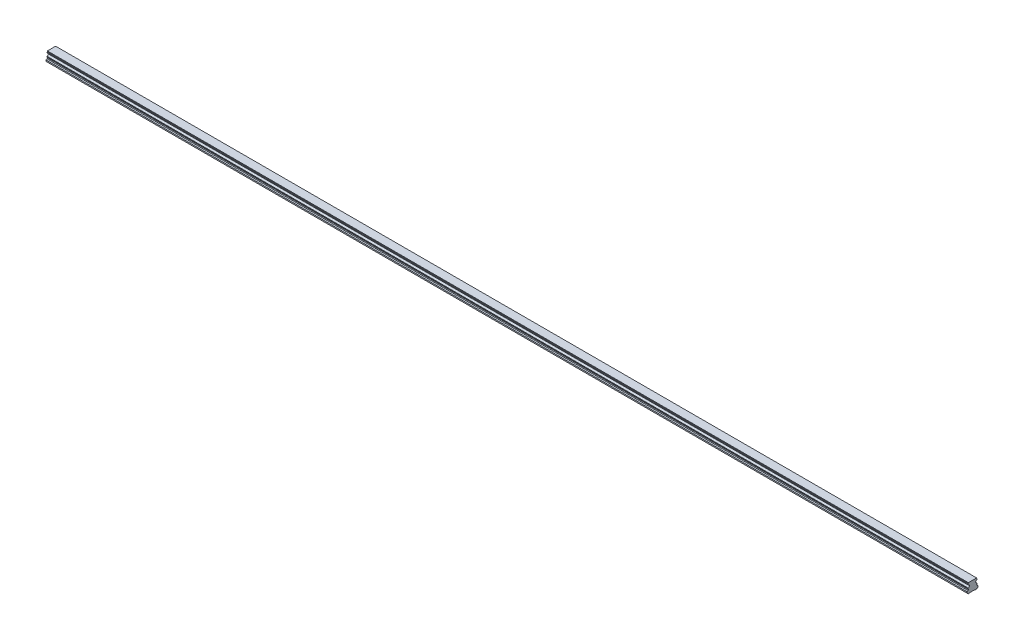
ISO-10303-21;
HEADER;
FILE_DESCRIPTION(('STEP AP214'),'2;1');
FILE_NAME('part.step','',(''),(''),'','','');
FILE_SCHEMA(('AUTOMOTIVE_DESIGN { 1 0 10303 214 1 1 1 1 }'));
ENDSEC;
DATA;
#1=APPLICATION_CONTEXT('core data for automotive mechanical design processes');
#2=APPLICATION_PROTOCOL_DEFINITION('international standard','automotive_design',2000,#1);
#3=PRODUCT_CONTEXT('',#1,'mechanical');
#4=PRODUCT('Part','Part','',(#3));
#5=PRODUCT_RELATED_PRODUCT_CATEGORY('part','',(#4));
#6=PRODUCT_DEFINITION_FORMATION('','',#4);
#7=PRODUCT_DEFINITION_CONTEXT('part definition',#1,'design');
#8=PRODUCT_DEFINITION('design','',#6,#7);
#9=PRODUCT_DEFINITION_SHAPE('','',#8);
#10=(LENGTH_UNIT() NAMED_UNIT(*) SI_UNIT(.MILLI.,.METRE.));
#11=(NAMED_UNIT(*) PLANE_ANGLE_UNIT() SI_UNIT($,.RADIAN.));
#12=(NAMED_UNIT(*) SI_UNIT($,.STERADIAN.) SOLID_ANGLE_UNIT());
#13=UNCERTAINTY_MEASURE_WITH_UNIT(LENGTH_MEASURE(1.E-05),#10,'distance_accuracy_value','');
#14=(GEOMETRIC_REPRESENTATION_CONTEXT(3) GLOBAL_UNCERTAINTY_ASSIGNED_CONTEXT((#13)) GLOBAL_UNIT_ASSIGNED_CONTEXT((#10,
#11,#12)) REPRESENTATION_CONTEXT('',''));
#15=CARTESIAN_POINT('',(0.,0.,0.));
#16=DIRECTION('',(0.,0.,1.));
#17=DIRECTION('',(1.,0.,0.));
#18=AXIS2_PLACEMENT_3D('',#15,#16,#17);
#19=CARTESIAN_POINT('',(2070.,0.499999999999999,0.));
#20=DIRECTION('',(0.,-1.,0.));
#21=DIRECTION('',(0.,0.,-1.));
#22=AXIS2_PLACEMENT_3D('',#19,#20,#21);
#23=CONICAL_SURFACE('',#22,3.5,0.785398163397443);
#24=CARTESIAN_POINT('',(2070.,1.00000000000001,0.));
#25=DIRECTION('',(0.,1.,0.));
#26=DIRECTION('',(0.,0.,1.));
#27=AXIS2_PLACEMENT_3D('',#24,#25,#26);
#28=CIRCLE('',#27,3.);
#29=CARTESIAN_POINT('',(2070.,1.00000000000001,3.));
#30=VERTEX_POINT('',#29);
#31=EDGE_CURVE('E11',#30,#30,#28,.F.);
#32=ORIENTED_EDGE('',*,*,#31,.F.);
#33=EDGE_LOOP('',(#32));
#34=FACE_BOUND('',#33,.T.);
#35=CARTESIAN_POINT('',(2070.,0.499999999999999,0.));
#36=DIRECTION('',(0.,1.,0.));
#37=DIRECTION('',(0.,0.,1.));
#38=AXIS2_PLACEMENT_3D('',#35,#36,#37);
#39=CIRCLE('',#38,3.5);
#40=CARTESIAN_POINT('',(2070.,0.5,3.5));
#41=VERTEX_POINT('',#40);
#42=EDGE_CURVE('E818',#41,#41,#39,.T.);
#43=ORIENTED_EDGE('',*,*,#42,.F.);
#44=EDGE_LOOP('',(#43));
#45=FACE_BOUND('',#44,.T.);
#46=ADVANCED_FACE('F39',(#34,#45),#23,.F.);
#47=CARTESIAN_POINT('',(2070.,12.,0.));
#48=DIRECTION('',(0.,-1.,0.));
#49=DIRECTION('',(0.,0.,-1.));
#50=AXIS2_PLACEMENT_3D('',#47,#48,#49);
#51=CYLINDRICAL_SURFACE('',#50,3.);
#52=ORIENTED_EDGE('',*,*,#31,.T.);
#53=EDGE_LOOP('',(#52));
#54=FACE_BOUND('',#53,.T.);
#55=CARTESIAN_POINT('',(2070.,12.,0.));
#56=DIRECTION('',(0.,-1.,0.));
#57=DIRECTION('',(0.,0.,-1.));
#58=AXIS2_PLACEMENT_3D('',#55,#56,#57);
#59=CIRCLE('',#58,3.);
#60=CARTESIAN_POINT('',(2070.,12.,-3.));
#61=VERTEX_POINT('',#60);
#62=EDGE_CURVE('E49',#61,#61,#59,.T.);
#63=ORIENTED_EDGE('',*,*,#62,.F.);
#64=EDGE_LOOP('',(#63));
#65=FACE_BOUND('',#64,.T.);
#66=ADVANCED_FACE('F1192',(#54,#65),#51,.F.);
#67=CARTESIAN_POINT('',(2070.,12.,0.));
#68=DIRECTION('',(0.,-1.,0.));
#69=DIRECTION('',(0.,0.,-1.));
#70=AXIS2_PLACEMENT_3D('',#67,#68,#69);
#71=PLANE('',#70);
#72=CARTESIAN_POINT('',(2070.,12.,0.));
#73=DIRECTION('',(0.,-1.,0.));
#74=DIRECTION('',(0.,0.,-1.));
#75=AXIS2_PLACEMENT_3D('',#72,#73,#74);
#76=CIRCLE('',#75,2.5);
#77=CARTESIAN_POINT('',(2070.,12.,-2.5));
#78=VERTEX_POINT('',#77);
#79=EDGE_CURVE('E42',#78,#78,#76,.T.);
#80=ORIENTED_EDGE('',*,*,#79,.F.);
#81=EDGE_LOOP('',(#80));
#82=FACE_BOUND('',#81,.T.);
#83=ORIENTED_EDGE('',*,*,#62,.T.);
#84=EDGE_LOOP('',(#83));
#85=FACE_BOUND('',#84,.T.);
#86=ADVANCED_FACE('F1197',(#82,#85),#71,.T.);
#87=CARTESIAN_POINT('',(2010.,0.499999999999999,0.));
#88=DIRECTION('',(0.,-1.,0.));
#89=DIRECTION('',(0.,0.,-1.));
#90=AXIS2_PLACEMENT_3D('',#87,#88,#89);
#91=CONICAL_SURFACE('',#90,3.5,0.785398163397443);
#92=CARTESIAN_POINT('',(2010.,1.00000000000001,0.));
#93=DIRECTION('',(0.,1.,0.));
#94=DIRECTION('',(0.,0.,1.));
#95=AXIS2_PLACEMENT_3D('',#92,#93,#94);
#96=CIRCLE('',#95,3.);
#97=CARTESIAN_POINT('',(2010.,1.00000000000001,3.));
#98=VERTEX_POINT('',#97);
#99=EDGE_CURVE('E814',#98,#98,#96,.F.);
#100=ORIENTED_EDGE('',*,*,#99,.F.);
#101=EDGE_LOOP('',(#100));
#102=FACE_BOUND('',#101,.T.);
#103=CARTESIAN_POINT('',(2010.,0.499999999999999,0.));
#104=DIRECTION('',(0.,1.,0.));
#105=DIRECTION('',(0.,0.,1.));
#106=AXIS2_PLACEMENT_3D('',#103,#104,#105);
#107=CIRCLE('',#106,3.5);
#108=CARTESIAN_POINT('',(2010.,0.5,3.5));
#109=VERTEX_POINT('',#108);
#110=EDGE_CURVE('E806',#109,#109,#107,.T.);
#111=ORIENTED_EDGE('',*,*,#110,.F.);
#112=EDGE_LOOP('',(#111));
#113=FACE_BOUND('',#112,.T.);
#114=ADVANCED_FACE('F1656',(#102,#113),#91,.F.);
#115=CARTESIAN_POINT('',(2010.,12.,0.));
#116=DIRECTION('',(0.,-1.,0.));
#117=DIRECTION('',(0.,0.,-1.));
#118=AXIS2_PLACEMENT_3D('',#115,#116,#117);
#119=CYLINDRICAL_SURFACE('',#118,3.);
#120=ORIENTED_EDGE('',*,*,#99,.T.);
#121=EDGE_LOOP('',(#120));
#122=FACE_BOUND('',#121,.T.);
#123=CARTESIAN_POINT('',(2010.,12.,0.));
#124=DIRECTION('',(0.,-1.,0.));
#125=DIRECTION('',(0.,0.,-1.));
#126=AXIS2_PLACEMENT_3D('',#123,#124,#125);
#127=CIRCLE('',#126,3.);
#128=CARTESIAN_POINT('',(2010.,12.,-3.));
#129=VERTEX_POINT('',#128);
#130=EDGE_CURVE('E810',#129,#129,#127,.T.);
#131=ORIENTED_EDGE('',*,*,#130,.F.);
#132=EDGE_LOOP('',(#131));
#133=FACE_BOUND('',#132,.T.);
#134=ADVANCED_FACE('F1652',(#122,#133),#119,.F.);
#135=CARTESIAN_POINT('',(2010.,12.,0.));
#136=DIRECTION('',(0.,-1.,0.));
#137=DIRECTION('',(0.,0.,-1.));
#138=AXIS2_PLACEMENT_3D('',#135,#136,#137);
#139=PLANE('',#138);
#140=CARTESIAN_POINT('',(2010.,12.,0.));
#141=DIRECTION('',(0.,-1.,0.));
#142=DIRECTION('',(0.,0.,-1.));
#143=AXIS2_PLACEMENT_3D('',#140,#141,#142);
#144=CIRCLE('',#143,2.5);
#145=CARTESIAN_POINT('',(2010.,12.,-2.5));
#146=VERTEX_POINT('',#145);
#147=EDGE_CURVE('E953',#146,#146,#144,.T.);
#148=ORIENTED_EDGE('',*,*,#147,.F.);
#149=EDGE_LOOP('',(#148));
#150=FACE_BOUND('',#149,.T.);
#151=ORIENTED_EDGE('',*,*,#130,.T.);
#152=EDGE_LOOP('',(#151));
#153=FACE_BOUND('',#152,.T.);
#154=ADVANCED_FACE('F1648',(#150,#153),#139,.T.);
#155=CARTESIAN_POINT('',(1950.,0.499999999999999,0.));
#156=DIRECTION('',(0.,-1.,0.));
#157=DIRECTION('',(0.,0.,-1.));
#158=AXIS2_PLACEMENT_3D('',#155,#156,#157);
#159=CONICAL_SURFACE('',#158,3.5,0.785398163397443);
#160=CARTESIAN_POINT('',(1950.,1.00000000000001,0.));
#161=DIRECTION('',(0.,1.,0.));
#162=DIRECTION('',(0.,0.,1.));
#163=AXIS2_PLACEMENT_3D('',#160,#161,#162);
#164=CIRCLE('',#163,3.);
#165=CARTESIAN_POINT('',(1950.,1.00000000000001,3.));
#166=VERTEX_POINT('',#165);
#167=EDGE_CURVE('E802',#166,#166,#164,.F.);
#168=ORIENTED_EDGE('',*,*,#167,.F.);
#169=EDGE_LOOP('',(#168));
#170=FACE_BOUND('',#169,.T.);
#171=CARTESIAN_POINT('',(1950.,0.499999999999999,0.));
#172=DIRECTION('',(0.,1.,0.));
#173=DIRECTION('',(0.,0.,1.));
#174=AXIS2_PLACEMENT_3D('',#171,#172,#173);
#175=CIRCLE('',#174,3.5);
#176=CARTESIAN_POINT('',(1950.,0.5,3.5));
#177=VERTEX_POINT('',#176);
#178=EDGE_CURVE('E794',#177,#177,#175,.T.);
#179=ORIENTED_EDGE('',*,*,#178,.F.);
#180=EDGE_LOOP('',(#179));
#181=FACE_BOUND('',#180,.T.);
#182=ADVANCED_FACE('F1644',(#170,#181),#159,.F.);
#183=CARTESIAN_POINT('',(1950.,12.,0.));
#184=DIRECTION('',(0.,-1.,0.));
#185=DIRECTION('',(0.,0.,-1.));
#186=AXIS2_PLACEMENT_3D('',#183,#184,#185);
#187=CYLINDRICAL_SURFACE('',#186,3.);
#188=ORIENTED_EDGE('',*,*,#167,.T.);
#189=EDGE_LOOP('',(#188));
#190=FACE_BOUND('',#189,.T.);
#191=CARTESIAN_POINT('',(1950.,12.,0.));
#192=DIRECTION('',(0.,-1.,0.));
#193=DIRECTION('',(0.,0.,-1.));
#194=AXIS2_PLACEMENT_3D('',#191,#192,#193);
#195=CIRCLE('',#194,3.);
#196=CARTESIAN_POINT('',(1950.,12.,-3.));
#197=VERTEX_POINT('',#196);
#198=EDGE_CURVE('E798',#197,#197,#195,.T.);
#199=ORIENTED_EDGE('',*,*,#198,.F.);
#200=EDGE_LOOP('',(#199));
#201=FACE_BOUND('',#200,.T.);
#202=ADVANCED_FACE('F1640',(#190,#201),#187,.F.);
#203=CARTESIAN_POINT('',(1950.,12.,0.));
#204=DIRECTION('',(0.,-1.,0.));
#205=DIRECTION('',(0.,0.,-1.));
#206=AXIS2_PLACEMENT_3D('',#203,#204,#205);
#207=PLANE('',#206);
#208=CARTESIAN_POINT('',(1950.,12.,0.));
#209=DIRECTION('',(0.,-1.,0.));
#210=DIRECTION('',(0.,0.,-1.));
#211=AXIS2_PLACEMENT_3D('',#208,#209,#210);
#212=CIRCLE('',#211,2.5);
#213=CARTESIAN_POINT('',(1950.,12.,-2.5));
#214=VERTEX_POINT('',#213);
#215=EDGE_CURVE('E950',#214,#214,#212,.T.);
#216=ORIENTED_EDGE('',*,*,#215,.F.);
#217=EDGE_LOOP('',(#216));
#218=FACE_BOUND('',#217,.T.);
#219=ORIENTED_EDGE('',*,*,#198,.T.);
#220=EDGE_LOOP('',(#219));
#221=FACE_BOUND('',#220,.T.);
#222=ADVANCED_FACE('F1636',(#218,#221),#207,.T.);
#223=CARTESIAN_POINT('',(1890.,0.499999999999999,0.));
#224=DIRECTION('',(0.,-1.,0.));
#225=DIRECTION('',(0.,0.,-1.));
#226=AXIS2_PLACEMENT_3D('',#223,#224,#225);
#227=CONICAL_SURFACE('',#226,3.5,0.785398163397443);
#228=CARTESIAN_POINT('',(1890.,1.00000000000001,0.));
#229=DIRECTION('',(0.,1.,0.));
#230=DIRECTION('',(0.,0.,1.));
#231=AXIS2_PLACEMENT_3D('',#228,#229,#230);
#232=CIRCLE('',#231,3.);
#233=CARTESIAN_POINT('',(1890.,1.00000000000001,3.));
#234=VERTEX_POINT('',#233);
#235=EDGE_CURVE('E790',#234,#234,#232,.F.);
#236=ORIENTED_EDGE('',*,*,#235,.F.);
#237=EDGE_LOOP('',(#236));
#238=FACE_BOUND('',#237,.T.);
#239=CARTESIAN_POINT('',(1890.,0.499999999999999,0.));
#240=DIRECTION('',(0.,1.,0.));
#241=DIRECTION('',(0.,0.,1.));
#242=AXIS2_PLACEMENT_3D('',#239,#240,#241);
#243=CIRCLE('',#242,3.5);
#244=CARTESIAN_POINT('',(1890.,0.5,3.5));
#245=VERTEX_POINT('',#244);
#246=EDGE_CURVE('E782',#245,#245,#243,.T.);
#247=ORIENTED_EDGE('',*,*,#246,.F.);
#248=EDGE_LOOP('',(#247));
#249=FACE_BOUND('',#248,.T.);
#250=ADVANCED_FACE('F1632',(#238,#249),#227,.F.);
#251=CARTESIAN_POINT('',(1890.,12.,0.));
#252=DIRECTION('',(0.,-1.,0.));
#253=DIRECTION('',(0.,0.,-1.));
#254=AXIS2_PLACEMENT_3D('',#251,#252,#253);
#255=CYLINDRICAL_SURFACE('',#254,3.);
#256=ORIENTED_EDGE('',*,*,#235,.T.);
#257=EDGE_LOOP('',(#256));
#258=FACE_BOUND('',#257,.T.);
#259=CARTESIAN_POINT('',(1890.,12.,0.));
#260=DIRECTION('',(0.,-1.,0.));
#261=DIRECTION('',(0.,0.,-1.));
#262=AXIS2_PLACEMENT_3D('',#259,#260,#261);
#263=CIRCLE('',#262,3.);
#264=CARTESIAN_POINT('',(1890.,12.,-3.));
#265=VERTEX_POINT('',#264);
#266=EDGE_CURVE('E786',#265,#265,#263,.T.);
#267=ORIENTED_EDGE('',*,*,#266,.F.);
#268=EDGE_LOOP('',(#267));
#269=FACE_BOUND('',#268,.T.);
#270=ADVANCED_FACE('F1628',(#258,#269),#255,.F.);
#271=CARTESIAN_POINT('',(1890.,12.,0.));
#272=DIRECTION('',(0.,-1.,0.));
#273=DIRECTION('',(0.,0.,-1.));
#274=AXIS2_PLACEMENT_3D('',#271,#272,#273);
#275=PLANE('',#274);
#276=CARTESIAN_POINT('',(1890.,12.,0.));
#277=DIRECTION('',(0.,-1.,0.));
#278=DIRECTION('',(0.,0.,-1.));
#279=AXIS2_PLACEMENT_3D('',#276,#277,#278);
#280=CIRCLE('',#279,2.5);
#281=CARTESIAN_POINT('',(1890.,12.,-2.5));
#282=VERTEX_POINT('',#281);
#283=EDGE_CURVE('E946',#282,#282,#280,.T.);
#284=ORIENTED_EDGE('',*,*,#283,.F.);
#285=EDGE_LOOP('',(#284));
#286=FACE_BOUND('',#285,.T.);
#287=ORIENTED_EDGE('',*,*,#266,.T.);
#288=EDGE_LOOP('',(#287));
#289=FACE_BOUND('',#288,.T.);
#290=ADVANCED_FACE('F1624',(#286,#289),#275,.T.);
#291=CARTESIAN_POINT('',(1830.,0.499999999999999,0.));
#292=DIRECTION('',(0.,-1.,0.));
#293=DIRECTION('',(0.,0.,-1.));
#294=AXIS2_PLACEMENT_3D('',#291,#292,#293);
#295=CONICAL_SURFACE('',#294,3.5,0.785398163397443);
#296=CARTESIAN_POINT('',(1830.,1.00000000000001,0.));
#297=DIRECTION('',(0.,1.,0.));
#298=DIRECTION('',(0.,0.,1.));
#299=AXIS2_PLACEMENT_3D('',#296,#297,#298);
#300=CIRCLE('',#299,3.);
#301=CARTESIAN_POINT('',(1830.,1.00000000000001,3.));
#302=VERTEX_POINT('',#301);
#303=EDGE_CURVE('E778',#302,#302,#300,.F.);
#304=ORIENTED_EDGE('',*,*,#303,.F.);
#305=EDGE_LOOP('',(#304));
#306=FACE_BOUND('',#305,.T.);
#307=CARTESIAN_POINT('',(1830.,0.499999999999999,0.));
#308=DIRECTION('',(0.,1.,0.));
#309=DIRECTION('',(0.,0.,1.));
#310=AXIS2_PLACEMENT_3D('',#307,#308,#309);
#311=CIRCLE('',#310,3.5);
#312=CARTESIAN_POINT('',(1830.,0.5,3.5));
#313=VERTEX_POINT('',#312);
#314=EDGE_CURVE('E770',#313,#313,#311,.T.);
#315=ORIENTED_EDGE('',*,*,#314,.F.);
#316=EDGE_LOOP('',(#315));
#317=FACE_BOUND('',#316,.T.);
#318=ADVANCED_FACE('F1620',(#306,#317),#295,.F.);
#319=CARTESIAN_POINT('',(1830.,12.,0.));
#320=DIRECTION('',(0.,-1.,0.));
#321=DIRECTION('',(0.,0.,-1.));
#322=AXIS2_PLACEMENT_3D('',#319,#320,#321);
#323=CYLINDRICAL_SURFACE('',#322,3.);
#324=ORIENTED_EDGE('',*,*,#303,.T.);
#325=EDGE_LOOP('',(#324));
#326=FACE_BOUND('',#325,.T.);
#327=CARTESIAN_POINT('',(1830.,12.,0.));
#328=DIRECTION('',(0.,-1.,0.));
#329=DIRECTION('',(0.,0.,-1.));
#330=AXIS2_PLACEMENT_3D('',#327,#328,#329);
#331=CIRCLE('',#330,3.);
#332=CARTESIAN_POINT('',(1830.,12.,-3.));
#333=VERTEX_POINT('',#332);
#334=EDGE_CURVE('E774',#333,#333,#331,.T.);
#335=ORIENTED_EDGE('',*,*,#334,.F.);
#336=EDGE_LOOP('',(#335));
#337=FACE_BOUND('',#336,.T.);
#338=ADVANCED_FACE('F1616',(#326,#337),#323,.F.);
#339=CARTESIAN_POINT('',(1830.,12.,0.));
#340=DIRECTION('',(0.,-1.,0.));
#341=DIRECTION('',(0.,0.,-1.));
#342=AXIS2_PLACEMENT_3D('',#339,#340,#341);
#343=PLANE('',#342);
#344=CARTESIAN_POINT('',(1830.,12.,0.));
#345=DIRECTION('',(0.,-1.,0.));
#346=DIRECTION('',(0.,0.,-1.));
#347=AXIS2_PLACEMENT_3D('',#344,#345,#346);
#348=CIRCLE('',#347,2.5);
#349=CARTESIAN_POINT('',(1830.,12.,-2.5));
#350=VERTEX_POINT('',#349);
#351=EDGE_CURVE('E942',#350,#350,#348,.T.);
#352=ORIENTED_EDGE('',*,*,#351,.F.);
#353=EDGE_LOOP('',(#352));
#354=FACE_BOUND('',#353,.T.);
#355=ORIENTED_EDGE('',*,*,#334,.T.);
#356=EDGE_LOOP('',(#355));
#357=FACE_BOUND('',#356,.T.);
#358=ADVANCED_FACE('F1612',(#354,#357),#343,.T.);
#359=CARTESIAN_POINT('',(1770.,0.499999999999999,0.));
#360=DIRECTION('',(0.,-1.,0.));
#361=DIRECTION('',(0.,0.,-1.));
#362=AXIS2_PLACEMENT_3D('',#359,#360,#361);
#363=CONICAL_SURFACE('',#362,3.5,0.785398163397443);
#364=CARTESIAN_POINT('',(1770.,1.00000000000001,0.));
#365=DIRECTION('',(0.,1.,0.));
#366=DIRECTION('',(0.,0.,1.));
#367=AXIS2_PLACEMENT_3D('',#364,#365,#366);
#368=CIRCLE('',#367,3.);
#369=CARTESIAN_POINT('',(1770.,1.00000000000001,3.));
#370=VERTEX_POINT('',#369);
#371=EDGE_CURVE('E766',#370,#370,#368,.F.);
#372=ORIENTED_EDGE('',*,*,#371,.F.);
#373=EDGE_LOOP('',(#372));
#374=FACE_BOUND('',#373,.T.);
#375=CARTESIAN_POINT('',(1770.,0.499999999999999,0.));
#376=DIRECTION('',(0.,1.,0.));
#377=DIRECTION('',(0.,0.,1.));
#378=AXIS2_PLACEMENT_3D('',#375,#376,#377);
#379=CIRCLE('',#378,3.5);
#380=CARTESIAN_POINT('',(1770.,0.5,3.5));
#381=VERTEX_POINT('',#380);
#382=EDGE_CURVE('E758',#381,#381,#379,.T.);
#383=ORIENTED_EDGE('',*,*,#382,.F.);
#384=EDGE_LOOP('',(#383));
#385=FACE_BOUND('',#384,.T.);
#386=ADVANCED_FACE('F1608',(#374,#385),#363,.F.);
#387=CARTESIAN_POINT('',(1770.,12.,0.));
#388=DIRECTION('',(0.,-1.,0.));
#389=DIRECTION('',(0.,0.,-1.));
#390=AXIS2_PLACEMENT_3D('',#387,#388,#389);
#391=CYLINDRICAL_SURFACE('',#390,3.);
#392=ORIENTED_EDGE('',*,*,#371,.T.);
#393=EDGE_LOOP('',(#392));
#394=FACE_BOUND('',#393,.T.);
#395=CARTESIAN_POINT('',(1770.,12.,0.));
#396=DIRECTION('',(0.,-1.,0.));
#397=DIRECTION('',(0.,0.,-1.));
#398=AXIS2_PLACEMENT_3D('',#395,#396,#397);
#399=CIRCLE('',#398,3.);
#400=CARTESIAN_POINT('',(1770.,12.,-3.));
#401=VERTEX_POINT('',#400);
#402=EDGE_CURVE('E762',#401,#401,#399,.T.);
#403=ORIENTED_EDGE('',*,*,#402,.F.);
#404=EDGE_LOOP('',(#403));
#405=FACE_BOUND('',#404,.T.);
#406=ADVANCED_FACE('F1604',(#394,#405),#391,.F.);
#407=CARTESIAN_POINT('',(1770.,12.,0.));
#408=DIRECTION('',(0.,-1.,0.));
#409=DIRECTION('',(0.,0.,-1.));
#410=AXIS2_PLACEMENT_3D('',#407,#408,#409);
#411=PLANE('',#410);
#412=CARTESIAN_POINT('',(1770.,12.,0.));
#413=DIRECTION('',(0.,-1.,0.));
#414=DIRECTION('',(0.,0.,-1.));
#415=AXIS2_PLACEMENT_3D('',#412,#413,#414);
#416=CIRCLE('',#415,2.5);
#417=CARTESIAN_POINT('',(1770.,12.,-2.5));
#418=VERTEX_POINT('',#417);
#419=EDGE_CURVE('E938',#418,#418,#416,.T.);
#420=ORIENTED_EDGE('',*,*,#419,.F.);
#421=EDGE_LOOP('',(#420));
#422=FACE_BOUND('',#421,.T.);
#423=ORIENTED_EDGE('',*,*,#402,.T.);
#424=EDGE_LOOP('',(#423));
#425=FACE_BOUND('',#424,.T.);
#426=ADVANCED_FACE('F1600',(#422,#425),#411,.T.);
#427=CARTESIAN_POINT('',(1710.,0.499999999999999,0.));
#428=DIRECTION('',(0.,-1.,0.));
#429=DIRECTION('',(0.,0.,-1.));
#430=AXIS2_PLACEMENT_3D('',#427,#428,#429);
#431=CONICAL_SURFACE('',#430,3.5,0.785398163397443);
#432=CARTESIAN_POINT('',(1710.,1.00000000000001,0.));
#433=DIRECTION('',(0.,1.,0.));
#434=DIRECTION('',(0.,0.,1.));
#435=AXIS2_PLACEMENT_3D('',#432,#433,#434);
#436=CIRCLE('',#435,3.);
#437=CARTESIAN_POINT('',(1710.,1.00000000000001,3.));
#438=VERTEX_POINT('',#437);
#439=EDGE_CURVE('E754',#438,#438,#436,.F.);
#440=ORIENTED_EDGE('',*,*,#439,.F.);
#441=EDGE_LOOP('',(#440));
#442=FACE_BOUND('',#441,.T.);
#443=CARTESIAN_POINT('',(1710.,0.499999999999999,0.));
#444=DIRECTION('',(0.,1.,0.));
#445=DIRECTION('',(0.,0.,1.));
#446=AXIS2_PLACEMENT_3D('',#443,#444,#445);
#447=CIRCLE('',#446,3.5);
#448=CARTESIAN_POINT('',(1710.,0.5,3.5));
#449=VERTEX_POINT('',#448);
#450=EDGE_CURVE('E746',#449,#449,#447,.T.);
#451=ORIENTED_EDGE('',*,*,#450,.F.);
#452=EDGE_LOOP('',(#451));
#453=FACE_BOUND('',#452,.T.);
#454=ADVANCED_FACE('F1596',(#442,#453),#431,.F.);
#455=CARTESIAN_POINT('',(1710.,12.,0.));
#456=DIRECTION('',(0.,-1.,0.));
#457=DIRECTION('',(0.,0.,-1.));
#458=AXIS2_PLACEMENT_3D('',#455,#456,#457);
#459=CYLINDRICAL_SURFACE('',#458,3.);
#460=ORIENTED_EDGE('',*,*,#439,.T.);
#461=EDGE_LOOP('',(#460));
#462=FACE_BOUND('',#461,.T.);
#463=CARTESIAN_POINT('',(1710.,12.,0.));
#464=DIRECTION('',(0.,-1.,0.));
#465=DIRECTION('',(0.,0.,-1.));
#466=AXIS2_PLACEMENT_3D('',#463,#464,#465);
#467=CIRCLE('',#466,3.);
#468=CARTESIAN_POINT('',(1710.,12.,-3.));
#469=VERTEX_POINT('',#468);
#470=EDGE_CURVE('E750',#469,#469,#467,.T.);
#471=ORIENTED_EDGE('',*,*,#470,.F.);
#472=EDGE_LOOP('',(#471));
#473=FACE_BOUND('',#472,.T.);
#474=ADVANCED_FACE('F1592',(#462,#473),#459,.F.);
#475=CARTESIAN_POINT('',(1710.,12.,0.));
#476=DIRECTION('',(0.,-1.,0.));
#477=DIRECTION('',(0.,0.,-1.));
#478=AXIS2_PLACEMENT_3D('',#475,#476,#477);
#479=PLANE('',#478);
#480=CARTESIAN_POINT('',(1710.,12.,0.));
#481=DIRECTION('',(0.,-1.,0.));
#482=DIRECTION('',(0.,0.,-1.));
#483=AXIS2_PLACEMENT_3D('',#480,#481,#482);
#484=CIRCLE('',#483,2.5);
#485=CARTESIAN_POINT('',(1710.,12.,-2.5));
#486=VERTEX_POINT('',#485);
#487=EDGE_CURVE('E934',#486,#486,#484,.T.);
#488=ORIENTED_EDGE('',*,*,#487,.F.);
#489=EDGE_LOOP('',(#488));
#490=FACE_BOUND('',#489,.T.);
#491=ORIENTED_EDGE('',*,*,#470,.T.);
#492=EDGE_LOOP('',(#491));
#493=FACE_BOUND('',#492,.T.);
#494=ADVANCED_FACE('F1588',(#490,#493),#479,.T.);
#495=CARTESIAN_POINT('',(1650.,0.499999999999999,0.));
#496=DIRECTION('',(0.,-1.,0.));
#497=DIRECTION('',(0.,0.,-1.));
#498=AXIS2_PLACEMENT_3D('',#495,#496,#497);
#499=CONICAL_SURFACE('',#498,3.5,0.785398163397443);
#500=CARTESIAN_POINT('',(1650.,1.00000000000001,0.));
#501=DIRECTION('',(0.,1.,0.));
#502=DIRECTION('',(0.,0.,1.));
#503=AXIS2_PLACEMENT_3D('',#500,#501,#502);
#504=CIRCLE('',#503,3.);
#505=CARTESIAN_POINT('',(1650.,1.00000000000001,3.));
#506=VERTEX_POINT('',#505);
#507=EDGE_CURVE('E742',#506,#506,#504,.F.);
#508=ORIENTED_EDGE('',*,*,#507,.F.);
#509=EDGE_LOOP('',(#508));
#510=FACE_BOUND('',#509,.T.);
#511=CARTESIAN_POINT('',(1650.,0.499999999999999,0.));
#512=DIRECTION('',(0.,1.,0.));
#513=DIRECTION('',(0.,0.,1.));
#514=AXIS2_PLACEMENT_3D('',#511,#512,#513);
#515=CIRCLE('',#514,3.5);
#516=CARTESIAN_POINT('',(1650.,0.5,3.5));
#517=VERTEX_POINT('',#516);
#518=EDGE_CURVE('E734',#517,#517,#515,.T.);
#519=ORIENTED_EDGE('',*,*,#518,.F.);
#520=EDGE_LOOP('',(#519));
#521=FACE_BOUND('',#520,.T.);
#522=ADVANCED_FACE('F1584',(#510,#521),#499,.F.);
#523=CARTESIAN_POINT('',(1650.,12.,0.));
#524=DIRECTION('',(0.,-1.,0.));
#525=DIRECTION('',(0.,0.,-1.));
#526=AXIS2_PLACEMENT_3D('',#523,#524,#525);
#527=CYLINDRICAL_SURFACE('',#526,3.);
#528=ORIENTED_EDGE('',*,*,#507,.T.);
#529=EDGE_LOOP('',(#528));
#530=FACE_BOUND('',#529,.T.);
#531=CARTESIAN_POINT('',(1650.,12.,0.));
#532=DIRECTION('',(0.,-1.,0.));
#533=DIRECTION('',(0.,0.,-1.));
#534=AXIS2_PLACEMENT_3D('',#531,#532,#533);
#535=CIRCLE('',#534,3.);
#536=CARTESIAN_POINT('',(1650.,12.,-3.));
#537=VERTEX_POINT('',#536);
#538=EDGE_CURVE('E738',#537,#537,#535,.T.);
#539=ORIENTED_EDGE('',*,*,#538,.F.);
#540=EDGE_LOOP('',(#539));
#541=FACE_BOUND('',#540,.T.);
#542=ADVANCED_FACE('F1580',(#530,#541),#527,.F.);
#543=CARTESIAN_POINT('',(1650.,12.,0.));
#544=DIRECTION('',(0.,-1.,0.));
#545=DIRECTION('',(0.,0.,-1.));
#546=AXIS2_PLACEMENT_3D('',#543,#544,#545);
#547=PLANE('',#546);
#548=CARTESIAN_POINT('',(1650.,12.,0.));
#549=DIRECTION('',(0.,-1.,0.));
#550=DIRECTION('',(0.,0.,-1.));
#551=AXIS2_PLACEMENT_3D('',#548,#549,#550);
#552=CIRCLE('',#551,2.5);
#553=CARTESIAN_POINT('',(1650.,12.,-2.5));
#554=VERTEX_POINT('',#553);
#555=EDGE_CURVE('E930',#554,#554,#552,.T.);
#556=ORIENTED_EDGE('',*,*,#555,.F.);
#557=EDGE_LOOP('',(#556));
#558=FACE_BOUND('',#557,.T.);
#559=ORIENTED_EDGE('',*,*,#538,.T.);
#560=EDGE_LOOP('',(#559));
#561=FACE_BOUND('',#560,.T.);
#562=ADVANCED_FACE('F1576',(#558,#561),#547,.T.);
#563=CARTESIAN_POINT('',(1590.,0.499999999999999,0.));
#564=DIRECTION('',(0.,-1.,0.));
#565=DIRECTION('',(0.,0.,-1.));
#566=AXIS2_PLACEMENT_3D('',#563,#564,#565);
#567=CONICAL_SURFACE('',#566,3.5,0.785398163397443);
#568=CARTESIAN_POINT('',(1590.,1.00000000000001,0.));
#569=DIRECTION('',(0.,1.,0.));
#570=DIRECTION('',(0.,0.,1.));
#571=AXIS2_PLACEMENT_3D('',#568,#569,#570);
#572=CIRCLE('',#571,3.);
#573=CARTESIAN_POINT('',(1590.,1.00000000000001,3.));
#574=VERTEX_POINT('',#573);
#575=EDGE_CURVE('E730',#574,#574,#572,.F.);
#576=ORIENTED_EDGE('',*,*,#575,.F.);
#577=EDGE_LOOP('',(#576));
#578=FACE_BOUND('',#577,.T.);
#579=CARTESIAN_POINT('',(1590.,0.499999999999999,0.));
#580=DIRECTION('',(0.,1.,0.));
#581=DIRECTION('',(0.,0.,1.));
#582=AXIS2_PLACEMENT_3D('',#579,#580,#581);
#583=CIRCLE('',#582,3.5);
#584=CARTESIAN_POINT('',(1590.,0.5,3.5));
#585=VERTEX_POINT('',#584);
#586=EDGE_CURVE('E722',#585,#585,#583,.T.);
#587=ORIENTED_EDGE('',*,*,#586,.F.);
#588=EDGE_LOOP('',(#587));
#589=FACE_BOUND('',#588,.T.);
#590=ADVANCED_FACE('F1572',(#578,#589),#567,.F.);
#591=CARTESIAN_POINT('',(1590.,12.,0.));
#592=DIRECTION('',(0.,-1.,0.));
#593=DIRECTION('',(0.,0.,-1.));
#594=AXIS2_PLACEMENT_3D('',#591,#592,#593);
#595=CYLINDRICAL_SURFACE('',#594,3.);
#596=ORIENTED_EDGE('',*,*,#575,.T.);
#597=EDGE_LOOP('',(#596));
#598=FACE_BOUND('',#597,.T.);
#599=CARTESIAN_POINT('',(1590.,12.,0.));
#600=DIRECTION('',(0.,-1.,0.));
#601=DIRECTION('',(0.,0.,-1.));
#602=AXIS2_PLACEMENT_3D('',#599,#600,#601);
#603=CIRCLE('',#602,3.);
#604=CARTESIAN_POINT('',(1590.,12.,-3.));
#605=VERTEX_POINT('',#604);
#606=EDGE_CURVE('E726',#605,#605,#603,.T.);
#607=ORIENTED_EDGE('',*,*,#606,.F.);
#608=EDGE_LOOP('',(#607));
#609=FACE_BOUND('',#608,.T.);
#610=ADVANCED_FACE('F1568',(#598,#609),#595,.F.);
#611=CARTESIAN_POINT('',(1590.,12.,0.));
#612=DIRECTION('',(0.,-1.,0.));
#613=DIRECTION('',(0.,0.,-1.));
#614=AXIS2_PLACEMENT_3D('',#611,#612,#613);
#615=PLANE('',#614);
#616=CARTESIAN_POINT('',(1590.,12.,0.));
#617=DIRECTION('',(0.,-1.,0.));
#618=DIRECTION('',(0.,0.,-1.));
#619=AXIS2_PLACEMENT_3D('',#616,#617,#618);
#620=CIRCLE('',#619,2.5);
#621=CARTESIAN_POINT('',(1590.,12.,-2.5));
#622=VERTEX_POINT('',#621);
#623=EDGE_CURVE('E926',#622,#622,#620,.T.);
#624=ORIENTED_EDGE('',*,*,#623,.F.);
#625=EDGE_LOOP('',(#624));
#626=FACE_BOUND('',#625,.T.);
#627=ORIENTED_EDGE('',*,*,#606,.T.);
#628=EDGE_LOOP('',(#627));
#629=FACE_BOUND('',#628,.T.);
#630=ADVANCED_FACE('F1564',(#626,#629),#615,.T.);
#631=CARTESIAN_POINT('',(1530.,0.499999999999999,0.));
#632=DIRECTION('',(0.,-1.,0.));
#633=DIRECTION('',(0.,0.,-1.));
#634=AXIS2_PLACEMENT_3D('',#631,#632,#633);
#635=CONICAL_SURFACE('',#634,3.5,0.785398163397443);
#636=CARTESIAN_POINT('',(1530.,1.00000000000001,0.));
#637=DIRECTION('',(0.,1.,0.));
#638=DIRECTION('',(0.,0.,1.));
#639=AXIS2_PLACEMENT_3D('',#636,#637,#638);
#640=CIRCLE('',#639,3.);
#641=CARTESIAN_POINT('',(1530.,1.00000000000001,3.));
#642=VERTEX_POINT('',#641);
#643=EDGE_CURVE('E718',#642,#642,#640,.F.);
#644=ORIENTED_EDGE('',*,*,#643,.F.);
#645=EDGE_LOOP('',(#644));
#646=FACE_BOUND('',#645,.T.);
#647=CARTESIAN_POINT('',(1530.,0.499999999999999,0.));
#648=DIRECTION('',(0.,1.,0.));
#649=DIRECTION('',(0.,0.,1.));
#650=AXIS2_PLACEMENT_3D('',#647,#648,#649);
#651=CIRCLE('',#650,3.5);
#652=CARTESIAN_POINT('',(1530.,0.5,3.5));
#653=VERTEX_POINT('',#652);
#654=EDGE_CURVE('E710',#653,#653,#651,.T.);
#655=ORIENTED_EDGE('',*,*,#654,.F.);
#656=EDGE_LOOP('',(#655));
#657=FACE_BOUND('',#656,.T.);
#658=ADVANCED_FACE('F1560',(#646,#657),#635,.F.);
#659=CARTESIAN_POINT('',(1530.,12.,0.));
#660=DIRECTION('',(0.,-1.,0.));
#661=DIRECTION('',(0.,0.,-1.));
#662=AXIS2_PLACEMENT_3D('',#659,#660,#661);
#663=CYLINDRICAL_SURFACE('',#662,3.);
#664=ORIENTED_EDGE('',*,*,#643,.T.);
#665=EDGE_LOOP('',(#664));
#666=FACE_BOUND('',#665,.T.);
#667=CARTESIAN_POINT('',(1530.,12.,0.));
#668=DIRECTION('',(0.,-1.,0.));
#669=DIRECTION('',(0.,0.,-1.));
#670=AXIS2_PLACEMENT_3D('',#667,#668,#669);
#671=CIRCLE('',#670,3.);
#672=CARTESIAN_POINT('',(1530.,12.,-3.));
#673=VERTEX_POINT('',#672);
#674=EDGE_CURVE('E714',#673,#673,#671,.T.);
#675=ORIENTED_EDGE('',*,*,#674,.F.);
#676=EDGE_LOOP('',(#675));
#677=FACE_BOUND('',#676,.T.);
#678=ADVANCED_FACE('F1556',(#666,#677),#663,.F.);
#679=CARTESIAN_POINT('',(1530.,12.,0.));
#680=DIRECTION('',(0.,-1.,0.));
#681=DIRECTION('',(0.,0.,-1.));
#682=AXIS2_PLACEMENT_3D('',#679,#680,#681);
#683=PLANE('',#682);
#684=CARTESIAN_POINT('',(1530.,12.,0.));
#685=DIRECTION('',(0.,-1.,0.));
#686=DIRECTION('',(0.,0.,-1.));
#687=AXIS2_PLACEMENT_3D('',#684,#685,#686);
#688=CIRCLE('',#687,2.5);
#689=CARTESIAN_POINT('',(1530.,12.,-2.5));
#690=VERTEX_POINT('',#689);
#691=EDGE_CURVE('E922',#690,#690,#688,.T.);
#692=ORIENTED_EDGE('',*,*,#691,.F.);
#693=EDGE_LOOP('',(#692));
#694=FACE_BOUND('',#693,.T.);
#695=ORIENTED_EDGE('',*,*,#674,.T.);
#696=EDGE_LOOP('',(#695));
#697=FACE_BOUND('',#696,.T.);
#698=ADVANCED_FACE('F1552',(#694,#697),#683,.T.);
#699=CARTESIAN_POINT('',(1470.,0.499999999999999,0.));
#700=DIRECTION('',(0.,-1.,0.));
#701=DIRECTION('',(0.,0.,-1.));
#702=AXIS2_PLACEMENT_3D('',#699,#700,#701);
#703=CONICAL_SURFACE('',#702,3.5,0.785398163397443);
#704=CARTESIAN_POINT('',(1470.,1.00000000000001,0.));
#705=DIRECTION('',(0.,1.,0.));
#706=DIRECTION('',(0.,0.,1.));
#707=AXIS2_PLACEMENT_3D('',#704,#705,#706);
#708=CIRCLE('',#707,3.);
#709=CARTESIAN_POINT('',(1470.,1.00000000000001,3.));
#710=VERTEX_POINT('',#709);
#711=EDGE_CURVE('E706',#710,#710,#708,.F.);
#712=ORIENTED_EDGE('',*,*,#711,.F.);
#713=EDGE_LOOP('',(#712));
#714=FACE_BOUND('',#713,.T.);
#715=CARTESIAN_POINT('',(1470.,0.499999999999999,0.));
#716=DIRECTION('',(0.,1.,0.));
#717=DIRECTION('',(0.,0.,1.));
#718=AXIS2_PLACEMENT_3D('',#715,#716,#717);
#719=CIRCLE('',#718,3.5);
#720=CARTESIAN_POINT('',(1470.,0.5,3.5));
#721=VERTEX_POINT('',#720);
#722=EDGE_CURVE('E698',#721,#721,#719,.T.);
#723=ORIENTED_EDGE('',*,*,#722,.F.);
#724=EDGE_LOOP('',(#723));
#725=FACE_BOUND('',#724,.T.);
#726=ADVANCED_FACE('F1548',(#714,#725),#703,.F.);
#727=CARTESIAN_POINT('',(1470.,12.,0.));
#728=DIRECTION('',(0.,-1.,0.));
#729=DIRECTION('',(0.,0.,-1.));
#730=AXIS2_PLACEMENT_3D('',#727,#728,#729);
#731=CYLINDRICAL_SURFACE('',#730,3.);
#732=ORIENTED_EDGE('',*,*,#711,.T.);
#733=EDGE_LOOP('',(#732));
#734=FACE_BOUND('',#733,.T.);
#735=CARTESIAN_POINT('',(1470.,12.,0.));
#736=DIRECTION('',(0.,-1.,0.));
#737=DIRECTION('',(0.,0.,-1.));
#738=AXIS2_PLACEMENT_3D('',#735,#736,#737);
#739=CIRCLE('',#738,3.);
#740=CARTESIAN_POINT('',(1470.,12.,-3.));
#741=VERTEX_POINT('',#740);
#742=EDGE_CURVE('E702',#741,#741,#739,.T.);
#743=ORIENTED_EDGE('',*,*,#742,.F.);
#744=EDGE_LOOP('',(#743));
#745=FACE_BOUND('',#744,.T.);
#746=ADVANCED_FACE('F1544',(#734,#745),#731,.F.);
#747=CARTESIAN_POINT('',(1470.,12.,0.));
#748=DIRECTION('',(0.,-1.,0.));
#749=DIRECTION('',(0.,0.,-1.));
#750=AXIS2_PLACEMENT_3D('',#747,#748,#749);
#751=PLANE('',#750);
#752=CARTESIAN_POINT('',(1470.,12.,0.));
#753=DIRECTION('',(0.,-1.,0.));
#754=DIRECTION('',(0.,0.,-1.));
#755=AXIS2_PLACEMENT_3D('',#752,#753,#754);
#756=CIRCLE('',#755,2.5);
#757=CARTESIAN_POINT('',(1470.,12.,-2.5));
#758=VERTEX_POINT('',#757);
#759=EDGE_CURVE('E918',#758,#758,#756,.T.);
#760=ORIENTED_EDGE('',*,*,#759,.F.);
#761=EDGE_LOOP('',(#760));
#762=FACE_BOUND('',#761,.T.);
#763=ORIENTED_EDGE('',*,*,#742,.T.);
#764=EDGE_LOOP('',(#763));
#765=FACE_BOUND('',#764,.T.);
#766=ADVANCED_FACE('F1540',(#762,#765),#751,.T.);
#767=CARTESIAN_POINT('',(1410.,0.499999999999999,0.));
#768=DIRECTION('',(0.,-1.,0.));
#769=DIRECTION('',(0.,0.,-1.));
#770=AXIS2_PLACEMENT_3D('',#767,#768,#769);
#771=CONICAL_SURFACE('',#770,3.5,0.785398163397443);
#772=CARTESIAN_POINT('',(1410.,1.00000000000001,0.));
#773=DIRECTION('',(0.,1.,0.));
#774=DIRECTION('',(0.,0.,1.));
#775=AXIS2_PLACEMENT_3D('',#772,#773,#774);
#776=CIRCLE('',#775,3.);
#777=CARTESIAN_POINT('',(1410.,1.00000000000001,3.));
#778=VERTEX_POINT('',#777);
#779=EDGE_CURVE('E694',#778,#778,#776,.F.);
#780=ORIENTED_EDGE('',*,*,#779,.F.);
#781=EDGE_LOOP('',(#780));
#782=FACE_BOUND('',#781,.T.);
#783=CARTESIAN_POINT('',(1410.,0.499999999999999,0.));
#784=DIRECTION('',(0.,1.,0.));
#785=DIRECTION('',(0.,0.,1.));
#786=AXIS2_PLACEMENT_3D('',#783,#784,#785);
#787=CIRCLE('',#786,3.5);
#788=CARTESIAN_POINT('',(1410.,0.5,3.5));
#789=VERTEX_POINT('',#788);
#790=EDGE_CURVE('E686',#789,#789,#787,.T.);
#791=ORIENTED_EDGE('',*,*,#790,.F.);
#792=EDGE_LOOP('',(#791));
#793=FACE_BOUND('',#792,.T.);
#794=ADVANCED_FACE('F1536',(#782,#793),#771,.F.);
#795=CARTESIAN_POINT('',(1410.,12.,0.));
#796=DIRECTION('',(0.,-1.,0.));
#797=DIRECTION('',(0.,0.,-1.));
#798=AXIS2_PLACEMENT_3D('',#795,#796,#797);
#799=CYLINDRICAL_SURFACE('',#798,3.);
#800=ORIENTED_EDGE('',*,*,#779,.T.);
#801=EDGE_LOOP('',(#800));
#802=FACE_BOUND('',#801,.T.);
#803=CARTESIAN_POINT('',(1410.,12.,0.));
#804=DIRECTION('',(0.,-1.,0.));
#805=DIRECTION('',(0.,0.,-1.));
#806=AXIS2_PLACEMENT_3D('',#803,#804,#805);
#807=CIRCLE('',#806,3.);
#808=CARTESIAN_POINT('',(1410.,12.,-3.));
#809=VERTEX_POINT('',#808);
#810=EDGE_CURVE('E690',#809,#809,#807,.T.);
#811=ORIENTED_EDGE('',*,*,#810,.F.);
#812=EDGE_LOOP('',(#811));
#813=FACE_BOUND('',#812,.T.);
#814=ADVANCED_FACE('F1532',(#802,#813),#799,.F.);
#815=CARTESIAN_POINT('',(1410.,12.,0.));
#816=DIRECTION('',(0.,-1.,0.));
#817=DIRECTION('',(0.,0.,-1.));
#818=AXIS2_PLACEMENT_3D('',#815,#816,#817);
#819=PLANE('',#818);
#820=CARTESIAN_POINT('',(1410.,12.,0.));
#821=DIRECTION('',(0.,-1.,0.));
#822=DIRECTION('',(0.,0.,-1.));
#823=AXIS2_PLACEMENT_3D('',#820,#821,#822);
#824=CIRCLE('',#823,2.5);
#825=CARTESIAN_POINT('',(1410.,12.,-2.5));
#826=VERTEX_POINT('',#825);
#827=EDGE_CURVE('E914',#826,#826,#824,.T.);
#828=ORIENTED_EDGE('',*,*,#827,.F.);
#829=EDGE_LOOP('',(#828));
#830=FACE_BOUND('',#829,.T.);
#831=ORIENTED_EDGE('',*,*,#810,.T.);
#832=EDGE_LOOP('',(#831));
#833=FACE_BOUND('',#832,.T.);
#834=ADVANCED_FACE('F1528',(#830,#833),#819,.T.);
#835=CARTESIAN_POINT('',(1350.,0.499999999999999,0.));
#836=DIRECTION('',(0.,-1.,0.));
#837=DIRECTION('',(0.,0.,-1.));
#838=AXIS2_PLACEMENT_3D('',#835,#836,#837);
#839=CONICAL_SURFACE('',#838,3.5,0.785398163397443);
#840=CARTESIAN_POINT('',(1350.,1.00000000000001,0.));
#841=DIRECTION('',(0.,1.,0.));
#842=DIRECTION('',(0.,0.,1.));
#843=AXIS2_PLACEMENT_3D('',#840,#841,#842);
#844=CIRCLE('',#843,3.);
#845=CARTESIAN_POINT('',(1350.,1.00000000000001,3.));
#846=VERTEX_POINT('',#845);
#847=EDGE_CURVE('E682',#846,#846,#844,.F.);
#848=ORIENTED_EDGE('',*,*,#847,.F.);
#849=EDGE_LOOP('',(#848));
#850=FACE_BOUND('',#849,.T.);
#851=CARTESIAN_POINT('',(1350.,0.499999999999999,0.));
#852=DIRECTION('',(0.,1.,0.));
#853=DIRECTION('',(0.,0.,1.));
#854=AXIS2_PLACEMENT_3D('',#851,#852,#853);
#855=CIRCLE('',#854,3.5);
#856=CARTESIAN_POINT('',(1350.,0.5,3.5));
#857=VERTEX_POINT('',#856);
#858=EDGE_CURVE('E674',#857,#857,#855,.T.);
#859=ORIENTED_EDGE('',*,*,#858,.F.);
#860=EDGE_LOOP('',(#859));
#861=FACE_BOUND('',#860,.T.);
#862=ADVANCED_FACE('F1524',(#850,#861),#839,.F.);
#863=CARTESIAN_POINT('',(1350.,12.,0.));
#864=DIRECTION('',(0.,-1.,0.));
#865=DIRECTION('',(0.,0.,-1.));
#866=AXIS2_PLACEMENT_3D('',#863,#864,#865);
#867=CYLINDRICAL_SURFACE('',#866,3.);
#868=ORIENTED_EDGE('',*,*,#847,.T.);
#869=EDGE_LOOP('',(#868));
#870=FACE_BOUND('',#869,.T.);
#871=CARTESIAN_POINT('',(1350.,12.,0.));
#872=DIRECTION('',(0.,-1.,0.));
#873=DIRECTION('',(0.,0.,-1.));
#874=AXIS2_PLACEMENT_3D('',#871,#872,#873);
#875=CIRCLE('',#874,3.);
#876=CARTESIAN_POINT('',(1350.,12.,-3.));
#877=VERTEX_POINT('',#876);
#878=EDGE_CURVE('E678',#877,#877,#875,.T.);
#879=ORIENTED_EDGE('',*,*,#878,.F.);
#880=EDGE_LOOP('',(#879));
#881=FACE_BOUND('',#880,.T.);
#882=ADVANCED_FACE('F1520',(#870,#881),#867,.F.);
#883=CARTESIAN_POINT('',(1350.,12.,0.));
#884=DIRECTION('',(0.,-1.,0.));
#885=DIRECTION('',(0.,0.,-1.));
#886=AXIS2_PLACEMENT_3D('',#883,#884,#885);
#887=PLANE('',#886);
#888=CARTESIAN_POINT('',(1350.,12.,0.));
#889=DIRECTION('',(0.,-1.,0.));
#890=DIRECTION('',(0.,0.,-1.));
#891=AXIS2_PLACEMENT_3D('',#888,#889,#890);
#892=CIRCLE('',#891,2.5);
#893=CARTESIAN_POINT('',(1350.,12.,-2.5));
#894=VERTEX_POINT('',#893);
#895=EDGE_CURVE('E910',#894,#894,#892,.T.);
#896=ORIENTED_EDGE('',*,*,#895,.F.);
#897=EDGE_LOOP('',(#896));
#898=FACE_BOUND('',#897,.T.);
#899=ORIENTED_EDGE('',*,*,#878,.T.);
#900=EDGE_LOOP('',(#899));
#901=FACE_BOUND('',#900,.T.);
#902=ADVANCED_FACE('F1516',(#898,#901),#887,.T.);
#903=CARTESIAN_POINT('',(1290.,0.499999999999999,0.));
#904=DIRECTION('',(0.,-1.,0.));
#905=DIRECTION('',(0.,0.,-1.));
#906=AXIS2_PLACEMENT_3D('',#903,#904,#905);
#907=CONICAL_SURFACE('',#906,3.5,0.785398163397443);
#908=CARTESIAN_POINT('',(1290.,1.00000000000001,0.));
#909=DIRECTION('',(0.,1.,0.));
#910=DIRECTION('',(0.,0.,1.));
#911=AXIS2_PLACEMENT_3D('',#908,#909,#910);
#912=CIRCLE('',#911,3.);
#913=CARTESIAN_POINT('',(1290.,1.00000000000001,3.));
#914=VERTEX_POINT('',#913);
#915=EDGE_CURVE('E670',#914,#914,#912,.F.);
#916=ORIENTED_EDGE('',*,*,#915,.F.);
#917=EDGE_LOOP('',(#916));
#918=FACE_BOUND('',#917,.T.);
#919=CARTESIAN_POINT('',(1290.,0.499999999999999,0.));
#920=DIRECTION('',(0.,1.,0.));
#921=DIRECTION('',(0.,0.,1.));
#922=AXIS2_PLACEMENT_3D('',#919,#920,#921);
#923=CIRCLE('',#922,3.5);
#924=CARTESIAN_POINT('',(1290.,0.5,3.5));
#925=VERTEX_POINT('',#924);
#926=EDGE_CURVE('E662',#925,#925,#923,.T.);
#927=ORIENTED_EDGE('',*,*,#926,.F.);
#928=EDGE_LOOP('',(#927));
#929=FACE_BOUND('',#928,.T.);
#930=ADVANCED_FACE('F1512',(#918,#929),#907,.F.);
#931=CARTESIAN_POINT('',(1290.,12.,0.));
#932=DIRECTION('',(0.,-1.,0.));
#933=DIRECTION('',(0.,0.,-1.));
#934=AXIS2_PLACEMENT_3D('',#931,#932,#933);
#935=CYLINDRICAL_SURFACE('',#934,3.);
#936=ORIENTED_EDGE('',*,*,#915,.T.);
#937=EDGE_LOOP('',(#936));
#938=FACE_BOUND('',#937,.T.);
#939=CARTESIAN_POINT('',(1290.,12.,0.));
#940=DIRECTION('',(0.,-1.,0.));
#941=DIRECTION('',(0.,0.,-1.));
#942=AXIS2_PLACEMENT_3D('',#939,#940,#941);
#943=CIRCLE('',#942,3.);
#944=CARTESIAN_POINT('',(1290.,12.,-3.));
#945=VERTEX_POINT('',#944);
#946=EDGE_CURVE('E666',#945,#945,#943,.T.);
#947=ORIENTED_EDGE('',*,*,#946,.F.);
#948=EDGE_LOOP('',(#947));
#949=FACE_BOUND('',#948,.T.);
#950=ADVANCED_FACE('F1508',(#938,#949),#935,.F.);
#951=CARTESIAN_POINT('',(1290.,12.,0.));
#952=DIRECTION('',(0.,-1.,0.));
#953=DIRECTION('',(0.,0.,-1.));
#954=AXIS2_PLACEMENT_3D('',#951,#952,#953);
#955=PLANE('',#954);
#956=CARTESIAN_POINT('',(1290.,12.,0.));
#957=DIRECTION('',(0.,-1.,0.));
#958=DIRECTION('',(0.,0.,-1.));
#959=AXIS2_PLACEMENT_3D('',#956,#957,#958);
#960=CIRCLE('',#959,2.5);
#961=CARTESIAN_POINT('',(1290.,12.,-2.5));
#962=VERTEX_POINT('',#961);
#963=EDGE_CURVE('E906',#962,#962,#960,.T.);
#964=ORIENTED_EDGE('',*,*,#963,.F.);
#965=EDGE_LOOP('',(#964));
#966=FACE_BOUND('',#965,.T.);
#967=ORIENTED_EDGE('',*,*,#946,.T.);
#968=EDGE_LOOP('',(#967));
#969=FACE_BOUND('',#968,.T.);
#970=ADVANCED_FACE('F1504',(#966,#969),#955,.T.);
#971=CARTESIAN_POINT('',(1230.,0.499999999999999,0.));
#972=DIRECTION('',(0.,-1.,0.));
#973=DIRECTION('',(0.,0.,-1.));
#974=AXIS2_PLACEMENT_3D('',#971,#972,#973);
#975=CONICAL_SURFACE('',#974,3.5,0.785398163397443);
#976=CARTESIAN_POINT('',(1230.,1.00000000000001,0.));
#977=DIRECTION('',(0.,1.,0.));
#978=DIRECTION('',(0.,0.,1.));
#979=AXIS2_PLACEMENT_3D('',#976,#977,#978);
#980=CIRCLE('',#979,3.);
#981=CARTESIAN_POINT('',(1230.,1.00000000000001,3.));
#982=VERTEX_POINT('',#981);
#983=EDGE_CURVE('E658',#982,#982,#980,.F.);
#984=ORIENTED_EDGE('',*,*,#983,.F.);
#985=EDGE_LOOP('',(#984));
#986=FACE_BOUND('',#985,.T.);
#987=CARTESIAN_POINT('',(1230.,0.499999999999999,0.));
#988=DIRECTION('',(0.,1.,0.));
#989=DIRECTION('',(0.,0.,1.));
#990=AXIS2_PLACEMENT_3D('',#987,#988,#989);
#991=CIRCLE('',#990,3.5);
#992=CARTESIAN_POINT('',(1230.,0.5,3.5));
#993=VERTEX_POINT('',#992);
#994=EDGE_CURVE('E650',#993,#993,#991,.T.);
#995=ORIENTED_EDGE('',*,*,#994,.F.);
#996=EDGE_LOOP('',(#995));
#997=FACE_BOUND('',#996,.T.);
#998=ADVANCED_FACE('F1500',(#986,#997),#975,.F.);
#999=CARTESIAN_POINT('',(1230.,12.,0.));
#1000=DIRECTION('',(0.,-1.,0.));
#1001=DIRECTION('',(0.,0.,-1.));
#1002=AXIS2_PLACEMENT_3D('',#999,#1000,#1001);
#1003=CYLINDRICAL_SURFACE('',#1002,3.);
#1004=ORIENTED_EDGE('',*,*,#983,.T.);
#1005=EDGE_LOOP('',(#1004));
#1006=FACE_BOUND('',#1005,.T.);
#1007=CARTESIAN_POINT('',(1230.,12.,0.));
#1008=DIRECTION('',(0.,-1.,0.));
#1009=DIRECTION('',(0.,0.,-1.));
#1010=AXIS2_PLACEMENT_3D('',#1007,#1008,#1009);
#1011=CIRCLE('',#1010,3.);
#1012=CARTESIAN_POINT('',(1230.,12.,-3.));
#1013=VERTEX_POINT('',#1012);
#1014=EDGE_CURVE('E654',#1013,#1013,#1011,.T.);
#1015=ORIENTED_EDGE('',*,*,#1014,.F.);
#1016=EDGE_LOOP('',(#1015));
#1017=FACE_BOUND('',#1016,.T.);
#1018=ADVANCED_FACE('F1496',(#1006,#1017),#1003,.F.);
#1019=CARTESIAN_POINT('',(1230.,12.,0.));
#1020=DIRECTION('',(0.,-1.,0.));
#1021=DIRECTION('',(0.,0.,-1.));
#1022=AXIS2_PLACEMENT_3D('',#1019,#1020,#1021);
#1023=PLANE('',#1022);
#1024=CARTESIAN_POINT('',(1230.,12.,0.));
#1025=DIRECTION('',(0.,-1.,0.));
#1026=DIRECTION('',(0.,0.,-1.));
#1027=AXIS2_PLACEMENT_3D('',#1024,#1025,#1026);
#1028=CIRCLE('',#1027,2.5);
#1029=CARTESIAN_POINT('',(1230.,12.,-2.5));
#1030=VERTEX_POINT('',#1029);
#1031=EDGE_CURVE('E902',#1030,#1030,#1028,.T.);
#1032=ORIENTED_EDGE('',*,*,#1031,.F.);
#1033=EDGE_LOOP('',(#1032));
#1034=FACE_BOUND('',#1033,.T.);
#1035=ORIENTED_EDGE('',*,*,#1014,.T.);
#1036=EDGE_LOOP('',(#1035));
#1037=FACE_BOUND('',#1036,.T.);
#1038=ADVANCED_FACE('F1492',(#1034,#1037),#1023,.T.);
#1039=CARTESIAN_POINT('',(1170.,0.499999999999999,0.));
#1040=DIRECTION('',(0.,-1.,0.));
#1041=DIRECTION('',(0.,0.,-1.));
#1042=AXIS2_PLACEMENT_3D('',#1039,#1040,#1041);
#1043=CONICAL_SURFACE('',#1042,3.5,0.785398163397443);
#1044=CARTESIAN_POINT('',(1170.,1.00000000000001,0.));
#1045=DIRECTION('',(0.,1.,0.));
#1046=DIRECTION('',(0.,0.,1.));
#1047=AXIS2_PLACEMENT_3D('',#1044,#1045,#1046);
#1048=CIRCLE('',#1047,3.);
#1049=CARTESIAN_POINT('',(1170.,1.00000000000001,3.));
#1050=VERTEX_POINT('',#1049);
#1051=EDGE_CURVE('E646',#1050,#1050,#1048,.F.);
#1052=ORIENTED_EDGE('',*,*,#1051,.F.);
#1053=EDGE_LOOP('',(#1052));
#1054=FACE_BOUND('',#1053,.T.);
#1055=CARTESIAN_POINT('',(1170.,0.499999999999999,0.));
#1056=DIRECTION('',(0.,1.,0.));
#1057=DIRECTION('',(0.,0.,1.));
#1058=AXIS2_PLACEMENT_3D('',#1055,#1056,#1057);
#1059=CIRCLE('',#1058,3.5);
#1060=CARTESIAN_POINT('',(1170.,0.5,3.5));
#1061=VERTEX_POINT('',#1060);
#1062=EDGE_CURVE('E638',#1061,#1061,#1059,.T.);
#1063=ORIENTED_EDGE('',*,*,#1062,.F.);
#1064=EDGE_LOOP('',(#1063));
#1065=FACE_BOUND('',#1064,.T.);
#1066=ADVANCED_FACE('F1488',(#1054,#1065),#1043,.F.);
#1067=CARTESIAN_POINT('',(1170.,12.,0.));
#1068=DIRECTION('',(0.,-1.,0.));
#1069=DIRECTION('',(0.,0.,-1.));
#1070=AXIS2_PLACEMENT_3D('',#1067,#1068,#1069);
#1071=CYLINDRICAL_SURFACE('',#1070,3.);
#1072=ORIENTED_EDGE('',*,*,#1051,.T.);
#1073=EDGE_LOOP('',(#1072));
#1074=FACE_BOUND('',#1073,.T.);
#1075=CARTESIAN_POINT('',(1170.,12.,0.));
#1076=DIRECTION('',(0.,-1.,0.));
#1077=DIRECTION('',(0.,0.,-1.));
#1078=AXIS2_PLACEMENT_3D('',#1075,#1076,#1077);
#1079=CIRCLE('',#1078,3.);
#1080=CARTESIAN_POINT('',(1170.,12.,-3.));
#1081=VERTEX_POINT('',#1080);
#1082=EDGE_CURVE('E642',#1081,#1081,#1079,.T.);
#1083=ORIENTED_EDGE('',*,*,#1082,.F.);
#1084=EDGE_LOOP('',(#1083));
#1085=FACE_BOUND('',#1084,.T.);
#1086=ADVANCED_FACE('F1484',(#1074,#1085),#1071,.F.);
#1087=CARTESIAN_POINT('',(1170.,12.,0.));
#1088=DIRECTION('',(0.,-1.,0.));
#1089=DIRECTION('',(0.,0.,-1.));
#1090=AXIS2_PLACEMENT_3D('',#1087,#1088,#1089);
#1091=PLANE('',#1090);
#1092=CARTESIAN_POINT('',(1170.,12.,0.));
#1093=DIRECTION('',(0.,-1.,0.));
#1094=DIRECTION('',(0.,0.,-1.));
#1095=AXIS2_PLACEMENT_3D('',#1092,#1093,#1094);
#1096=CIRCLE('',#1095,2.5);
#1097=CARTESIAN_POINT('',(1170.,12.,-2.5));
#1098=VERTEX_POINT('',#1097);
#1099=EDGE_CURVE('E898',#1098,#1098,#1096,.T.);
#1100=ORIENTED_EDGE('',*,*,#1099,.F.);
#1101=EDGE_LOOP('',(#1100));
#1102=FACE_BOUND('',#1101,.T.);
#1103=ORIENTED_EDGE('',*,*,#1082,.T.);
#1104=EDGE_LOOP('',(#1103));
#1105=FACE_BOUND('',#1104,.T.);
#1106=ADVANCED_FACE('F1480',(#1102,#1105),#1091,.T.);
#1107=CARTESIAN_POINT('',(1110.,0.499999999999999,0.));
#1108=DIRECTION('',(0.,-1.,0.));
#1109=DIRECTION('',(0.,0.,-1.));
#1110=AXIS2_PLACEMENT_3D('',#1107,#1108,#1109);
#1111=CONICAL_SURFACE('',#1110,3.5,0.785398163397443);
#1112=CARTESIAN_POINT('',(1110.,1.00000000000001,0.));
#1113=DIRECTION('',(0.,1.,0.));
#1114=DIRECTION('',(0.,0.,1.));
#1115=AXIS2_PLACEMENT_3D('',#1112,#1113,#1114);
#1116=CIRCLE('',#1115,3.);
#1117=CARTESIAN_POINT('',(1110.,1.00000000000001,3.));
#1118=VERTEX_POINT('',#1117);
#1119=EDGE_CURVE('E634',#1118,#1118,#1116,.F.);
#1120=ORIENTED_EDGE('',*,*,#1119,.F.);
#1121=EDGE_LOOP('',(#1120));
#1122=FACE_BOUND('',#1121,.T.);
#1123=CARTESIAN_POINT('',(1110.,0.499999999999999,0.));
#1124=DIRECTION('',(0.,1.,0.));
#1125=DIRECTION('',(0.,0.,1.));
#1126=AXIS2_PLACEMENT_3D('',#1123,#1124,#1125);
#1127=CIRCLE('',#1126,3.5);
#1128=CARTESIAN_POINT('',(1110.,0.5,3.5));
#1129=VERTEX_POINT('',#1128);
#1130=EDGE_CURVE('E626',#1129,#1129,#1127,.T.);
#1131=ORIENTED_EDGE('',*,*,#1130,.F.);
#1132=EDGE_LOOP('',(#1131));
#1133=FACE_BOUND('',#1132,.T.);
#1134=ADVANCED_FACE('F1476',(#1122,#1133),#1111,.F.);
#1135=CARTESIAN_POINT('',(1110.,12.,0.));
#1136=DIRECTION('',(0.,-1.,0.));
#1137=DIRECTION('',(0.,0.,-1.));
#1138=AXIS2_PLACEMENT_3D('',#1135,#1136,#1137);
#1139=CYLINDRICAL_SURFACE('',#1138,3.);
#1140=ORIENTED_EDGE('',*,*,#1119,.T.);
#1141=EDGE_LOOP('',(#1140));
#1142=FACE_BOUND('',#1141,.T.);
#1143=CARTESIAN_POINT('',(1110.,12.,0.));
#1144=DIRECTION('',(0.,-1.,0.));
#1145=DIRECTION('',(0.,0.,-1.));
#1146=AXIS2_PLACEMENT_3D('',#1143,#1144,#1145);
#1147=CIRCLE('',#1146,3.);
#1148=CARTESIAN_POINT('',(1110.,12.,-3.));
#1149=VERTEX_POINT('',#1148);
#1150=EDGE_CURVE('E630',#1149,#1149,#1147,.T.);
#1151=ORIENTED_EDGE('',*,*,#1150,.F.);
#1152=EDGE_LOOP('',(#1151));
#1153=FACE_BOUND('',#1152,.T.);
#1154=ADVANCED_FACE('F1472',(#1142,#1153),#1139,.F.);
#1155=CARTESIAN_POINT('',(1110.,12.,0.));
#1156=DIRECTION('',(0.,-1.,0.));
#1157=DIRECTION('',(0.,0.,-1.));
#1158=AXIS2_PLACEMENT_3D('',#1155,#1156,#1157);
#1159=PLANE('',#1158);
#1160=CARTESIAN_POINT('',(1110.,12.,0.));
#1161=DIRECTION('',(0.,-1.,0.));
#1162=DIRECTION('',(0.,0.,-1.));
#1163=AXIS2_PLACEMENT_3D('',#1160,#1161,#1162);
#1164=CIRCLE('',#1163,2.5);
#1165=CARTESIAN_POINT('',(1110.,12.,-2.5));
#1166=VERTEX_POINT('',#1165);
#1167=EDGE_CURVE('E894',#1166,#1166,#1164,.T.);
#1168=ORIENTED_EDGE('',*,*,#1167,.F.);
#1169=EDGE_LOOP('',(#1168));
#1170=FACE_BOUND('',#1169,.T.);
#1171=ORIENTED_EDGE('',*,*,#1150,.T.);
#1172=EDGE_LOOP('',(#1171));
#1173=FACE_BOUND('',#1172,.T.);
#1174=ADVANCED_FACE('F1468',(#1170,#1173),#1159,.T.);
#1175=CARTESIAN_POINT('',(1050.,0.499999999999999,0.));
#1176=DIRECTION('',(0.,-1.,0.));
#1177=DIRECTION('',(0.,0.,-1.));
#1178=AXIS2_PLACEMENT_3D('',#1175,#1176,#1177);
#1179=CONICAL_SURFACE('',#1178,3.5,0.785398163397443);
#1180=CARTESIAN_POINT('',(1050.,1.00000000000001,0.));
#1181=DIRECTION('',(0.,1.,0.));
#1182=DIRECTION('',(0.,0.,1.));
#1183=AXIS2_PLACEMENT_3D('',#1180,#1181,#1182);
#1184=CIRCLE('',#1183,3.);
#1185=CARTESIAN_POINT('',(1050.,1.00000000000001,3.));
#1186=VERTEX_POINT('',#1185);
#1187=EDGE_CURVE('E622',#1186,#1186,#1184,.F.);
#1188=ORIENTED_EDGE('',*,*,#1187,.F.);
#1189=EDGE_LOOP('',(#1188));
#1190=FACE_BOUND('',#1189,.T.);
#1191=CARTESIAN_POINT('',(1050.,0.499999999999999,0.));
#1192=DIRECTION('',(0.,1.,0.));
#1193=DIRECTION('',(0.,0.,1.));
#1194=AXIS2_PLACEMENT_3D('',#1191,#1192,#1193);
#1195=CIRCLE('',#1194,3.5);
#1196=CARTESIAN_POINT('',(1050.,0.5,3.5));
#1197=VERTEX_POINT('',#1196);
#1198=EDGE_CURVE('E614',#1197,#1197,#1195,.T.);
#1199=ORIENTED_EDGE('',*,*,#1198,.F.);
#1200=EDGE_LOOP('',(#1199));
#1201=FACE_BOUND('',#1200,.T.);
#1202=ADVANCED_FACE('F1464',(#1190,#1201),#1179,.F.);
#1203=CARTESIAN_POINT('',(1050.,12.,0.));
#1204=DIRECTION('',(0.,-1.,0.));
#1205=DIRECTION('',(0.,0.,-1.));
#1206=AXIS2_PLACEMENT_3D('',#1203,#1204,#1205);
#1207=CYLINDRICAL_SURFACE('',#1206,3.);
#1208=ORIENTED_EDGE('',*,*,#1187,.T.);
#1209=EDGE_LOOP('',(#1208));
#1210=FACE_BOUND('',#1209,.T.);
#1211=CARTESIAN_POINT('',(1050.,12.,0.));
#1212=DIRECTION('',(0.,-1.,0.));
#1213=DIRECTION('',(0.,0.,-1.));
#1214=AXIS2_PLACEMENT_3D('',#1211,#1212,#1213);
#1215=CIRCLE('',#1214,3.);
#1216=CARTESIAN_POINT('',(1050.,12.,-3.));
#1217=VERTEX_POINT('',#1216);
#1218=EDGE_CURVE('E618',#1217,#1217,#1215,.T.);
#1219=ORIENTED_EDGE('',*,*,#1218,.F.);
#1220=EDGE_LOOP('',(#1219));
#1221=FACE_BOUND('',#1220,.T.);
#1222=ADVANCED_FACE('F1460',(#1210,#1221),#1207,.F.);
#1223=CARTESIAN_POINT('',(1050.,12.,0.));
#1224=DIRECTION('',(0.,-1.,0.));
#1225=DIRECTION('',(0.,0.,-1.));
#1226=AXIS2_PLACEMENT_3D('',#1223,#1224,#1225);
#1227=PLANE('',#1226);
#1228=CARTESIAN_POINT('',(1050.,12.,0.));
#1229=DIRECTION('',(0.,-1.,0.));
#1230=DIRECTION('',(0.,0.,-1.));
#1231=AXIS2_PLACEMENT_3D('',#1228,#1229,#1230);
#1232=CIRCLE('',#1231,2.5);
#1233=CARTESIAN_POINT('',(1050.,12.,-2.5));
#1234=VERTEX_POINT('',#1233);
#1235=EDGE_CURVE('E890',#1234,#1234,#1232,.T.);
#1236=ORIENTED_EDGE('',*,*,#1235,.F.);
#1237=EDGE_LOOP('',(#1236));
#1238=FACE_BOUND('',#1237,.T.);
#1239=ORIENTED_EDGE('',*,*,#1218,.T.);
#1240=EDGE_LOOP('',(#1239));
#1241=FACE_BOUND('',#1240,.T.);
#1242=ADVANCED_FACE('F1456',(#1238,#1241),#1227,.T.);
#1243=CARTESIAN_POINT('',(990.,0.499999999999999,0.));
#1244=DIRECTION('',(0.,-1.,0.));
#1245=DIRECTION('',(0.,0.,-1.));
#1246=AXIS2_PLACEMENT_3D('',#1243,#1244,#1245);
#1247=CONICAL_SURFACE('',#1246,3.5,0.785398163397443);
#1248=CARTESIAN_POINT('',(990.,1.00000000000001,0.));
#1249=DIRECTION('',(0.,1.,0.));
#1250=DIRECTION('',(0.,0.,1.));
#1251=AXIS2_PLACEMENT_3D('',#1248,#1249,#1250);
#1252=CIRCLE('',#1251,3.);
#1253=CARTESIAN_POINT('',(990.,1.00000000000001,3.));
#1254=VERTEX_POINT('',#1253);
#1255=EDGE_CURVE('E610',#1254,#1254,#1252,.F.);
#1256=ORIENTED_EDGE('',*,*,#1255,.F.);
#1257=EDGE_LOOP('',(#1256));
#1258=FACE_BOUND('',#1257,.T.);
#1259=CARTESIAN_POINT('',(990.,0.499999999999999,0.));
#1260=DIRECTION('',(0.,1.,0.));
#1261=DIRECTION('',(0.,0.,1.));
#1262=AXIS2_PLACEMENT_3D('',#1259,#1260,#1261);
#1263=CIRCLE('',#1262,3.5);
#1264=CARTESIAN_POINT('',(990.,0.5,3.5));
#1265=VERTEX_POINT('',#1264);
#1266=EDGE_CURVE('E602',#1265,#1265,#1263,.T.);
#1267=ORIENTED_EDGE('',*,*,#1266,.F.);
#1268=EDGE_LOOP('',(#1267));
#1269=FACE_BOUND('',#1268,.T.);
#1270=ADVANCED_FACE('F1452',(#1258,#1269),#1247,.F.);
#1271=CARTESIAN_POINT('',(990.,12.,0.));
#1272=DIRECTION('',(0.,-1.,0.));
#1273=DIRECTION('',(0.,0.,-1.));
#1274=AXIS2_PLACEMENT_3D('',#1271,#1272,#1273);
#1275=CYLINDRICAL_SURFACE('',#1274,3.);
#1276=ORIENTED_EDGE('',*,*,#1255,.T.);
#1277=EDGE_LOOP('',(#1276));
#1278=FACE_BOUND('',#1277,.T.);
#1279=CARTESIAN_POINT('',(990.,12.,0.));
#1280=DIRECTION('',(0.,-1.,0.));
#1281=DIRECTION('',(0.,0.,-1.));
#1282=AXIS2_PLACEMENT_3D('',#1279,#1280,#1281);
#1283=CIRCLE('',#1282,3.);
#1284=CARTESIAN_POINT('',(990.,12.,-3.));
#1285=VERTEX_POINT('',#1284);
#1286=EDGE_CURVE('E606',#1285,#1285,#1283,.T.);
#1287=ORIENTED_EDGE('',*,*,#1286,.F.);
#1288=EDGE_LOOP('',(#1287));
#1289=FACE_BOUND('',#1288,.T.);
#1290=ADVANCED_FACE('F1448',(#1278,#1289),#1275,.F.);
#1291=CARTESIAN_POINT('',(990.,12.,0.));
#1292=DIRECTION('',(0.,-1.,0.));
#1293=DIRECTION('',(0.,0.,-1.));
#1294=AXIS2_PLACEMENT_3D('',#1291,#1292,#1293);
#1295=PLANE('',#1294);
#1296=CARTESIAN_POINT('',(990.,12.,0.));
#1297=DIRECTION('',(0.,-1.,0.));
#1298=DIRECTION('',(0.,0.,-1.));
#1299=AXIS2_PLACEMENT_3D('',#1296,#1297,#1298);
#1300=CIRCLE('',#1299,2.5);
#1301=CARTESIAN_POINT('',(990.,12.,-2.5));
#1302=VERTEX_POINT('',#1301);
#1303=EDGE_CURVE('E886',#1302,#1302,#1300,.T.);
#1304=ORIENTED_EDGE('',*,*,#1303,.F.);
#1305=EDGE_LOOP('',(#1304));
#1306=FACE_BOUND('',#1305,.T.);
#1307=ORIENTED_EDGE('',*,*,#1286,.T.);
#1308=EDGE_LOOP('',(#1307));
#1309=FACE_BOUND('',#1308,.T.);
#1310=ADVANCED_FACE('F1444',(#1306,#1309),#1295,.T.);
#1311=CARTESIAN_POINT('',(930.,0.499999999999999,0.));
#1312=DIRECTION('',(0.,-1.,0.));
#1313=DIRECTION('',(0.,0.,-1.));
#1314=AXIS2_PLACEMENT_3D('',#1311,#1312,#1313);
#1315=CONICAL_SURFACE('',#1314,3.5,0.785398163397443);
#1316=CARTESIAN_POINT('',(930.,1.00000000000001,0.));
#1317=DIRECTION('',(0.,1.,0.));
#1318=DIRECTION('',(0.,0.,1.));
#1319=AXIS2_PLACEMENT_3D('',#1316,#1317,#1318);
#1320=CIRCLE('',#1319,3.);
#1321=CARTESIAN_POINT('',(930.,1.00000000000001,3.));
#1322=VERTEX_POINT('',#1321);
#1323=EDGE_CURVE('E598',#1322,#1322,#1320,.F.);
#1324=ORIENTED_EDGE('',*,*,#1323,.F.);
#1325=EDGE_LOOP('',(#1324));
#1326=FACE_BOUND('',#1325,.T.);
#1327=CARTESIAN_POINT('',(930.,0.499999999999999,0.));
#1328=DIRECTION('',(0.,1.,0.));
#1329=DIRECTION('',(0.,0.,1.));
#1330=AXIS2_PLACEMENT_3D('',#1327,#1328,#1329);
#1331=CIRCLE('',#1330,3.5);
#1332=CARTESIAN_POINT('',(930.,0.5,3.5));
#1333=VERTEX_POINT('',#1332);
#1334=EDGE_CURVE('E590',#1333,#1333,#1331,.T.);
#1335=ORIENTED_EDGE('',*,*,#1334,.F.);
#1336=EDGE_LOOP('',(#1335));
#1337=FACE_BOUND('',#1336,.T.);
#1338=ADVANCED_FACE('F1440',(#1326,#1337),#1315,.F.);
#1339=CARTESIAN_POINT('',(930.,12.,0.));
#1340=DIRECTION('',(0.,-1.,0.));
#1341=DIRECTION('',(0.,0.,-1.));
#1342=AXIS2_PLACEMENT_3D('',#1339,#1340,#1341);
#1343=CYLINDRICAL_SURFACE('',#1342,3.);
#1344=ORIENTED_EDGE('',*,*,#1323,.T.);
#1345=EDGE_LOOP('',(#1344));
#1346=FACE_BOUND('',#1345,.T.);
#1347=CARTESIAN_POINT('',(930.,12.,0.));
#1348=DIRECTION('',(0.,-1.,0.));
#1349=DIRECTION('',(0.,0.,-1.));
#1350=AXIS2_PLACEMENT_3D('',#1347,#1348,#1349);
#1351=CIRCLE('',#1350,3.);
#1352=CARTESIAN_POINT('',(930.,12.,-3.));
#1353=VERTEX_POINT('',#1352);
#1354=EDGE_CURVE('E594',#1353,#1353,#1351,.T.);
#1355=ORIENTED_EDGE('',*,*,#1354,.F.);
#1356=EDGE_LOOP('',(#1355));
#1357=FACE_BOUND('',#1356,.T.);
#1358=ADVANCED_FACE('F1436',(#1346,#1357),#1343,.F.);
#1359=CARTESIAN_POINT('',(930.,12.,0.));
#1360=DIRECTION('',(0.,-1.,0.));
#1361=DIRECTION('',(0.,0.,-1.));
#1362=AXIS2_PLACEMENT_3D('',#1359,#1360,#1361);
#1363=PLANE('',#1362);
#1364=CARTESIAN_POINT('',(930.,12.,0.));
#1365=DIRECTION('',(0.,-1.,0.));
#1366=DIRECTION('',(0.,0.,-1.));
#1367=AXIS2_PLACEMENT_3D('',#1364,#1365,#1366);
#1368=CIRCLE('',#1367,2.5);
#1369=CARTESIAN_POINT('',(930.,12.,-2.5));
#1370=VERTEX_POINT('',#1369);
#1371=EDGE_CURVE('E882',#1370,#1370,#1368,.T.);
#1372=ORIENTED_EDGE('',*,*,#1371,.F.);
#1373=EDGE_LOOP('',(#1372));
#1374=FACE_BOUND('',#1373,.T.);
#1375=ORIENTED_EDGE('',*,*,#1354,.T.);
#1376=EDGE_LOOP('',(#1375));
#1377=FACE_BOUND('',#1376,.T.);
#1378=ADVANCED_FACE('F1432',(#1374,#1377),#1363,.T.);
#1379=CARTESIAN_POINT('',(870.,0.499999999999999,0.));
#1380=DIRECTION('',(0.,-1.,0.));
#1381=DIRECTION('',(0.,0.,-1.));
#1382=AXIS2_PLACEMENT_3D('',#1379,#1380,#1381);
#1383=CONICAL_SURFACE('',#1382,3.5,0.785398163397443);
#1384=CARTESIAN_POINT('',(870.,1.00000000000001,0.));
#1385=DIRECTION('',(0.,1.,0.));
#1386=DIRECTION('',(0.,0.,1.));
#1387=AXIS2_PLACEMENT_3D('',#1384,#1385,#1386);
#1388=CIRCLE('',#1387,3.);
#1389=CARTESIAN_POINT('',(870.,1.00000000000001,3.));
#1390=VERTEX_POINT('',#1389);
#1391=EDGE_CURVE('E586',#1390,#1390,#1388,.F.);
#1392=ORIENTED_EDGE('',*,*,#1391,.F.);
#1393=EDGE_LOOP('',(#1392));
#1394=FACE_BOUND('',#1393,.T.);
#1395=CARTESIAN_POINT('',(870.,0.499999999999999,0.));
#1396=DIRECTION('',(0.,1.,0.));
#1397=DIRECTION('',(0.,0.,1.));
#1398=AXIS2_PLACEMENT_3D('',#1395,#1396,#1397);
#1399=CIRCLE('',#1398,3.5);
#1400=CARTESIAN_POINT('',(870.,0.5,3.5));
#1401=VERTEX_POINT('',#1400);
#1402=EDGE_CURVE('E578',#1401,#1401,#1399,.T.);
#1403=ORIENTED_EDGE('',*,*,#1402,.F.);
#1404=EDGE_LOOP('',(#1403));
#1405=FACE_BOUND('',#1404,.T.);
#1406=ADVANCED_FACE('F1428',(#1394,#1405),#1383,.F.);
#1407=CARTESIAN_POINT('',(870.,12.,0.));
#1408=DIRECTION('',(0.,-1.,0.));
#1409=DIRECTION('',(0.,0.,-1.));
#1410=AXIS2_PLACEMENT_3D('',#1407,#1408,#1409);
#1411=CYLINDRICAL_SURFACE('',#1410,3.);
#1412=ORIENTED_EDGE('',*,*,#1391,.T.);
#1413=EDGE_LOOP('',(#1412));
#1414=FACE_BOUND('',#1413,.T.);
#1415=CARTESIAN_POINT('',(870.,12.,0.));
#1416=DIRECTION('',(0.,-1.,0.));
#1417=DIRECTION('',(0.,0.,-1.));
#1418=AXIS2_PLACEMENT_3D('',#1415,#1416,#1417);
#1419=CIRCLE('',#1418,3.);
#1420=CARTESIAN_POINT('',(870.,12.,-3.));
#1421=VERTEX_POINT('',#1420);
#1422=EDGE_CURVE('E582',#1421,#1421,#1419,.T.);
#1423=ORIENTED_EDGE('',*,*,#1422,.F.);
#1424=EDGE_LOOP('',(#1423));
#1425=FACE_BOUND('',#1424,.T.);
#1426=ADVANCED_FACE('F1424',(#1414,#1425),#1411,.F.);
#1427=CARTESIAN_POINT('',(870.,12.,0.));
#1428=DIRECTION('',(0.,-1.,0.));
#1429=DIRECTION('',(0.,0.,-1.));
#1430=AXIS2_PLACEMENT_3D('',#1427,#1428,#1429);
#1431=PLANE('',#1430);
#1432=CARTESIAN_POINT('',(870.,12.,0.));
#1433=DIRECTION('',(0.,-1.,0.));
#1434=DIRECTION('',(0.,0.,-1.));
#1435=AXIS2_PLACEMENT_3D('',#1432,#1433,#1434);
#1436=CIRCLE('',#1435,2.5);
#1437=CARTESIAN_POINT('',(870.,12.,-2.5));
#1438=VERTEX_POINT('',#1437);
#1439=EDGE_CURVE('E878',#1438,#1438,#1436,.T.);
#1440=ORIENTED_EDGE('',*,*,#1439,.F.);
#1441=EDGE_LOOP('',(#1440));
#1442=FACE_BOUND('',#1441,.T.);
#1443=ORIENTED_EDGE('',*,*,#1422,.T.);
#1444=EDGE_LOOP('',(#1443));
#1445=FACE_BOUND('',#1444,.T.);
#1446=ADVANCED_FACE('F1420',(#1442,#1445),#1431,.T.);
#1447=CARTESIAN_POINT('',(810.,0.499999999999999,0.));
#1448=DIRECTION('',(0.,-1.,0.));
#1449=DIRECTION('',(0.,0.,-1.));
#1450=AXIS2_PLACEMENT_3D('',#1447,#1448,#1449);
#1451=CONICAL_SURFACE('',#1450,3.5,0.785398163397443);
#1452=CARTESIAN_POINT('',(810.,1.00000000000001,0.));
#1453=DIRECTION('',(0.,1.,0.));
#1454=DIRECTION('',(0.,0.,1.));
#1455=AXIS2_PLACEMENT_3D('',#1452,#1453,#1454);
#1456=CIRCLE('',#1455,3.);
#1457=CARTESIAN_POINT('',(810.,1.00000000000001,3.));
#1458=VERTEX_POINT('',#1457);
#1459=EDGE_CURVE('E574',#1458,#1458,#1456,.F.);
#1460=ORIENTED_EDGE('',*,*,#1459,.F.);
#1461=EDGE_LOOP('',(#1460));
#1462=FACE_BOUND('',#1461,.T.);
#1463=CARTESIAN_POINT('',(810.,0.499999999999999,0.));
#1464=DIRECTION('',(0.,1.,0.));
#1465=DIRECTION('',(0.,0.,1.));
#1466=AXIS2_PLACEMENT_3D('',#1463,#1464,#1465);
#1467=CIRCLE('',#1466,3.5);
#1468=CARTESIAN_POINT('',(810.,0.5,3.5));
#1469=VERTEX_POINT('',#1468);
#1470=EDGE_CURVE('E566',#1469,#1469,#1467,.T.);
#1471=ORIENTED_EDGE('',*,*,#1470,.F.);
#1472=EDGE_LOOP('',(#1471));
#1473=FACE_BOUND('',#1472,.T.);
#1474=ADVANCED_FACE('F1416',(#1462,#1473),#1451,.F.);
#1475=CARTESIAN_POINT('',(810.,12.,0.));
#1476=DIRECTION('',(0.,-1.,0.));
#1477=DIRECTION('',(0.,0.,-1.));
#1478=AXIS2_PLACEMENT_3D('',#1475,#1476,#1477);
#1479=CYLINDRICAL_SURFACE('',#1478,3.);
#1480=ORIENTED_EDGE('',*,*,#1459,.T.);
#1481=EDGE_LOOP('',(#1480));
#1482=FACE_BOUND('',#1481,.T.);
#1483=CARTESIAN_POINT('',(810.,12.,0.));
#1484=DIRECTION('',(0.,-1.,0.));
#1485=DIRECTION('',(0.,0.,-1.));
#1486=AXIS2_PLACEMENT_3D('',#1483,#1484,#1485);
#1487=CIRCLE('',#1486,3.);
#1488=CARTESIAN_POINT('',(810.,12.,-3.));
#1489=VERTEX_POINT('',#1488);
#1490=EDGE_CURVE('E570',#1489,#1489,#1487,.T.);
#1491=ORIENTED_EDGE('',*,*,#1490,.F.);
#1492=EDGE_LOOP('',(#1491));
#1493=FACE_BOUND('',#1492,.T.);
#1494=ADVANCED_FACE('F1412',(#1482,#1493),#1479,.F.);
#1495=CARTESIAN_POINT('',(810.,12.,0.));
#1496=DIRECTION('',(0.,-1.,0.));
#1497=DIRECTION('',(0.,0.,-1.));
#1498=AXIS2_PLACEMENT_3D('',#1495,#1496,#1497);
#1499=PLANE('',#1498);
#1500=CARTESIAN_POINT('',(810.,12.,0.));
#1501=DIRECTION('',(0.,-1.,0.));
#1502=DIRECTION('',(0.,0.,-1.));
#1503=AXIS2_PLACEMENT_3D('',#1500,#1501,#1502);
#1504=CIRCLE('',#1503,2.5);
#1505=CARTESIAN_POINT('',(810.,12.,-2.5));
#1506=VERTEX_POINT('',#1505);
#1507=EDGE_CURVE('E874',#1506,#1506,#1504,.T.);
#1508=ORIENTED_EDGE('',*,*,#1507,.F.);
#1509=EDGE_LOOP('',(#1508));
#1510=FACE_BOUND('',#1509,.T.);
#1511=ORIENTED_EDGE('',*,*,#1490,.T.);
#1512=EDGE_LOOP('',(#1511));
#1513=FACE_BOUND('',#1512,.T.);
#1514=ADVANCED_FACE('F1408',(#1510,#1513),#1499,.T.);
#1515=CARTESIAN_POINT('',(750.,0.499999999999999,0.));
#1516=DIRECTION('',(0.,-1.,0.));
#1517=DIRECTION('',(0.,0.,-1.));
#1518=AXIS2_PLACEMENT_3D('',#1515,#1516,#1517);
#1519=CONICAL_SURFACE('',#1518,3.5,0.785398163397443);
#1520=CARTESIAN_POINT('',(750.,1.00000000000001,0.));
#1521=DIRECTION('',(0.,1.,0.));
#1522=DIRECTION('',(0.,0.,1.));
#1523=AXIS2_PLACEMENT_3D('',#1520,#1521,#1522);
#1524=CIRCLE('',#1523,3.);
#1525=CARTESIAN_POINT('',(750.,1.00000000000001,3.));
#1526=VERTEX_POINT('',#1525);
#1527=EDGE_CURVE('E562',#1526,#1526,#1524,.F.);
#1528=ORIENTED_EDGE('',*,*,#1527,.F.);
#1529=EDGE_LOOP('',(#1528));
#1530=FACE_BOUND('',#1529,.T.);
#1531=CARTESIAN_POINT('',(750.,0.499999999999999,0.));
#1532=DIRECTION('',(0.,1.,0.));
#1533=DIRECTION('',(0.,0.,1.));
#1534=AXIS2_PLACEMENT_3D('',#1531,#1532,#1533);
#1535=CIRCLE('',#1534,3.5);
#1536=CARTESIAN_POINT('',(750.,0.5,3.5));
#1537=VERTEX_POINT('',#1536);
#1538=EDGE_CURVE('E554',#1537,#1537,#1535,.T.);
#1539=ORIENTED_EDGE('',*,*,#1538,.F.);
#1540=EDGE_LOOP('',(#1539));
#1541=FACE_BOUND('',#1540,.T.);
#1542=ADVANCED_FACE('F1404',(#1530,#1541),#1519,.F.);
#1543=CARTESIAN_POINT('',(750.,12.,0.));
#1544=DIRECTION('',(0.,-1.,0.));
#1545=DIRECTION('',(0.,0.,-1.));
#1546=AXIS2_PLACEMENT_3D('',#1543,#1544,#1545);
#1547=CYLINDRICAL_SURFACE('',#1546,3.);
#1548=ORIENTED_EDGE('',*,*,#1527,.T.);
#1549=EDGE_LOOP('',(#1548));
#1550=FACE_BOUND('',#1549,.T.);
#1551=CARTESIAN_POINT('',(750.,12.,0.));
#1552=DIRECTION('',(0.,-1.,0.));
#1553=DIRECTION('',(0.,0.,-1.));
#1554=AXIS2_PLACEMENT_3D('',#1551,#1552,#1553);
#1555=CIRCLE('',#1554,3.);
#1556=CARTESIAN_POINT('',(750.,12.,-3.));
#1557=VERTEX_POINT('',#1556);
#1558=EDGE_CURVE('E558',#1557,#1557,#1555,.T.);
#1559=ORIENTED_EDGE('',*,*,#1558,.F.);
#1560=EDGE_LOOP('',(#1559));
#1561=FACE_BOUND('',#1560,.T.);
#1562=ADVANCED_FACE('F1400',(#1550,#1561),#1547,.F.);
#1563=CARTESIAN_POINT('',(750.,12.,0.));
#1564=DIRECTION('',(0.,-1.,0.));
#1565=DIRECTION('',(0.,0.,-1.));
#1566=AXIS2_PLACEMENT_3D('',#1563,#1564,#1565);
#1567=PLANE('',#1566);
#1568=CARTESIAN_POINT('',(750.,12.,0.));
#1569=DIRECTION('',(0.,-1.,0.));
#1570=DIRECTION('',(0.,0.,-1.));
#1571=AXIS2_PLACEMENT_3D('',#1568,#1569,#1570);
#1572=CIRCLE('',#1571,2.5);
#1573=CARTESIAN_POINT('',(750.,12.,-2.5));
#1574=VERTEX_POINT('',#1573);
#1575=EDGE_CURVE('E870',#1574,#1574,#1572,.T.);
#1576=ORIENTED_EDGE('',*,*,#1575,.F.);
#1577=EDGE_LOOP('',(#1576));
#1578=FACE_BOUND('',#1577,.T.);
#1579=ORIENTED_EDGE('',*,*,#1558,.T.);
#1580=EDGE_LOOP('',(#1579));
#1581=FACE_BOUND('',#1580,.T.);
#1582=ADVANCED_FACE('F1396',(#1578,#1581),#1567,.T.);
#1583=CARTESIAN_POINT('',(690.,0.499999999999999,0.));
#1584=DIRECTION('',(0.,-1.,0.));
#1585=DIRECTION('',(0.,0.,-1.));
#1586=AXIS2_PLACEMENT_3D('',#1583,#1584,#1585);
#1587=CONICAL_SURFACE('',#1586,3.5,0.785398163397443);
#1588=CARTESIAN_POINT('',(690.,1.00000000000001,0.));
#1589=DIRECTION('',(0.,1.,0.));
#1590=DIRECTION('',(0.,0.,1.));
#1591=AXIS2_PLACEMENT_3D('',#1588,#1589,#1590);
#1592=CIRCLE('',#1591,3.);
#1593=CARTESIAN_POINT('',(690.,1.00000000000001,3.));
#1594=VERTEX_POINT('',#1593);
#1595=EDGE_CURVE('E550',#1594,#1594,#1592,.F.);
#1596=ORIENTED_EDGE('',*,*,#1595,.F.);
#1597=EDGE_LOOP('',(#1596));
#1598=FACE_BOUND('',#1597,.T.);
#1599=CARTESIAN_POINT('',(690.,0.499999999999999,0.));
#1600=DIRECTION('',(0.,1.,0.));
#1601=DIRECTION('',(0.,0.,1.));
#1602=AXIS2_PLACEMENT_3D('',#1599,#1600,#1601);
#1603=CIRCLE('',#1602,3.5);
#1604=CARTESIAN_POINT('',(690.,0.5,3.5));
#1605=VERTEX_POINT('',#1604);
#1606=EDGE_CURVE('E542',#1605,#1605,#1603,.T.);
#1607=ORIENTED_EDGE('',*,*,#1606,.F.);
#1608=EDGE_LOOP('',(#1607));
#1609=FACE_BOUND('',#1608,.T.);
#1610=ADVANCED_FACE('F1392',(#1598,#1609),#1587,.F.);
#1611=CARTESIAN_POINT('',(690.,12.,0.));
#1612=DIRECTION('',(0.,-1.,0.));
#1613=DIRECTION('',(0.,0.,-1.));
#1614=AXIS2_PLACEMENT_3D('',#1611,#1612,#1613);
#1615=CYLINDRICAL_SURFACE('',#1614,3.);
#1616=ORIENTED_EDGE('',*,*,#1595,.T.);
#1617=EDGE_LOOP('',(#1616));
#1618=FACE_BOUND('',#1617,.T.);
#1619=CARTESIAN_POINT('',(690.,12.,0.));
#1620=DIRECTION('',(0.,-1.,0.));
#1621=DIRECTION('',(0.,0.,-1.));
#1622=AXIS2_PLACEMENT_3D('',#1619,#1620,#1621);
#1623=CIRCLE('',#1622,3.);
#1624=CARTESIAN_POINT('',(690.,12.,-3.));
#1625=VERTEX_POINT('',#1624);
#1626=EDGE_CURVE('E546',#1625,#1625,#1623,.T.);
#1627=ORIENTED_EDGE('',*,*,#1626,.F.);
#1628=EDGE_LOOP('',(#1627));
#1629=FACE_BOUND('',#1628,.T.);
#1630=ADVANCED_FACE('F1388',(#1618,#1629),#1615,.F.);
#1631=CARTESIAN_POINT('',(690.,12.,0.));
#1632=DIRECTION('',(0.,-1.,0.));
#1633=DIRECTION('',(0.,0.,-1.));
#1634=AXIS2_PLACEMENT_3D('',#1631,#1632,#1633);
#1635=PLANE('',#1634);
#1636=CARTESIAN_POINT('',(690.,12.,0.));
#1637=DIRECTION('',(0.,-1.,0.));
#1638=DIRECTION('',(0.,0.,-1.));
#1639=AXIS2_PLACEMENT_3D('',#1636,#1637,#1638);
#1640=CIRCLE('',#1639,2.5);
#1641=CARTESIAN_POINT('',(690.,12.,-2.5));
#1642=VERTEX_POINT('',#1641);
#1643=EDGE_CURVE('E866',#1642,#1642,#1640,.T.);
#1644=ORIENTED_EDGE('',*,*,#1643,.F.);
#1645=EDGE_LOOP('',(#1644));
#1646=FACE_BOUND('',#1645,.T.);
#1647=ORIENTED_EDGE('',*,*,#1626,.T.);
#1648=EDGE_LOOP('',(#1647));
#1649=FACE_BOUND('',#1648,.T.);
#1650=ADVANCED_FACE('F1384',(#1646,#1649),#1635,.T.);
#1651=CARTESIAN_POINT('',(630.,0.499999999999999,0.));
#1652=DIRECTION('',(0.,-1.,0.));
#1653=DIRECTION('',(0.,0.,-1.));
#1654=AXIS2_PLACEMENT_3D('',#1651,#1652,#1653);
#1655=CONICAL_SURFACE('',#1654,3.5,0.785398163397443);
#1656=CARTESIAN_POINT('',(630.,1.00000000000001,0.));
#1657=DIRECTION('',(0.,1.,0.));
#1658=DIRECTION('',(0.,0.,1.));
#1659=AXIS2_PLACEMENT_3D('',#1656,#1657,#1658);
#1660=CIRCLE('',#1659,3.);
#1661=CARTESIAN_POINT('',(630.,1.00000000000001,3.));
#1662=VERTEX_POINT('',#1661);
#1663=EDGE_CURVE('E538',#1662,#1662,#1660,.F.);
#1664=ORIENTED_EDGE('',*,*,#1663,.F.);
#1665=EDGE_LOOP('',(#1664));
#1666=FACE_BOUND('',#1665,.T.);
#1667=CARTESIAN_POINT('',(630.,0.499999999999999,0.));
#1668=DIRECTION('',(0.,1.,0.));
#1669=DIRECTION('',(0.,0.,1.));
#1670=AXIS2_PLACEMENT_3D('',#1667,#1668,#1669);
#1671=CIRCLE('',#1670,3.5);
#1672=CARTESIAN_POINT('',(630.,0.5,3.5));
#1673=VERTEX_POINT('',#1672);
#1674=EDGE_CURVE('E530',#1673,#1673,#1671,.T.);
#1675=ORIENTED_EDGE('',*,*,#1674,.F.);
#1676=EDGE_LOOP('',(#1675));
#1677=FACE_BOUND('',#1676,.T.);
#1678=ADVANCED_FACE('F1380',(#1666,#1677),#1655,.F.);
#1679=CARTESIAN_POINT('',(630.,12.,0.));
#1680=DIRECTION('',(0.,-1.,0.));
#1681=DIRECTION('',(0.,0.,-1.));
#1682=AXIS2_PLACEMENT_3D('',#1679,#1680,#1681);
#1683=CYLINDRICAL_SURFACE('',#1682,3.);
#1684=ORIENTED_EDGE('',*,*,#1663,.T.);
#1685=EDGE_LOOP('',(#1684));
#1686=FACE_BOUND('',#1685,.T.);
#1687=CARTESIAN_POINT('',(630.,12.,0.));
#1688=DIRECTION('',(0.,-1.,0.));
#1689=DIRECTION('',(0.,0.,-1.));
#1690=AXIS2_PLACEMENT_3D('',#1687,#1688,#1689);
#1691=CIRCLE('',#1690,3.);
#1692=CARTESIAN_POINT('',(630.,12.,-3.));
#1693=VERTEX_POINT('',#1692);
#1694=EDGE_CURVE('E534',#1693,#1693,#1691,.T.);
#1695=ORIENTED_EDGE('',*,*,#1694,.F.);
#1696=EDGE_LOOP('',(#1695));
#1697=FACE_BOUND('',#1696,.T.);
#1698=ADVANCED_FACE('F1376',(#1686,#1697),#1683,.F.);
#1699=CARTESIAN_POINT('',(630.,12.,0.));
#1700=DIRECTION('',(0.,-1.,0.));
#1701=DIRECTION('',(0.,0.,-1.));
#1702=AXIS2_PLACEMENT_3D('',#1699,#1700,#1701);
#1703=PLANE('',#1702);
#1704=CARTESIAN_POINT('',(630.,12.,0.));
#1705=DIRECTION('',(0.,-1.,0.));
#1706=DIRECTION('',(0.,0.,-1.));
#1707=AXIS2_PLACEMENT_3D('',#1704,#1705,#1706);
#1708=CIRCLE('',#1707,2.5);
#1709=CARTESIAN_POINT('',(630.,12.,-2.5));
#1710=VERTEX_POINT('',#1709);
#1711=EDGE_CURVE('E862',#1710,#1710,#1708,.T.);
#1712=ORIENTED_EDGE('',*,*,#1711,.F.);
#1713=EDGE_LOOP('',(#1712));
#1714=FACE_BOUND('',#1713,.T.);
#1715=ORIENTED_EDGE('',*,*,#1694,.T.);
#1716=EDGE_LOOP('',(#1715));
#1717=FACE_BOUND('',#1716,.T.);
#1718=ADVANCED_FACE('F1372',(#1714,#1717),#1703,.T.);
#1719=CARTESIAN_POINT('',(570.,0.499999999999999,0.));
#1720=DIRECTION('',(0.,-1.,0.));
#1721=DIRECTION('',(0.,0.,-1.));
#1722=AXIS2_PLACEMENT_3D('',#1719,#1720,#1721);
#1723=CONICAL_SURFACE('',#1722,3.5,0.785398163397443);
#1724=CARTESIAN_POINT('',(570.,1.00000000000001,0.));
#1725=DIRECTION('',(0.,1.,0.));
#1726=DIRECTION('',(0.,0.,1.));
#1727=AXIS2_PLACEMENT_3D('',#1724,#1725,#1726);
#1728=CIRCLE('',#1727,3.);
#1729=CARTESIAN_POINT('',(570.,1.00000000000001,3.));
#1730=VERTEX_POINT('',#1729);
#1731=EDGE_CURVE('E526',#1730,#1730,#1728,.F.);
#1732=ORIENTED_EDGE('',*,*,#1731,.F.);
#1733=EDGE_LOOP('',(#1732));
#1734=FACE_BOUND('',#1733,.T.);
#1735=CARTESIAN_POINT('',(570.,0.499999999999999,0.));
#1736=DIRECTION('',(0.,1.,0.));
#1737=DIRECTION('',(0.,0.,1.));
#1738=AXIS2_PLACEMENT_3D('',#1735,#1736,#1737);
#1739=CIRCLE('',#1738,3.5);
#1740=CARTESIAN_POINT('',(570.,0.5,3.5));
#1741=VERTEX_POINT('',#1740);
#1742=EDGE_CURVE('E518',#1741,#1741,#1739,.T.);
#1743=ORIENTED_EDGE('',*,*,#1742,.F.);
#1744=EDGE_LOOP('',(#1743));
#1745=FACE_BOUND('',#1744,.T.);
#1746=ADVANCED_FACE('F1368',(#1734,#1745),#1723,.F.);
#1747=CARTESIAN_POINT('',(570.,12.,0.));
#1748=DIRECTION('',(0.,-1.,0.));
#1749=DIRECTION('',(0.,0.,-1.));
#1750=AXIS2_PLACEMENT_3D('',#1747,#1748,#1749);
#1751=CYLINDRICAL_SURFACE('',#1750,3.);
#1752=ORIENTED_EDGE('',*,*,#1731,.T.);
#1753=EDGE_LOOP('',(#1752));
#1754=FACE_BOUND('',#1753,.T.);
#1755=CARTESIAN_POINT('',(570.,12.,0.));
#1756=DIRECTION('',(0.,-1.,0.));
#1757=DIRECTION('',(0.,0.,-1.));
#1758=AXIS2_PLACEMENT_3D('',#1755,#1756,#1757);
#1759=CIRCLE('',#1758,3.);
#1760=CARTESIAN_POINT('',(570.,12.,-3.));
#1761=VERTEX_POINT('',#1760);
#1762=EDGE_CURVE('E522',#1761,#1761,#1759,.T.);
#1763=ORIENTED_EDGE('',*,*,#1762,.F.);
#1764=EDGE_LOOP('',(#1763));
#1765=FACE_BOUND('',#1764,.T.);
#1766=ADVANCED_FACE('F1364',(#1754,#1765),#1751,.F.);
#1767=CARTESIAN_POINT('',(570.,12.,0.));
#1768=DIRECTION('',(0.,-1.,0.));
#1769=DIRECTION('',(0.,0.,-1.));
#1770=AXIS2_PLACEMENT_3D('',#1767,#1768,#1769);
#1771=PLANE('',#1770);
#1772=CARTESIAN_POINT('',(570.,12.,0.));
#1773=DIRECTION('',(0.,-1.,0.));
#1774=DIRECTION('',(0.,0.,-1.));
#1775=AXIS2_PLACEMENT_3D('',#1772,#1773,#1774);
#1776=CIRCLE('',#1775,2.5);
#1777=CARTESIAN_POINT('',(570.,12.,-2.5));
#1778=VERTEX_POINT('',#1777);
#1779=EDGE_CURVE('E858',#1778,#1778,#1776,.T.);
#1780=ORIENTED_EDGE('',*,*,#1779,.F.);
#1781=EDGE_LOOP('',(#1780));
#1782=FACE_BOUND('',#1781,.T.);
#1783=ORIENTED_EDGE('',*,*,#1762,.T.);
#1784=EDGE_LOOP('',(#1783));
#1785=FACE_BOUND('',#1784,.T.);
#1786=ADVANCED_FACE('F1360',(#1782,#1785),#1771,.T.);
#1787=CARTESIAN_POINT('',(510.,0.499999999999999,0.));
#1788=DIRECTION('',(0.,-1.,0.));
#1789=DIRECTION('',(0.,0.,-1.));
#1790=AXIS2_PLACEMENT_3D('',#1787,#1788,#1789);
#1791=CONICAL_SURFACE('',#1790,3.5,0.785398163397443);
#1792=CARTESIAN_POINT('',(510.,1.00000000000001,0.));
#1793=DIRECTION('',(0.,1.,0.));
#1794=DIRECTION('',(0.,0.,1.));
#1795=AXIS2_PLACEMENT_3D('',#1792,#1793,#1794);
#1796=CIRCLE('',#1795,3.);
#1797=CARTESIAN_POINT('',(510.,1.00000000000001,3.));
#1798=VERTEX_POINT('',#1797);
#1799=EDGE_CURVE('E514',#1798,#1798,#1796,.F.);
#1800=ORIENTED_EDGE('',*,*,#1799,.F.);
#1801=EDGE_LOOP('',(#1800));
#1802=FACE_BOUND('',#1801,.T.);
#1803=CARTESIAN_POINT('',(510.,0.499999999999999,0.));
#1804=DIRECTION('',(0.,1.,0.));
#1805=DIRECTION('',(0.,0.,1.));
#1806=AXIS2_PLACEMENT_3D('',#1803,#1804,#1805);
#1807=CIRCLE('',#1806,3.5);
#1808=CARTESIAN_POINT('',(510.,0.5,3.5));
#1809=VERTEX_POINT('',#1808);
#1810=EDGE_CURVE('E506',#1809,#1809,#1807,.T.);
#1811=ORIENTED_EDGE('',*,*,#1810,.F.);
#1812=EDGE_LOOP('',(#1811));
#1813=FACE_BOUND('',#1812,.T.);
#1814=ADVANCED_FACE('F1356',(#1802,#1813),#1791,.F.);
#1815=CARTESIAN_POINT('',(510.,12.,0.));
#1816=DIRECTION('',(0.,-1.,0.));
#1817=DIRECTION('',(0.,0.,-1.));
#1818=AXIS2_PLACEMENT_3D('',#1815,#1816,#1817);
#1819=CYLINDRICAL_SURFACE('',#1818,3.);
#1820=ORIENTED_EDGE('',*,*,#1799,.T.);
#1821=EDGE_LOOP('',(#1820));
#1822=FACE_BOUND('',#1821,.T.);
#1823=CARTESIAN_POINT('',(510.,12.,0.));
#1824=DIRECTION('',(0.,-1.,0.));
#1825=DIRECTION('',(0.,0.,-1.));
#1826=AXIS2_PLACEMENT_3D('',#1823,#1824,#1825);
#1827=CIRCLE('',#1826,3.);
#1828=CARTESIAN_POINT('',(510.,12.,-3.));
#1829=VERTEX_POINT('',#1828);
#1830=EDGE_CURVE('E510',#1829,#1829,#1827,.T.);
#1831=ORIENTED_EDGE('',*,*,#1830,.F.);
#1832=EDGE_LOOP('',(#1831));
#1833=FACE_BOUND('',#1832,.T.);
#1834=ADVANCED_FACE('F1352',(#1822,#1833),#1819,.F.);
#1835=CARTESIAN_POINT('',(510.,12.,0.));
#1836=DIRECTION('',(0.,-1.,0.));
#1837=DIRECTION('',(0.,0.,-1.));
#1838=AXIS2_PLACEMENT_3D('',#1835,#1836,#1837);
#1839=PLANE('',#1838);
#1840=CARTESIAN_POINT('',(510.,12.,0.));
#1841=DIRECTION('',(0.,-1.,0.));
#1842=DIRECTION('',(0.,0.,-1.));
#1843=AXIS2_PLACEMENT_3D('',#1840,#1841,#1842);
#1844=CIRCLE('',#1843,2.5);
#1845=CARTESIAN_POINT('',(510.,12.,-2.5));
#1846=VERTEX_POINT('',#1845);
#1847=EDGE_CURVE('E854',#1846,#1846,#1844,.T.);
#1848=ORIENTED_EDGE('',*,*,#1847,.F.);
#1849=EDGE_LOOP('',(#1848));
#1850=FACE_BOUND('',#1849,.T.);
#1851=ORIENTED_EDGE('',*,*,#1830,.T.);
#1852=EDGE_LOOP('',(#1851));
#1853=FACE_BOUND('',#1852,.T.);
#1854=ADVANCED_FACE('F1348',(#1850,#1853),#1839,.T.);
#1855=CARTESIAN_POINT('',(450.,0.499999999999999,0.));
#1856=DIRECTION('',(0.,-1.,0.));
#1857=DIRECTION('',(0.,0.,-1.));
#1858=AXIS2_PLACEMENT_3D('',#1855,#1856,#1857);
#1859=CONICAL_SURFACE('',#1858,3.5,0.785398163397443);
#1860=CARTESIAN_POINT('',(450.,1.00000000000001,0.));
#1861=DIRECTION('',(0.,1.,0.));
#1862=DIRECTION('',(0.,0.,1.));
#1863=AXIS2_PLACEMENT_3D('',#1860,#1861,#1862);
#1864=CIRCLE('',#1863,3.);
#1865=CARTESIAN_POINT('',(450.,1.00000000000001,3.));
#1866=VERTEX_POINT('',#1865);
#1867=EDGE_CURVE('E502',#1866,#1866,#1864,.F.);
#1868=ORIENTED_EDGE('',*,*,#1867,.F.);
#1869=EDGE_LOOP('',(#1868));
#1870=FACE_BOUND('',#1869,.T.);
#1871=CARTESIAN_POINT('',(450.,0.499999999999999,0.));
#1872=DIRECTION('',(0.,1.,0.));
#1873=DIRECTION('',(0.,0.,1.));
#1874=AXIS2_PLACEMENT_3D('',#1871,#1872,#1873);
#1875=CIRCLE('',#1874,3.5);
#1876=CARTESIAN_POINT('',(450.,0.5,3.5));
#1877=VERTEX_POINT('',#1876);
#1878=EDGE_CURVE('E494',#1877,#1877,#1875,.T.);
#1879=ORIENTED_EDGE('',*,*,#1878,.F.);
#1880=EDGE_LOOP('',(#1879));
#1881=FACE_BOUND('',#1880,.T.);
#1882=ADVANCED_FACE('F1344',(#1870,#1881),#1859,.F.);
#1883=CARTESIAN_POINT('',(450.,12.,0.));
#1884=DIRECTION('',(0.,-1.,0.));
#1885=DIRECTION('',(0.,0.,-1.));
#1886=AXIS2_PLACEMENT_3D('',#1883,#1884,#1885);
#1887=CYLINDRICAL_SURFACE('',#1886,3.);
#1888=ORIENTED_EDGE('',*,*,#1867,.T.);
#1889=EDGE_LOOP('',(#1888));
#1890=FACE_BOUND('',#1889,.T.);
#1891=CARTESIAN_POINT('',(450.,12.,0.));
#1892=DIRECTION('',(0.,-1.,0.));
#1893=DIRECTION('',(0.,0.,-1.));
#1894=AXIS2_PLACEMENT_3D('',#1891,#1892,#1893);
#1895=CIRCLE('',#1894,3.);
#1896=CARTESIAN_POINT('',(450.,12.,-3.));
#1897=VERTEX_POINT('',#1896);
#1898=EDGE_CURVE('E498',#1897,#1897,#1895,.T.);
#1899=ORIENTED_EDGE('',*,*,#1898,.F.);
#1900=EDGE_LOOP('',(#1899));
#1901=FACE_BOUND('',#1900,.T.);
#1902=ADVANCED_FACE('F1340',(#1890,#1901),#1887,.F.);
#1903=CARTESIAN_POINT('',(450.,12.,0.));
#1904=DIRECTION('',(0.,-1.,0.));
#1905=DIRECTION('',(0.,0.,-1.));
#1906=AXIS2_PLACEMENT_3D('',#1903,#1904,#1905);
#1907=PLANE('',#1906);
#1908=CARTESIAN_POINT('',(450.,12.,0.));
#1909=DIRECTION('',(0.,-1.,0.));
#1910=DIRECTION('',(0.,0.,-1.));
#1911=AXIS2_PLACEMENT_3D('',#1908,#1909,#1910);
#1912=CIRCLE('',#1911,2.5);
#1913=CARTESIAN_POINT('',(450.,12.,-2.5));
#1914=VERTEX_POINT('',#1913);
#1915=EDGE_CURVE('E850',#1914,#1914,#1912,.T.);
#1916=ORIENTED_EDGE('',*,*,#1915,.F.);
#1917=EDGE_LOOP('',(#1916));
#1918=FACE_BOUND('',#1917,.T.);
#1919=ORIENTED_EDGE('',*,*,#1898,.T.);
#1920=EDGE_LOOP('',(#1919));
#1921=FACE_BOUND('',#1920,.T.);
#1922=ADVANCED_FACE('F1336',(#1918,#1921),#1907,.T.);
#1923=CARTESIAN_POINT('',(390.,0.499999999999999,0.));
#1924=DIRECTION('',(0.,-1.,0.));
#1925=DIRECTION('',(0.,0.,-1.));
#1926=AXIS2_PLACEMENT_3D('',#1923,#1924,#1925);
#1927=CONICAL_SURFACE('',#1926,3.5,0.785398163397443);
#1928=CARTESIAN_POINT('',(390.,1.00000000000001,0.));
#1929=DIRECTION('',(0.,1.,0.));
#1930=DIRECTION('',(0.,0.,1.));
#1931=AXIS2_PLACEMENT_3D('',#1928,#1929,#1930);
#1932=CIRCLE('',#1931,3.);
#1933=CARTESIAN_POINT('',(390.,1.00000000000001,3.));
#1934=VERTEX_POINT('',#1933);
#1935=EDGE_CURVE('E490',#1934,#1934,#1932,.F.);
#1936=ORIENTED_EDGE('',*,*,#1935,.F.);
#1937=EDGE_LOOP('',(#1936));
#1938=FACE_BOUND('',#1937,.T.);
#1939=CARTESIAN_POINT('',(390.,0.499999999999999,0.));
#1940=DIRECTION('',(0.,1.,0.));
#1941=DIRECTION('',(0.,0.,1.));
#1942=AXIS2_PLACEMENT_3D('',#1939,#1940,#1941);
#1943=CIRCLE('',#1942,3.5);
#1944=CARTESIAN_POINT('',(390.,0.5,3.5));
#1945=VERTEX_POINT('',#1944);
#1946=EDGE_CURVE('E482',#1945,#1945,#1943,.T.);
#1947=ORIENTED_EDGE('',*,*,#1946,.F.);
#1948=EDGE_LOOP('',(#1947));
#1949=FACE_BOUND('',#1948,.T.);
#1950=ADVANCED_FACE('F1332',(#1938,#1949),#1927,.F.);
#1951=CARTESIAN_POINT('',(390.,12.,0.));
#1952=DIRECTION('',(0.,-1.,0.));
#1953=DIRECTION('',(0.,0.,-1.));
#1954=AXIS2_PLACEMENT_3D('',#1951,#1952,#1953);
#1955=CYLINDRICAL_SURFACE('',#1954,3.);
#1956=ORIENTED_EDGE('',*,*,#1935,.T.);
#1957=EDGE_LOOP('',(#1956));
#1958=FACE_BOUND('',#1957,.T.);
#1959=CARTESIAN_POINT('',(390.,12.,0.));
#1960=DIRECTION('',(0.,-1.,0.));
#1961=DIRECTION('',(0.,0.,-1.));
#1962=AXIS2_PLACEMENT_3D('',#1959,#1960,#1961);
#1963=CIRCLE('',#1962,3.);
#1964=CARTESIAN_POINT('',(390.,12.,-3.));
#1965=VERTEX_POINT('',#1964);
#1966=EDGE_CURVE('E486',#1965,#1965,#1963,.T.);
#1967=ORIENTED_EDGE('',*,*,#1966,.F.);
#1968=EDGE_LOOP('',(#1967));
#1969=FACE_BOUND('',#1968,.T.);
#1970=ADVANCED_FACE('F1328',(#1958,#1969),#1955,.F.);
#1971=CARTESIAN_POINT('',(390.,12.,0.));
#1972=DIRECTION('',(0.,-1.,0.));
#1973=DIRECTION('',(0.,0.,-1.));
#1974=AXIS2_PLACEMENT_3D('',#1971,#1972,#1973);
#1975=PLANE('',#1974);
#1976=CARTESIAN_POINT('',(390.,12.,0.));
#1977=DIRECTION('',(0.,-1.,0.));
#1978=DIRECTION('',(0.,0.,-1.));
#1979=AXIS2_PLACEMENT_3D('',#1976,#1977,#1978);
#1980=CIRCLE('',#1979,2.5);
#1981=CARTESIAN_POINT('',(390.,12.,-2.5));
#1982=VERTEX_POINT('',#1981);
#1983=EDGE_CURVE('E846',#1982,#1982,#1980,.T.);
#1984=ORIENTED_EDGE('',*,*,#1983,.F.);
#1985=EDGE_LOOP('',(#1984));
#1986=FACE_BOUND('',#1985,.T.);
#1987=ORIENTED_EDGE('',*,*,#1966,.T.);
#1988=EDGE_LOOP('',(#1987));
#1989=FACE_BOUND('',#1988,.T.);
#1990=ADVANCED_FACE('F1324',(#1986,#1989),#1975,.T.);
#1991=CARTESIAN_POINT('',(330.,0.499999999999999,0.));
#1992=DIRECTION('',(0.,-1.,0.));
#1993=DIRECTION('',(0.,0.,-1.));
#1994=AXIS2_PLACEMENT_3D('',#1991,#1992,#1993);
#1995=CONICAL_SURFACE('',#1994,3.5,0.785398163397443);
#1996=CARTESIAN_POINT('',(330.,1.00000000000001,0.));
#1997=DIRECTION('',(0.,1.,0.));
#1998=DIRECTION('',(0.,0.,1.));
#1999=AXIS2_PLACEMENT_3D('',#1996,#1997,#1998);
#2000=CIRCLE('',#1999,3.);
#2001=CARTESIAN_POINT('',(330.,1.00000000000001,3.));
#2002=VERTEX_POINT('',#2001);
#2003=EDGE_CURVE('E478',#2002,#2002,#2000,.F.);
#2004=ORIENTED_EDGE('',*,*,#2003,.F.);
#2005=EDGE_LOOP('',(#2004));
#2006=FACE_BOUND('',#2005,.T.);
#2007=CARTESIAN_POINT('',(330.,0.499999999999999,0.));
#2008=DIRECTION('',(0.,1.,0.));
#2009=DIRECTION('',(0.,0.,1.));
#2010=AXIS2_PLACEMENT_3D('',#2007,#2008,#2009);
#2011=CIRCLE('',#2010,3.5);
#2012=CARTESIAN_POINT('',(330.,0.5,3.5));
#2013=VERTEX_POINT('',#2012);
#2014=EDGE_CURVE('E470',#2013,#2013,#2011,.T.);
#2015=ORIENTED_EDGE('',*,*,#2014,.F.);
#2016=EDGE_LOOP('',(#2015));
#2017=FACE_BOUND('',#2016,.T.);
#2018=ADVANCED_FACE('F1320',(#2006,#2017),#1995,.F.);
#2019=CARTESIAN_POINT('',(330.,12.,0.));
#2020=DIRECTION('',(0.,-1.,0.));
#2021=DIRECTION('',(0.,0.,-1.));
#2022=AXIS2_PLACEMENT_3D('',#2019,#2020,#2021);
#2023=CYLINDRICAL_SURFACE('',#2022,3.);
#2024=ORIENTED_EDGE('',*,*,#2003,.T.);
#2025=EDGE_LOOP('',(#2024));
#2026=FACE_BOUND('',#2025,.T.);
#2027=CARTESIAN_POINT('',(330.,12.,0.));
#2028=DIRECTION('',(0.,-1.,0.));
#2029=DIRECTION('',(0.,0.,-1.));
#2030=AXIS2_PLACEMENT_3D('',#2027,#2028,#2029);
#2031=CIRCLE('',#2030,3.);
#2032=CARTESIAN_POINT('',(330.,12.,-3.));
#2033=VERTEX_POINT('',#2032);
#2034=EDGE_CURVE('E474',#2033,#2033,#2031,.T.);
#2035=ORIENTED_EDGE('',*,*,#2034,.F.);
#2036=EDGE_LOOP('',(#2035));
#2037=FACE_BOUND('',#2036,.T.);
#2038=ADVANCED_FACE('F1316',(#2026,#2037),#2023,.F.);
#2039=CARTESIAN_POINT('',(330.,12.,0.));
#2040=DIRECTION('',(0.,-1.,0.));
#2041=DIRECTION('',(0.,0.,-1.));
#2042=AXIS2_PLACEMENT_3D('',#2039,#2040,#2041);
#2043=PLANE('',#2042);
#2044=CARTESIAN_POINT('',(330.,12.,0.));
#2045=DIRECTION('',(0.,-1.,0.));
#2046=DIRECTION('',(0.,0.,-1.));
#2047=AXIS2_PLACEMENT_3D('',#2044,#2045,#2046);
#2048=CIRCLE('',#2047,2.5);
#2049=CARTESIAN_POINT('',(330.,12.,-2.5));
#2050=VERTEX_POINT('',#2049);
#2051=EDGE_CURVE('E842',#2050,#2050,#2048,.T.);
#2052=ORIENTED_EDGE('',*,*,#2051,.F.);
#2053=EDGE_LOOP('',(#2052));
#2054=FACE_BOUND('',#2053,.T.);
#2055=ORIENTED_EDGE('',*,*,#2034,.T.);
#2056=EDGE_LOOP('',(#2055));
#2057=FACE_BOUND('',#2056,.T.);
#2058=ADVANCED_FACE('F1312',(#2054,#2057),#2043,.T.);
#2059=CARTESIAN_POINT('',(270.,0.499999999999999,0.));
#2060=DIRECTION('',(0.,-1.,0.));
#2061=DIRECTION('',(0.,0.,-1.));
#2062=AXIS2_PLACEMENT_3D('',#2059,#2060,#2061);
#2063=CONICAL_SURFACE('',#2062,3.5,0.785398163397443);
#2064=CARTESIAN_POINT('',(270.,1.00000000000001,0.));
#2065=DIRECTION('',(0.,1.,0.));
#2066=DIRECTION('',(0.,0.,1.));
#2067=AXIS2_PLACEMENT_3D('',#2064,#2065,#2066);
#2068=CIRCLE('',#2067,3.);
#2069=CARTESIAN_POINT('',(270.,1.00000000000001,3.));
#2070=VERTEX_POINT('',#2069);
#2071=EDGE_CURVE('E466',#2070,#2070,#2068,.F.);
#2072=ORIENTED_EDGE('',*,*,#2071,.F.);
#2073=EDGE_LOOP('',(#2072));
#2074=FACE_BOUND('',#2073,.T.);
#2075=CARTESIAN_POINT('',(270.,0.499999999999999,0.));
#2076=DIRECTION('',(0.,1.,0.));
#2077=DIRECTION('',(0.,0.,1.));
#2078=AXIS2_PLACEMENT_3D('',#2075,#2076,#2077);
#2079=CIRCLE('',#2078,3.5);
#2080=CARTESIAN_POINT('',(270.,0.5,3.5));
#2081=VERTEX_POINT('',#2080);
#2082=EDGE_CURVE('E458',#2081,#2081,#2079,.T.);
#2083=ORIENTED_EDGE('',*,*,#2082,.F.);
#2084=EDGE_LOOP('',(#2083));
#2085=FACE_BOUND('',#2084,.T.);
#2086=ADVANCED_FACE('F1308',(#2074,#2085),#2063,.F.);
#2087=CARTESIAN_POINT('',(270.,12.,0.));
#2088=DIRECTION('',(0.,-1.,0.));
#2089=DIRECTION('',(0.,0.,-1.));
#2090=AXIS2_PLACEMENT_3D('',#2087,#2088,#2089);
#2091=CYLINDRICAL_SURFACE('',#2090,3.);
#2092=ORIENTED_EDGE('',*,*,#2071,.T.);
#2093=EDGE_LOOP('',(#2092));
#2094=FACE_BOUND('',#2093,.T.);
#2095=CARTESIAN_POINT('',(270.,12.,0.));
#2096=DIRECTION('',(0.,-1.,0.));
#2097=DIRECTION('',(0.,0.,-1.));
#2098=AXIS2_PLACEMENT_3D('',#2095,#2096,#2097);
#2099=CIRCLE('',#2098,3.);
#2100=CARTESIAN_POINT('',(270.,12.,-3.));
#2101=VERTEX_POINT('',#2100);
#2102=EDGE_CURVE('E462',#2101,#2101,#2099,.T.);
#2103=ORIENTED_EDGE('',*,*,#2102,.F.);
#2104=EDGE_LOOP('',(#2103));
#2105=FACE_BOUND('',#2104,.T.);
#2106=ADVANCED_FACE('F1304',(#2094,#2105),#2091,.F.);
#2107=CARTESIAN_POINT('',(270.,12.,0.));
#2108=DIRECTION('',(0.,-1.,0.));
#2109=DIRECTION('',(0.,0.,-1.));
#2110=AXIS2_PLACEMENT_3D('',#2107,#2108,#2109);
#2111=PLANE('',#2110);
#2112=CARTESIAN_POINT('',(270.,12.,0.));
#2113=DIRECTION('',(0.,-1.,0.));
#2114=DIRECTION('',(0.,0.,-1.));
#2115=AXIS2_PLACEMENT_3D('',#2112,#2113,#2114);
#2116=CIRCLE('',#2115,2.5);
#2117=CARTESIAN_POINT('',(270.,12.,-2.5));
#2118=VERTEX_POINT('',#2117);
#2119=EDGE_CURVE('E838',#2118,#2118,#2116,.T.);
#2120=ORIENTED_EDGE('',*,*,#2119,.F.);
#2121=EDGE_LOOP('',(#2120));
#2122=FACE_BOUND('',#2121,.T.);
#2123=ORIENTED_EDGE('',*,*,#2102,.T.);
#2124=EDGE_LOOP('',(#2123));
#2125=FACE_BOUND('',#2124,.T.);
#2126=ADVANCED_FACE('F1300',(#2122,#2125),#2111,.T.);
#2127=CARTESIAN_POINT('',(210.,0.499999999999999,0.));
#2128=DIRECTION('',(0.,-1.,0.));
#2129=DIRECTION('',(0.,0.,-1.));
#2130=AXIS2_PLACEMENT_3D('',#2127,#2128,#2129);
#2131=CONICAL_SURFACE('',#2130,3.5,0.785398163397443);
#2132=CARTESIAN_POINT('',(210.,1.00000000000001,0.));
#2133=DIRECTION('',(0.,1.,0.));
#2134=DIRECTION('',(0.,0.,1.));
#2135=AXIS2_PLACEMENT_3D('',#2132,#2133,#2134);
#2136=CIRCLE('',#2135,3.);
#2137=CARTESIAN_POINT('',(210.,1.00000000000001,3.));
#2138=VERTEX_POINT('',#2137);
#2139=EDGE_CURVE('E454',#2138,#2138,#2136,.F.);
#2140=ORIENTED_EDGE('',*,*,#2139,.F.);
#2141=EDGE_LOOP('',(#2140));
#2142=FACE_BOUND('',#2141,.T.);
#2143=CARTESIAN_POINT('',(210.,0.499999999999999,0.));
#2144=DIRECTION('',(0.,1.,0.));
#2145=DIRECTION('',(0.,0.,1.));
#2146=AXIS2_PLACEMENT_3D('',#2143,#2144,#2145);
#2147=CIRCLE('',#2146,3.5);
#2148=CARTESIAN_POINT('',(210.,0.5,3.5));
#2149=VERTEX_POINT('',#2148);
#2150=EDGE_CURVE('E446',#2149,#2149,#2147,.T.);
#2151=ORIENTED_EDGE('',*,*,#2150,.F.);
#2152=EDGE_LOOP('',(#2151));
#2153=FACE_BOUND('',#2152,.T.);
#2154=ADVANCED_FACE('F1296',(#2142,#2153),#2131,.F.);
#2155=CARTESIAN_POINT('',(210.,12.,0.));
#2156=DIRECTION('',(0.,-1.,0.));
#2157=DIRECTION('',(0.,0.,-1.));
#2158=AXIS2_PLACEMENT_3D('',#2155,#2156,#2157);
#2159=CYLINDRICAL_SURFACE('',#2158,3.);
#2160=ORIENTED_EDGE('',*,*,#2139,.T.);
#2161=EDGE_LOOP('',(#2160));
#2162=FACE_BOUND('',#2161,.T.);
#2163=CARTESIAN_POINT('',(210.,12.,0.));
#2164=DIRECTION('',(0.,-1.,0.));
#2165=DIRECTION('',(0.,0.,-1.));
#2166=AXIS2_PLACEMENT_3D('',#2163,#2164,#2165);
#2167=CIRCLE('',#2166,3.);
#2168=CARTESIAN_POINT('',(210.,12.,-3.));
#2169=VERTEX_POINT('',#2168);
#2170=EDGE_CURVE('E450',#2169,#2169,#2167,.T.);
#2171=ORIENTED_EDGE('',*,*,#2170,.F.);
#2172=EDGE_LOOP('',(#2171));
#2173=FACE_BOUND('',#2172,.T.);
#2174=ADVANCED_FACE('F1292',(#2162,#2173),#2159,.F.);
#2175=CARTESIAN_POINT('',(210.,12.,0.));
#2176=DIRECTION('',(0.,-1.,0.));
#2177=DIRECTION('',(0.,0.,-1.));
#2178=AXIS2_PLACEMENT_3D('',#2175,#2176,#2177);
#2179=PLANE('',#2178);
#2180=CARTESIAN_POINT('',(210.,12.,0.));
#2181=DIRECTION('',(0.,-1.,0.));
#2182=DIRECTION('',(0.,0.,-1.));
#2183=AXIS2_PLACEMENT_3D('',#2180,#2181,#2182);
#2184=CIRCLE('',#2183,2.5);
#2185=CARTESIAN_POINT('',(210.,12.,-2.5));
#2186=VERTEX_POINT('',#2185);
#2187=EDGE_CURVE('E834',#2186,#2186,#2184,.T.);
#2188=ORIENTED_EDGE('',*,*,#2187,.F.);
#2189=EDGE_LOOP('',(#2188));
#2190=FACE_BOUND('',#2189,.T.);
#2191=ORIENTED_EDGE('',*,*,#2170,.T.);
#2192=EDGE_LOOP('',(#2191));
#2193=FACE_BOUND('',#2192,.T.);
#2194=ADVANCED_FACE('F1288',(#2190,#2193),#2179,.T.);
#2195=CARTESIAN_POINT('',(150.,0.499999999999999,0.));
#2196=DIRECTION('',(0.,-1.,0.));
#2197=DIRECTION('',(0.,0.,-1.));
#2198=AXIS2_PLACEMENT_3D('',#2195,#2196,#2197);
#2199=CONICAL_SURFACE('',#2198,3.5,0.785398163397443);
#2200=CARTESIAN_POINT('',(150.,1.00000000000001,0.));
#2201=DIRECTION('',(0.,1.,0.));
#2202=DIRECTION('',(0.,0.,1.));
#2203=AXIS2_PLACEMENT_3D('',#2200,#2201,#2202);
#2204=CIRCLE('',#2203,3.);
#2205=CARTESIAN_POINT('',(150.,1.00000000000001,3.));
#2206=VERTEX_POINT('',#2205);
#2207=EDGE_CURVE('E442',#2206,#2206,#2204,.F.);
#2208=ORIENTED_EDGE('',*,*,#2207,.F.);
#2209=EDGE_LOOP('',(#2208));
#2210=FACE_BOUND('',#2209,.T.);
#2211=CARTESIAN_POINT('',(150.,0.499999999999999,0.));
#2212=DIRECTION('',(0.,1.,0.));
#2213=DIRECTION('',(0.,0.,1.));
#2214=AXIS2_PLACEMENT_3D('',#2211,#2212,#2213);
#2215=CIRCLE('',#2214,3.5);
#2216=CARTESIAN_POINT('',(150.,0.5,3.5));
#2217=VERTEX_POINT('',#2216);
#2218=EDGE_CURVE('E434',#2217,#2217,#2215,.T.);
#2219=ORIENTED_EDGE('',*,*,#2218,.F.);
#2220=EDGE_LOOP('',(#2219));
#2221=FACE_BOUND('',#2220,.T.);
#2222=ADVANCED_FACE('F1284',(#2210,#2221),#2199,.F.);
#2223=CARTESIAN_POINT('',(150.,12.,0.));
#2224=DIRECTION('',(0.,-1.,0.));
#2225=DIRECTION('',(0.,0.,-1.));
#2226=AXIS2_PLACEMENT_3D('',#2223,#2224,#2225);
#2227=CYLINDRICAL_SURFACE('',#2226,3.);
#2228=ORIENTED_EDGE('',*,*,#2207,.T.);
#2229=EDGE_LOOP('',(#2228));
#2230=FACE_BOUND('',#2229,.T.);
#2231=CARTESIAN_POINT('',(150.,12.,0.));
#2232=DIRECTION('',(0.,-1.,0.));
#2233=DIRECTION('',(0.,0.,-1.));
#2234=AXIS2_PLACEMENT_3D('',#2231,#2232,#2233);
#2235=CIRCLE('',#2234,3.);
#2236=CARTESIAN_POINT('',(150.,12.,-3.));
#2237=VERTEX_POINT('',#2236);
#2238=EDGE_CURVE('E438',#2237,#2237,#2235,.T.);
#2239=ORIENTED_EDGE('',*,*,#2238,.F.);
#2240=EDGE_LOOP('',(#2239));
#2241=FACE_BOUND('',#2240,.T.);
#2242=ADVANCED_FACE('F1280',(#2230,#2241),#2227,.F.);
#2243=CARTESIAN_POINT('',(150.,12.,0.));
#2244=DIRECTION('',(0.,-1.,0.));
#2245=DIRECTION('',(0.,0.,-1.));
#2246=AXIS2_PLACEMENT_3D('',#2243,#2244,#2245);
#2247=PLANE('',#2246);
#2248=CARTESIAN_POINT('',(150.,12.,0.));
#2249=DIRECTION('',(0.,-1.,0.));
#2250=DIRECTION('',(0.,0.,-1.));
#2251=AXIS2_PLACEMENT_3D('',#2248,#2249,#2250);
#2252=CIRCLE('',#2251,2.5);
#2253=CARTESIAN_POINT('',(150.,12.,-2.5));
#2254=VERTEX_POINT('',#2253);
#2255=EDGE_CURVE('E829',#2254,#2254,#2252,.T.);
#2256=ORIENTED_EDGE('',*,*,#2255,.F.);
#2257=EDGE_LOOP('',(#2256));
#2258=FACE_BOUND('',#2257,.T.);
#2259=ORIENTED_EDGE('',*,*,#2238,.T.);
#2260=EDGE_LOOP('',(#2259));
#2261=FACE_BOUND('',#2260,.T.);
#2262=ADVANCED_FACE('F1270',(#2258,#2261),#2247,.T.);
#2263=CARTESIAN_POINT('',(2100.,21.8,-9.375));
#2264=DIRECTION('',(0.,0.,1.));
#2265=DIRECTION('',(0.,-1.,0.));
#2266=AXIS2_PLACEMENT_3D('',#2263,#2264,#2265);
#2267=PLANE('',#2266);
#2268=DIRECTION('',(0.,1.,0.));
#2269=VECTOR('',#2268,1.);
#2270=CARTESIAN_POINT('',(0.,21.8,-9.375));
#2271=LINE('',#2270,#2269);
#2272=CARTESIAN_POINT('',(0.,20.756,-9.375));
#2273=VERTEX_POINT('',#2272);
#2274=CARTESIAN_POINT('',(0.,21.8,-9.375));
#2275=VERTEX_POINT('',#2274);
#2276=EDGE_CURVE('E256',#2273,#2275,#2271,.T.);
#2277=ORIENTED_EDGE('',*,*,#2276,.T.);
#2278=DIRECTION('',(-1.,0.,0.));
#2279=VECTOR('',#2278,1.);
#2280=CARTESIAN_POINT('',(2100.,21.8,-9.375));
#2281=LINE('',#2280,#2279);
#2282=CARTESIAN_POINT('',(2100.,21.8,-9.375));
#2283=VERTEX_POINT('',#2282);
#2284=EDGE_CURVE('E423',#2283,#2275,#2281,.T.);
#2285=ORIENTED_EDGE('',*,*,#2284,.F.);
#2286=DIRECTION('',(0.,1.,0.));
#2287=VECTOR('',#2286,1.);
#2288=CARTESIAN_POINT('',(2100.,21.8,-9.375));
#2289=LINE('',#2288,#2287);
#2290=CARTESIAN_POINT('',(2100.,20.756,-9.375));
#2291=VERTEX_POINT('',#2290);
#2292=EDGE_CURVE('E333',#2291,#2283,#2289,.T.);
#2293=ORIENTED_EDGE('',*,*,#2292,.F.);
#2294=DIRECTION('',(-1.,0.,0.));
#2295=VECTOR('',#2294,1.);
#2296=CARTESIAN_POINT('',(2100.,20.756,-9.375));
#2297=LINE('',#2296,#2295);
#2298=EDGE_CURVE('E252',#2291,#2273,#2297,.T.);
#2299=ORIENTED_EDGE('',*,*,#2298,.T.);
#2300=EDGE_LOOP('',(#2277,#2285,#2293,#2299));
#2301=FACE_BOUND('',#2300,.T.);
#2302=ADVANCED_FACE('F1267',(#2301),#2267,.F.);
#2303=CARTESIAN_POINT('',(2100.,21.8,-9.375));
#2304=DIRECTION('',(0.,-1.,0.));
#2305=DIRECTION('',(0.,0.,-1.));
#2306=AXIS2_PLACEMENT_3D('',#2303,#2304,#2305);
#2307=PLANE('',#2306);
#2308=DIRECTION('',(0.,0.,1.));
#2309=VECTOR('',#2308,1.);
#2310=CARTESIAN_POINT('',(0.,21.8,-9.375));
#2311=LINE('',#2310,#2309);
#2312=CARTESIAN_POINT('',(0.,21.8,9.375));
#2313=VERTEX_POINT('',#2312);
#2314=EDGE_CURVE('E260',#2275,#2313,#2311,.T.);
#2315=ORIENTED_EDGE('',*,*,#2314,.T.);
#2316=DIRECTION('',(-1.,0.,0.));
#2317=VECTOR('',#2316,1.);
#2318=CARTESIAN_POINT('',(2100.,21.8,9.375));
#2319=LINE('',#2318,#2317);
#2320=CARTESIAN_POINT('',(2100.,21.8,9.375));
#2321=VERTEX_POINT('',#2320);
#2322=EDGE_CURVE('E419',#2321,#2313,#2319,.T.);
#2323=ORIENTED_EDGE('',*,*,#2322,.F.);
#2324=DIRECTION('',(0.,0.,1.));
#2325=VECTOR('',#2324,1.);
#2326=CARTESIAN_POINT('',(2100.,21.8,-9.375));
#2327=LINE('',#2326,#2325);
#2328=EDGE_CURVE('E157',#2283,#2321,#2327,.T.);
#2329=ORIENTED_EDGE('',*,*,#2328,.F.);
#2330=ORIENTED_EDGE('',*,*,#2284,.T.);
#2331=EDGE_LOOP('',(#2315,#2323,#2329,#2330));
#2332=FACE_BOUND('',#2331,.T.);
#2333=ADVANCED_FACE('F1263',(#2332),#2307,.F.);
#2334=CARTESIAN_POINT('',(2100.,21.8,9.375));
#2335=DIRECTION('',(0.,0.,-1.));
#2336=DIRECTION('',(0.,1.,0.));
#2337=AXIS2_PLACEMENT_3D('',#2334,#2335,#2336);
#2338=PLANE('',#2337);
#2339=DIRECTION('',(0.,-1.,0.));
#2340=VECTOR('',#2339,1.);
#2341=CARTESIAN_POINT('',(0.,21.8,9.375));
#2342=LINE('',#2341,#2340);
#2343=CARTESIAN_POINT('',(0.,20.756,9.37499999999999));
#2344=VERTEX_POINT('',#2343);
#2345=EDGE_CURVE('E264',#2313,#2344,#2342,.T.);
#2346=ORIENTED_EDGE('',*,*,#2345,.T.);
#2347=DIRECTION('',(-1.,0.,0.));
#2348=VECTOR('',#2347,1.);
#2349=CARTESIAN_POINT('',(2100.,20.756,9.37499999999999));
#2350=LINE('',#2349,#2348);
#2351=CARTESIAN_POINT('',(2100.,20.756,9.37499999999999));
#2352=VERTEX_POINT('',#2351);
#2353=EDGE_CURVE('E415',#2352,#2344,#2350,.T.);
#2354=ORIENTED_EDGE('',*,*,#2353,.F.);
#2355=DIRECTION('',(0.,-1.,0.));
#2356=VECTOR('',#2355,1.);
#2357=CARTESIAN_POINT('',(2100.,21.8,9.375));
#2358=LINE('',#2357,#2356);
#2359=EDGE_CURVE('E996',#2321,#2352,#2358,.T.);
#2360=ORIENTED_EDGE('',*,*,#2359,.F.);
#2361=ORIENTED_EDGE('',*,*,#2322,.T.);
#2362=EDGE_LOOP('',(#2346,#2354,#2360,#2361));
#2363=FACE_BOUND('',#2362,.T.);
#2364=ADVANCED_FACE('F1259',(#2363),#2338,.F.);
#2365=CARTESIAN_POINT('',(2100.,20.756,9.37499999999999));
#2366=DIRECTION('',(0.,-0.422618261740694,-0.906307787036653));
#2367=DIRECTION('',(0.,0.906307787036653,-0.422618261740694));
#2368=AXIS2_PLACEMENT_3D('',#2365,#2366,#2367);
#2369=PLANE('',#2368);
#2370=DIRECTION('',(0.,-0.906307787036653,0.422618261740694));
#2371=VECTOR('',#2370,1.);
#2372=CARTESIAN_POINT('',(0.,20.756,9.37499999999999));
#2373=LINE('',#2372,#2371);
#2374=CARTESIAN_POINT('',(0.,19.4156831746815,10.));
#2375=VERTEX_POINT('',#2374);
#2376=EDGE_CURVE('E267',#2344,#2375,#2373,.T.);
#2377=ORIENTED_EDGE('',*,*,#2376,.T.);
#2378=DIRECTION('',(-1.,0.,0.));
#2379=VECTOR('',#2378,1.);
#2380=CARTESIAN_POINT('',(2100.,19.4156831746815,10.));
#2381=LINE('',#2380,#2379);
#2382=CARTESIAN_POINT('',(2100.,19.4156831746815,10.));
#2383=VERTEX_POINT('',#2382);
#2384=EDGE_CURVE('E411',#2383,#2375,#2381,.T.);
#2385=ORIENTED_EDGE('',*,*,#2384,.F.);
#2386=DIRECTION('',(0.,-0.906307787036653,0.422618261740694));
#2387=VECTOR('',#2386,1.);
#2388=CARTESIAN_POINT('',(2100.,20.756,9.37499999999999));
#2389=LINE('',#2388,#2387);
#2390=EDGE_CURVE('E999',#2352,#2383,#2389,.T.);
#2391=ORIENTED_EDGE('',*,*,#2390,.F.);
#2392=ORIENTED_EDGE('',*,*,#2353,.T.);
#2393=EDGE_LOOP('',(#2377,#2385,#2391,#2392));
#2394=FACE_BOUND('',#2393,.T.);
#2395=ADVANCED_FACE('F1255',(#2394),#2369,.F.);
#2396=CARTESIAN_POINT('',(2100.,19.4156831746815,10.));
#2397=DIRECTION('',(0.,0.,-1.));
#2398=DIRECTION('',(-1.,0.,0.));
#2399=AXIS2_PLACEMENT_3D('',#2396,#2397,#2398);
#2400=PLANE('',#2399);
#2401=DIRECTION('',(0.,-1.,0.));
#2402=VECTOR('',#2401,1.);
#2403=CARTESIAN_POINT('',(0.,19.4156831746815,10.));
#2404=LINE('',#2403,#2402);
#2405=CARTESIAN_POINT('',(0.,17.6854497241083,10.));
#2406=VERTEX_POINT('',#2405);
#2407=EDGE_CURVE('E270',#2375,#2406,#2404,.T.);
#2408=ORIENTED_EDGE('',*,*,#2407,.T.);
#2409=DIRECTION('',(-1.,0.,0.));
#2410=VECTOR('',#2409,1.);
#2411=CARTESIAN_POINT('',(2100.,17.6854497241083,10.));
#2412=LINE('',#2411,#2410);
#2413=CARTESIAN_POINT('',(2100.,17.6854497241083,10.));
#2414=VERTEX_POINT('',#2413);
#2415=EDGE_CURVE('E407',#2414,#2406,#2412,.T.);
#2416=ORIENTED_EDGE('',*,*,#2415,.F.);
#2417=DIRECTION('',(0.,-1.,0.));
#2418=VECTOR('',#2417,1.);
#2419=CARTESIAN_POINT('',(2100.,19.4156831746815,10.));
#2420=LINE('',#2419,#2418);
#2421=EDGE_CURVE('E1002',#2383,#2414,#2420,.T.);
#2422=ORIENTED_EDGE('',*,*,#2421,.F.);
#2423=ORIENTED_EDGE('',*,*,#2384,.T.);
#2424=EDGE_LOOP('',(#2408,#2416,#2422,#2423));
#2425=FACE_BOUND('',#2424,.T.);
#2426=ADVANCED_FACE('F1251',(#2425),#2400,.F.);
#2427=CARTESIAN_POINT('',(2100.,14.6,10.3));
#2428=DIRECTION('',(-1.,0.,0.));
#2429=DIRECTION('',(0.,0.,1.));
#2430=AXIS2_PLACEMENT_3D('',#2427,#2428,#2429);
#2431=CYLINDRICAL_SURFACE('',#2430,3.1);
#2432=CARTESIAN_POINT('',(0.,14.6,10.3));
#2433=DIRECTION('',(-1.,0.,0.));
#2434=DIRECTION('',(0.,0.,-1.));
#2435=AXIS2_PLACEMENT_3D('',#2432,#2433,#2434);
#2436=CIRCLE('',#2435,3.1);
#2437=CARTESIAN_POINT('',(0.,11.5145502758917,10.));
#2438=VERTEX_POINT('',#2437);
#2439=EDGE_CURVE('E273',#2406,#2438,#2436,.T.);
#2440=ORIENTED_EDGE('',*,*,#2439,.T.);
#2441=DIRECTION('',(-1.,0.,0.));
#2442=VECTOR('',#2441,1.);
#2443=CARTESIAN_POINT('',(2100.,11.5145502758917,10.));
#2444=LINE('',#2443,#2442);
#2445=CARTESIAN_POINT('',(2100.,11.5145502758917,10.));
#2446=VERTEX_POINT('',#2445);
#2447=EDGE_CURVE('E403',#2446,#2438,#2444,.T.);
#2448=ORIENTED_EDGE('',*,*,#2447,.F.);
#2449=CARTESIAN_POINT('',(2100.,14.6,10.3));
#2450=DIRECTION('',(-1.,0.,0.));
#2451=DIRECTION('',(0.,0.,-1.));
#2452=AXIS2_PLACEMENT_3D('',#2449,#2450,#2451);
#2453=CIRCLE('',#2452,3.1);
#2454=EDGE_CURVE('E1005',#2414,#2446,#2453,.T.);
#2455=ORIENTED_EDGE('',*,*,#2454,.F.);
#2456=ORIENTED_EDGE('',*,*,#2415,.T.);
#2457=EDGE_LOOP('',(#2440,#2448,#2455,#2456));
#2458=FACE_BOUND('',#2457,.T.);
#2459=ADVANCED_FACE('F1247',(#2458),#2431,.F.);
#2460=CARTESIAN_POINT('',(2100.,9.78431682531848,10.));
#2461=DIRECTION('',(0.,0.,-1.));
#2462=DIRECTION('',(0.,1.,0.));
#2463=AXIS2_PLACEMENT_3D('',#2460,#2461,#2462);
#2464=PLANE('',#2463);
#2465=DIRECTION('',(0.,-1.,0.));
#2466=VECTOR('',#2465,1.);
#2467=CARTESIAN_POINT('',(0.,9.78431682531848,10.));
#2468=LINE('',#2467,#2466);
#2469=CARTESIAN_POINT('',(0.,9.78431682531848,10.));
#2470=VERTEX_POINT('',#2469);
#2471=EDGE_CURVE('E276',#2438,#2470,#2468,.T.);
#2472=ORIENTED_EDGE('',*,*,#2471,.T.);
#2473=DIRECTION('',(-1.,0.,0.));
#2474=VECTOR('',#2473,1.);
#2475=CARTESIAN_POINT('',(2100.,9.78431682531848,10.));
#2476=LINE('',#2475,#2474);
#2477=CARTESIAN_POINT('',(2100.,9.78431682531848,10.));
#2478=VERTEX_POINT('',#2477);
#2479=EDGE_CURVE('E399',#2478,#2470,#2476,.T.);
#2480=ORIENTED_EDGE('',*,*,#2479,.F.);
#2481=DIRECTION('',(0.,-1.,0.));
#2482=VECTOR('',#2481,1.);
#2483=CARTESIAN_POINT('',(2100.,9.78431682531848,10.));
#2484=LINE('',#2483,#2482);
#2485=EDGE_CURVE('E1008',#2446,#2478,#2484,.T.);
#2486=ORIENTED_EDGE('',*,*,#2485,.F.);
#2487=ORIENTED_EDGE('',*,*,#2447,.T.);
#2488=EDGE_LOOP('',(#2472,#2480,#2486,#2487));
#2489=FACE_BOUND('',#2488,.T.);
#2490=ADVANCED_FACE('F1243',(#2489),#2464,.F.);
#2491=CARTESIAN_POINT('',(2100.,8.44400000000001,9.375));
#2492=DIRECTION('',(0.,0.4226182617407,-0.90630778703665));
#2493=DIRECTION('',(0.,0.90630778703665,0.4226182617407));
#2494=AXIS2_PLACEMENT_3D('',#2491,#2492,#2493);
#2495=PLANE('',#2494);
#2496=DIRECTION('',(0.,-0.90630778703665,-0.4226182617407));
#2497=VECTOR('',#2496,1.);
#2498=CARTESIAN_POINT('',(0.,8.44400000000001,9.375));
#2499=LINE('',#2498,#2497);
#2500=CARTESIAN_POINT('',(0.,8.44400000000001,9.375));
#2501=VERTEX_POINT('',#2500);
#2502=EDGE_CURVE('E279',#2470,#2501,#2499,.T.);
#2503=ORIENTED_EDGE('',*,*,#2502,.T.);
#2504=DIRECTION('',(-1.,0.,0.));
#2505=VECTOR('',#2504,1.);
#2506=CARTESIAN_POINT('',(2100.,8.44400000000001,9.375));
#2507=LINE('',#2506,#2505);
#2508=CARTESIAN_POINT('',(2100.,8.44400000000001,9.375));
#2509=VERTEX_POINT('',#2508);
#2510=EDGE_CURVE('E395',#2509,#2501,#2507,.T.);
#2511=ORIENTED_EDGE('',*,*,#2510,.F.);
#2512=DIRECTION('',(0.,-0.90630778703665,-0.4226182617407));
#2513=VECTOR('',#2512,1.);
#2514=CARTESIAN_POINT('',(2100.,8.44400000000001,9.375));
#2515=LINE('',#2514,#2513);
#2516=EDGE_CURVE('E1011',#2478,#2509,#2515,.T.);
#2517=ORIENTED_EDGE('',*,*,#2516,.F.);
#2518=ORIENTED_EDGE('',*,*,#2479,.T.);
#2519=EDGE_LOOP('',(#2503,#2511,#2517,#2518));
#2520=FACE_BOUND('',#2519,.T.);
#2521=ADVANCED_FACE('F1239',(#2520),#2495,.F.);
#2522=CARTESIAN_POINT('',(2100.,6.4,9.92268814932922));
#2523=DIRECTION('',(0.,-0.258819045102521,-0.965925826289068));
#2524=DIRECTION('',(0.,0.965925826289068,-0.258819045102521));
#2525=AXIS2_PLACEMENT_3D('',#2522,#2523,#2524);
#2526=PLANE('',#2525);
#2527=DIRECTION('',(0.,-0.965925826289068,0.258819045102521));
#2528=VECTOR('',#2527,1.);
#2529=CARTESIAN_POINT('',(0.,6.4,9.92268814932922));
#2530=LINE('',#2529,#2528);
#2531=CARTESIAN_POINT('',(0.,6.4,9.92268814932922));
#2532=VERTEX_POINT('',#2531);
#2533=EDGE_CURVE('E282',#2501,#2532,#2530,.T.);
#2534=ORIENTED_EDGE('',*,*,#2533,.T.);
#2535=DIRECTION('',(-1.,0.,0.));
#2536=VECTOR('',#2535,1.);
#2537=CARTESIAN_POINT('',(2100.,6.4,9.92268814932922));
#2538=LINE('',#2537,#2536);
#2539=CARTESIAN_POINT('',(2100.,6.4,9.92268814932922));
#2540=VERTEX_POINT('',#2539);
#2541=EDGE_CURVE('E391',#2540,#2532,#2538,.T.);
#2542=ORIENTED_EDGE('',*,*,#2541,.F.);
#2543=DIRECTION('',(0.,-0.965925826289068,0.258819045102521));
#2544=VECTOR('',#2543,1.);
#2545=CARTESIAN_POINT('',(2100.,6.4,9.92268814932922));
#2546=LINE('',#2545,#2544);
#2547=EDGE_CURVE('E1014',#2509,#2540,#2546,.T.);
#2548=ORIENTED_EDGE('',*,*,#2547,.F.);
#2549=ORIENTED_EDGE('',*,*,#2510,.T.);
#2550=EDGE_LOOP('',(#2534,#2542,#2548,#2549));
#2551=FACE_BOUND('',#2550,.T.);
#2552=ADVANCED_FACE('F1235',(#2551),#2526,.F.);
#2553=CARTESIAN_POINT('',(2100.,5.48933857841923,12.5));
#2554=DIRECTION('',(0.,-0.942872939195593,-0.333152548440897));
#2555=DIRECTION('',(0.,0.333152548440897,-0.942872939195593));
#2556=AXIS2_PLACEMENT_3D('',#2553,#2554,#2555);
#2557=PLANE('',#2556);
#2558=DIRECTION('',(0.,-0.333152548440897,0.942872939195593));
#2559=VECTOR('',#2558,1.);
#2560=CARTESIAN_POINT('',(0.,5.48933857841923,12.5));
#2561=LINE('',#2560,#2559);
#2562=CARTESIAN_POINT('',(0.,5.48933857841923,12.5));
#2563=VERTEX_POINT('',#2562);
#2564=EDGE_CURVE('E285',#2532,#2563,#2561,.T.);
#2565=ORIENTED_EDGE('',*,*,#2564,.T.);
#2566=DIRECTION('',(-1.,0.,0.));
#2567=VECTOR('',#2566,1.);
#2568=CARTESIAN_POINT('',(2100.,5.48933857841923,12.5));
#2569=LINE('',#2568,#2567);
#2570=CARTESIAN_POINT('',(2100.,5.48933857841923,12.5));
#2571=VERTEX_POINT('',#2570);
#2572=EDGE_CURVE('E387',#2571,#2563,#2569,.T.);
#2573=ORIENTED_EDGE('',*,*,#2572,.F.);
#2574=DIRECTION('',(0.,-0.333152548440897,0.942872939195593));
#2575=VECTOR('',#2574,1.);
#2576=CARTESIAN_POINT('',(2100.,5.48933857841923,12.5));
#2577=LINE('',#2576,#2575);
#2578=EDGE_CURVE('E1017',#2540,#2571,#2577,.T.);
#2579=ORIENTED_EDGE('',*,*,#2578,.F.);
#2580=ORIENTED_EDGE('',*,*,#2541,.T.);
#2581=EDGE_LOOP('',(#2565,#2573,#2579,#2580));
#2582=FACE_BOUND('',#2581,.T.);
#2583=ADVANCED_FACE('F1231',(#2582),#2557,.F.);
#2584=CARTESIAN_POINT('',(2100.,2.65,12.5));
#2585=DIRECTION('',(0.,0.,-1.));
#2586=DIRECTION('',(0.,1.,0.));
#2587=AXIS2_PLACEMENT_3D('',#2584,#2585,#2586);
#2588=PLANE('',#2587);
#2589=DIRECTION('',(0.,-1.,0.));
#2590=VECTOR('',#2589,1.);
#2591=CARTESIAN_POINT('',(0.,2.65,12.5));
#2592=LINE('',#2591,#2590);
#2593=CARTESIAN_POINT('',(0.,2.65,12.5));
#2594=VERTEX_POINT('',#2593);
#2595=EDGE_CURVE('E288',#2563,#2594,#2592,.T.);
#2596=ORIENTED_EDGE('',*,*,#2595,.T.);
#2597=DIRECTION('',(-1.,0.,0.));
#2598=VECTOR('',#2597,1.);
#2599=CARTESIAN_POINT('',(2100.,2.65,12.5));
#2600=LINE('',#2599,#2598);
#2601=CARTESIAN_POINT('',(2100.,2.65,12.5));
#2602=VERTEX_POINT('',#2601);
#2603=EDGE_CURVE('E383',#2602,#2594,#2600,.T.);
#2604=ORIENTED_EDGE('',*,*,#2603,.F.);
#2605=DIRECTION('',(0.,-1.,0.));
#2606=VECTOR('',#2605,1.);
#2607=CARTESIAN_POINT('',(2100.,2.65,12.5));
#2608=LINE('',#2607,#2606);
#2609=EDGE_CURVE('E1020',#2571,#2602,#2608,.T.);
#2610=ORIENTED_EDGE('',*,*,#2609,.F.);
#2611=ORIENTED_EDGE('',*,*,#2572,.T.);
#2612=EDGE_LOOP('',(#2596,#2604,#2610,#2611));
#2613=FACE_BOUND('',#2612,.T.);
#2614=ADVANCED_FACE('F1227',(#2613),#2588,.F.);
#2615=CARTESIAN_POINT('',(2100.,0.,9.85));
#2616=DIRECTION('',(0.,0.707106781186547,-0.707106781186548));
#2617=DIRECTION('',(0.,0.707106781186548,0.707106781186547));
#2618=AXIS2_PLACEMENT_3D('',#2615,#2616,#2617);
#2619=PLANE('',#2618);
#2620=DIRECTION('',(0.,-0.707106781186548,-0.707106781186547));
#2621=VECTOR('',#2620,1.);
#2622=CARTESIAN_POINT('',(0.,0.,9.85));
#2623=LINE('',#2622,#2621);
#2624=CARTESIAN_POINT('',(0.,0.,9.85));
#2625=VERTEX_POINT('',#2624);
#2626=EDGE_CURVE('E291',#2594,#2625,#2623,.T.);
#2627=ORIENTED_EDGE('',*,*,#2626,.T.);
#2628=DIRECTION('',(-1.,0.,0.));
#2629=VECTOR('',#2628,1.);
#2630=CARTESIAN_POINT('',(2100.,0.,9.85));
#2631=LINE('',#2630,#2629);
#2632=CARTESIAN_POINT('',(2100.,0.,9.85));
#2633=VERTEX_POINT('',#2632);
#2634=EDGE_CURVE('E379',#2633,#2625,#2631,.T.);
#2635=ORIENTED_EDGE('',*,*,#2634,.F.);
#2636=DIRECTION('',(0.,-0.707106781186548,-0.707106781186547));
#2637=VECTOR('',#2636,1.);
#2638=CARTESIAN_POINT('',(2100.,0.,9.85));
#2639=LINE('',#2638,#2637);
#2640=EDGE_CURVE('E1023',#2602,#2633,#2639,.T.);
#2641=ORIENTED_EDGE('',*,*,#2640,.F.);
#2642=ORIENTED_EDGE('',*,*,#2603,.T.);
#2643=EDGE_LOOP('',(#2627,#2635,#2641,#2642));
#2644=FACE_BOUND('',#2643,.T.);
#2645=ADVANCED_FACE('F1223',(#2644),#2619,.F.);
#2646=CARTESIAN_POINT('',(2100.,0.,5.5));
#2647=DIRECTION('',(0.,1.,0.));
#2648=DIRECTION('',(0.,0.,1.));
#2649=AXIS2_PLACEMENT_3D('',#2646,#2647,#2648);
#2650=PLANE('',#2649);
#2651=DIRECTION('',(0.,0.,-1.));
#2652=VECTOR('',#2651,1.);
#2653=CARTESIAN_POINT('',(0.,0.,5.5));
#2654=LINE('',#2653,#2652);
#2655=CARTESIAN_POINT('',(0.,0.,5.5));
#2656=VERTEX_POINT('',#2655);
#2657=EDGE_CURVE('E294',#2625,#2656,#2654,.T.);
#2658=ORIENTED_EDGE('',*,*,#2657,.T.);
#2659=DIRECTION('',(-1.,0.,0.));
#2660=VECTOR('',#2659,1.);
#2661=CARTESIAN_POINT('',(2100.,0.,5.5));
#2662=LINE('',#2661,#2660);
#2663=CARTESIAN_POINT('',(2100.,0.,5.5));
#2664=VERTEX_POINT('',#2663);
#2665=EDGE_CURVE('E375',#2664,#2656,#2662,.T.);
#2666=ORIENTED_EDGE('',*,*,#2665,.F.);
#2667=DIRECTION('',(0.,0.,-1.));
#2668=VECTOR('',#2667,1.);
#2669=CARTESIAN_POINT('',(2100.,0.,5.5));
#2670=LINE('',#2669,#2668);
#2671=EDGE_CURVE('E1026',#2633,#2664,#2670,.T.);
#2672=ORIENTED_EDGE('',*,*,#2671,.F.);
#2673=ORIENTED_EDGE('',*,*,#2634,.T.);
#2674=EDGE_LOOP('',(#2658,#2666,#2672,#2673));
#2675=FACE_BOUND('',#2674,.T.);
#2676=ADVANCED_FACE('F1215',(#2675),#2650,.F.);
#2677=CARTESIAN_POINT('',(2100.,0.5,5.));
#2678=DIRECTION('',(0.,0.707106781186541,0.707106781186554));
#2679=DIRECTION('',(0.,-0.707106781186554,0.707106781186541));
#2680=AXIS2_PLACEMENT_3D('',#2677,#2678,#2679);
#2681=PLANE('',#2680);
#2682=DIRECTION('',(0.,0.707106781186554,-0.707106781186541));
#2683=VECTOR('',#2682,1.);
#2684=CARTESIAN_POINT('',(0.,0.5,5.));
#2685=LINE('',#2684,#2683);
#2686=CARTESIAN_POINT('',(0.,0.5,5.));
#2687=VERTEX_POINT('',#2686);
#2688=EDGE_CURVE('E297',#2656,#2687,#2685,.T.);
#2689=ORIENTED_EDGE('',*,*,#2688,.T.);
#2690=DIRECTION('',(-1.,0.,0.));
#2691=VECTOR('',#2690,1.);
#2692=CARTESIAN_POINT('',(2100.,0.5,5.));
#2693=LINE('',#2692,#2691);
#2694=CARTESIAN_POINT('',(2100.,0.5,5.));
#2695=VERTEX_POINT('',#2694);
#2696=EDGE_CURVE('E371',#2695,#2687,#2693,.T.);
#2697=ORIENTED_EDGE('',*,*,#2696,.F.);
#2698=DIRECTION('',(0.,0.707106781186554,-0.707106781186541));
#2699=VECTOR('',#2698,1.);
#2700=CARTESIAN_POINT('',(2100.,0.5,5.));
#2701=LINE('',#2700,#2699);
#2702=EDGE_CURVE('E1029',#2664,#2695,#2701,.T.);
#2703=ORIENTED_EDGE('',*,*,#2702,.F.);
#2704=ORIENTED_EDGE('',*,*,#2665,.T.);
#2705=EDGE_LOOP('',(#2689,#2697,#2703,#2704));
#2706=FACE_BOUND('',#2705,.T.);
#2707=ADVANCED_FACE('F1206',(#2706),#2681,.F.);
#2708=CARTESIAN_POINT('',(2100.,0.499999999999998,-5.));
#2709=DIRECTION('',(0.,1.,0.));
#2710=DIRECTION('',(0.,0.,1.));
#2711=AXIS2_PLACEMENT_3D('',#2708,#2709,#2710);
#2712=PLANE('',#2711);
#2713=CARTESIAN_POINT('',(90.,0.499999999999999,0.));
#2714=DIRECTION('',(0.,1.,0.));
#2715=DIRECTION('',(0.,0.,1.));
#2716=AXIS2_PLACEMENT_3D('',#2713,#2714,#2715);
#2717=CIRCLE('',#2716,3.5);
#2718=CARTESIAN_POINT('',(90.,0.5,3.5));
#2719=VERTEX_POINT('',#2718);
#2720=EDGE_CURVE('E961',#2719,#2719,#2717,.T.);
#2721=ORIENTED_EDGE('',*,*,#2720,.T.);
#2722=EDGE_LOOP('',(#2721));
#2723=FACE_BOUND('',#2722,.T.);
#2724=CARTESIAN_POINT('',(30.,0.499999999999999,0.));
#2725=DIRECTION('',(0.,1.,0.));
#2726=DIRECTION('',(0.,0.,1.));
#2727=AXIS2_PLACEMENT_3D('',#2724,#2725,#2726);
#2728=CIRCLE('',#2727,3.5);
#2729=CARTESIAN_POINT('',(30.,0.5,3.5));
#2730=VERTEX_POINT('',#2729);
#2731=EDGE_CURVE('E426',#2730,#2730,#2728,.T.);
#2732=ORIENTED_EDGE('',*,*,#2731,.T.);
#2733=EDGE_LOOP('',(#2732));
#2734=FACE_BOUND('',#2733,.T.);
#2735=DIRECTION('',(0.,0.,-1.));
#2736=VECTOR('',#2735,1.);
#2737=CARTESIAN_POINT('',(0.,0.499999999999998,-5.));
#2738=LINE('',#2737,#2736);
#2739=CARTESIAN_POINT('',(0.,0.499999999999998,-5.));
#2740=VERTEX_POINT('',#2739);
#2741=EDGE_CURVE('E300',#2687,#2740,#2738,.T.);
#2742=ORIENTED_EDGE('',*,*,#2741,.T.);
#2743=DIRECTION('',(-1.,0.,0.));
#2744=VECTOR('',#2743,1.);
#2745=CARTESIAN_POINT('',(2100.,0.499999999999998,-5.));
#2746=LINE('',#2745,#2744);
#2747=CARTESIAN_POINT('',(2100.,0.499999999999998,-5.));
#2748=VERTEX_POINT('',#2747);
#2749=EDGE_CURVE('E368',#2748,#2740,#2746,.T.);
#2750=ORIENTED_EDGE('',*,*,#2749,.F.);
#2751=DIRECTION('',(0.,0.,-1.));
#2752=VECTOR('',#2751,1.);
#2753=CARTESIAN_POINT('',(2100.,0.499999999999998,-5.));
#2754=LINE('',#2753,#2752);
#2755=EDGE_CURVE('E1032',#2695,#2748,#2754,.T.);
#2756=ORIENTED_EDGE('',*,*,#2755,.F.);
#2757=ORIENTED_EDGE('',*,*,#2696,.T.);
#2758=EDGE_LOOP('',(#2742,#2750,#2756,#2757));
#2759=FACE_BOUND('',#2758,.T.);
#2760=ORIENTED_EDGE('',*,*,#2218,.T.);
#2761=EDGE_LOOP('',(#2760));
#2762=FACE_BOUND('',#2761,.T.);
#2763=ORIENTED_EDGE('',*,*,#2150,.T.);
#2764=EDGE_LOOP('',(#2763));
#2765=FACE_BOUND('',#2764,.T.);
#2766=ORIENTED_EDGE('',*,*,#2082,.T.);
#2767=EDGE_LOOP('',(#2766));
#2768=FACE_BOUND('',#2767,.T.);
#2769=ORIENTED_EDGE('',*,*,#2014,.T.);
#2770=EDGE_LOOP('',(#2769));
#2771=FACE_BOUND('',#2770,.T.);
#2772=ORIENTED_EDGE('',*,*,#1946,.T.);
#2773=EDGE_LOOP('',(#2772));
#2774=FACE_BOUND('',#2773,.T.);
#2775=ORIENTED_EDGE('',*,*,#1878,.T.);
#2776=EDGE_LOOP('',(#2775));
#2777=FACE_BOUND('',#2776,.T.);
#2778=ORIENTED_EDGE('',*,*,#1810,.T.);
#2779=EDGE_LOOP('',(#2778));
#2780=FACE_BOUND('',#2779,.T.);
#2781=ORIENTED_EDGE('',*,*,#1742,.T.);
#2782=EDGE_LOOP('',(#2781));
#2783=FACE_BOUND('',#2782,.T.);
#2784=ORIENTED_EDGE('',*,*,#1674,.T.);
#2785=EDGE_LOOP('',(#2784));
#2786=FACE_BOUND('',#2785,.T.);
#2787=ORIENTED_EDGE('',*,*,#1606,.T.);
#2788=EDGE_LOOP('',(#2787));
#2789=FACE_BOUND('',#2788,.T.);
#2790=ORIENTED_EDGE('',*,*,#1538,.T.);
#2791=EDGE_LOOP('',(#2790));
#2792=FACE_BOUND('',#2791,.T.);
#2793=ORIENTED_EDGE('',*,*,#1470,.T.);
#2794=EDGE_LOOP('',(#2793));
#2795=FACE_BOUND('',#2794,.T.);
#2796=ORIENTED_EDGE('',*,*,#1402,.T.);
#2797=EDGE_LOOP('',(#2796));
#2798=FACE_BOUND('',#2797,.T.);
#2799=ORIENTED_EDGE('',*,*,#1334,.T.);
#2800=EDGE_LOOP('',(#2799));
#2801=FACE_BOUND('',#2800,.T.);
#2802=ORIENTED_EDGE('',*,*,#1266,.T.);
#2803=EDGE_LOOP('',(#2802));
#2804=FACE_BOUND('',#2803,.T.);
#2805=ORIENTED_EDGE('',*,*,#1198,.T.);
#2806=EDGE_LOOP('',(#2805));
#2807=FACE_BOUND('',#2806,.T.);
#2808=ORIENTED_EDGE('',*,*,#1130,.T.);
#2809=EDGE_LOOP('',(#2808));
#2810=FACE_BOUND('',#2809,.T.);
#2811=ORIENTED_EDGE('',*,*,#1062,.T.);
#2812=EDGE_LOOP('',(#2811));
#2813=FACE_BOUND('',#2812,.T.);
#2814=ORIENTED_EDGE('',*,*,#994,.T.);
#2815=EDGE_LOOP('',(#2814));
#2816=FACE_BOUND('',#2815,.T.);
#2817=ORIENTED_EDGE('',*,*,#926,.T.);
#2818=EDGE_LOOP('',(#2817));
#2819=FACE_BOUND('',#2818,.T.);
#2820=ORIENTED_EDGE('',*,*,#858,.T.);
#2821=EDGE_LOOP('',(#2820));
#2822=FACE_BOUND('',#2821,.T.);
#2823=ORIENTED_EDGE('',*,*,#790,.T.);
#2824=EDGE_LOOP('',(#2823));
#2825=FACE_BOUND('',#2824,.T.);
#2826=ORIENTED_EDGE('',*,*,#722,.T.);
#2827=EDGE_LOOP('',(#2826));
#2828=FACE_BOUND('',#2827,.T.);
#2829=ORIENTED_EDGE('',*,*,#654,.T.);
#2830=EDGE_LOOP('',(#2829));
#2831=FACE_BOUND('',#2830,.T.);
#2832=ORIENTED_EDGE('',*,*,#586,.T.);
#2833=EDGE_LOOP('',(#2832));
#2834=FACE_BOUND('',#2833,.T.);
#2835=ORIENTED_EDGE('',*,*,#518,.T.);
#2836=EDGE_LOOP('',(#2835));
#2837=FACE_BOUND('',#2836,.T.);
#2838=ORIENTED_EDGE('',*,*,#450,.T.);
#2839=EDGE_LOOP('',(#2838));
#2840=FACE_BOUND('',#2839,.T.);
#2841=ORIENTED_EDGE('',*,*,#382,.T.);
#2842=EDGE_LOOP('',(#2841));
#2843=FACE_BOUND('',#2842,.T.);
#2844=ORIENTED_EDGE('',*,*,#314,.T.);
#2845=EDGE_LOOP('',(#2844));
#2846=FACE_BOUND('',#2845,.T.);
#2847=ORIENTED_EDGE('',*,*,#246,.T.);
#2848=EDGE_LOOP('',(#2847));
#2849=FACE_BOUND('',#2848,.T.);
#2850=ORIENTED_EDGE('',*,*,#178,.T.);
#2851=EDGE_LOOP('',(#2850));
#2852=FACE_BOUND('',#2851,.T.);
#2853=ORIENTED_EDGE('',*,*,#110,.T.);
#2854=EDGE_LOOP('',(#2853));
#2855=FACE_BOUND('',#2854,.T.);
#2856=ORIENTED_EDGE('',*,*,#42,.T.);
#2857=EDGE_LOOP('',(#2856));
#2858=FACE_BOUND('',#2857,.T.);
#2859=ADVANCED_FACE('F1203',(#2723,#2734,#2759,#2762,#2765,#2768,#2771,#2774,#2777,#2780,#2783,
#2786,#2789,#2792,#2795,#2798,#2801,#2804,#2807,#2810,#2813,#2816,#2819,#2822,#2825,#2828,#2831,
#2834,#2837,#2840,#2843,#2846,#2849,#2852,#2855,#2858),#2712,.F.);
#2860=CARTESIAN_POINT('',(2100.,0.,-5.5));
#2861=DIRECTION('',(0.,0.707106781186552,-0.707106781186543));
#2862=DIRECTION('',(0.,0.707106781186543,0.707106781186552));
#2863=AXIS2_PLACEMENT_3D('',#2860,#2861,#2862);
#2864=PLANE('',#2863);
#2865=DIRECTION('',(0.,-0.707106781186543,-0.707106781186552));
#2866=VECTOR('',#2865,1.);
#2867=CARTESIAN_POINT('',(0.,0.,-5.5));
#2868=LINE('',#2867,#2866);
#2869=CARTESIAN_POINT('',(0.,0.,-5.5));
#2870=VERTEX_POINT('',#2869);
#2871=EDGE_CURVE('E303',#2740,#2870,#2868,.T.);
#2872=ORIENTED_EDGE('',*,*,#2871,.T.);
#2873=DIRECTION('',(-1.,0.,0.));
#2874=VECTOR('',#2873,1.);
#2875=CARTESIAN_POINT('',(2100.,0.,-5.5));
#2876=LINE('',#2875,#2874);
#2877=CARTESIAN_POINT('',(2100.,0.,-5.5));
#2878=VERTEX_POINT('',#2877);
#2879=EDGE_CURVE('E364',#2878,#2870,#2876,.T.);
#2880=ORIENTED_EDGE('',*,*,#2879,.F.);
#2881=DIRECTION('',(0.,-0.707106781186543,-0.707106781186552));
#2882=VECTOR('',#2881,1.);
#2883=CARTESIAN_POINT('',(2100.,0.,-5.5));
#2884=LINE('',#2883,#2882);
#2885=EDGE_CURVE('E1035',#2748,#2878,#2884,.T.);
#2886=ORIENTED_EDGE('',*,*,#2885,.F.);
#2887=ORIENTED_EDGE('',*,*,#2749,.T.);
#2888=EDGE_LOOP('',(#2872,#2880,#2886,#2887));
#2889=FACE_BOUND('',#2888,.T.);
#2890=ADVANCED_FACE('F1205',(#2889),#2864,.F.);
#2891=CARTESIAN_POINT('',(2100.,0.,-9.85));
#2892=DIRECTION('',(0.,1.,0.));
#2893=DIRECTION('',(0.,0.,1.));
#2894=AXIS2_PLACEMENT_3D('',#2891,#2892,#2893);
#2895=PLANE('',#2894);
#2896=DIRECTION('',(0.,0.,-1.));
#2897=VECTOR('',#2896,1.);
#2898=CARTESIAN_POINT('',(0.,0.,-9.85));
#2899=LINE('',#2898,#2897);
#2900=CARTESIAN_POINT('',(0.,0.,-9.85));
#2901=VERTEX_POINT('',#2900);
#2902=EDGE_CURVE('E306',#2870,#2901,#2899,.T.);
#2903=ORIENTED_EDGE('',*,*,#2902,.T.);
#2904=DIRECTION('',(-1.,0.,0.));
#2905=VECTOR('',#2904,1.);
#2906=CARTESIAN_POINT('',(2100.,0.,-9.85));
#2907=LINE('',#2906,#2905);
#2908=CARTESIAN_POINT('',(2100.,0.,-9.85));
#2909=VERTEX_POINT('',#2908);
#2910=EDGE_CURVE('E360',#2909,#2901,#2907,.T.);
#2911=ORIENTED_EDGE('',*,*,#2910,.F.);
#2912=DIRECTION('',(0.,0.,-1.));
#2913=VECTOR('',#2912,1.);
#2914=CARTESIAN_POINT('',(2100.,0.,-9.85));
#2915=LINE('',#2914,#2913);
#2916=EDGE_CURVE('E1038',#2878,#2909,#2915,.T.);
#2917=ORIENTED_EDGE('',*,*,#2916,.F.);
#2918=ORIENTED_EDGE('',*,*,#2879,.T.);
#2919=EDGE_LOOP('',(#2903,#2911,#2917,#2918));
#2920=FACE_BOUND('',#2919,.T.);
#2921=ADVANCED_FACE('F1212',(#2920),#2895,.F.);
#2922=CARTESIAN_POINT('',(2100.,2.65,-12.5));
#2923=DIRECTION('',(0.,0.707106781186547,0.707106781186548));
#2924=DIRECTION('',(0.,-0.707106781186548,0.707106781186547));
#2925=AXIS2_PLACEMENT_3D('',#2922,#2923,#2924);
#2926=PLANE('',#2925);
#2927=DIRECTION('',(0.,0.707106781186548,-0.707106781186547));
#2928=VECTOR('',#2927,1.);
#2929=CARTESIAN_POINT('',(0.,2.65,-12.5));
#2930=LINE('',#2929,#2928);
#2931=CARTESIAN_POINT('',(0.,2.65,-12.5));
#2932=VERTEX_POINT('',#2931);
#2933=EDGE_CURVE('E309',#2901,#2932,#2930,.T.);
#2934=ORIENTED_EDGE('',*,*,#2933,.T.);
#2935=DIRECTION('',(-1.,0.,0.));
#2936=VECTOR('',#2935,1.);
#2937=CARTESIAN_POINT('',(2100.,2.65,-12.5));
#2938=LINE('',#2937,#2936);
#2939=CARTESIAN_POINT('',(2100.,2.65,-12.5));
#2940=VERTEX_POINT('',#2939);
#2941=EDGE_CURVE('E356',#2940,#2932,#2938,.T.);
#2942=ORIENTED_EDGE('',*,*,#2941,.F.);
#2943=DIRECTION('',(0.,0.707106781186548,-0.707106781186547));
#2944=VECTOR('',#2943,1.);
#2945=CARTESIAN_POINT('',(2100.,2.65,-12.5));
#2946=LINE('',#2945,#2944);
#2947=EDGE_CURVE('E1041',#2909,#2940,#2946,.T.);
#2948=ORIENTED_EDGE('',*,*,#2947,.F.);
#2949=ORIENTED_EDGE('',*,*,#2910,.T.);
#2950=EDGE_LOOP('',(#2934,#2942,#2948,#2949));
#2951=FACE_BOUND('',#2950,.T.);
#2952=ADVANCED_FACE('F2016',(#2951),#2926,.F.);
#2953=CARTESIAN_POINT('',(2100.,5.48933857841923,-12.5));
#2954=DIRECTION('',(0.,0.,1.));
#2955=DIRECTION('',(0.,-1.,0.));
#2956=AXIS2_PLACEMENT_3D('',#2953,#2954,#2955);
#2957=PLANE('',#2956);
#2958=DIRECTION('',(0.,1.,0.));
#2959=VECTOR('',#2958,1.);
#2960=CARTESIAN_POINT('',(0.,5.48933857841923,-12.5));
#2961=LINE('',#2960,#2959);
#2962=CARTESIAN_POINT('',(0.,5.48933857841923,-12.5));
#2963=VERTEX_POINT('',#2962);
#2964=EDGE_CURVE('E312',#2932,#2963,#2961,.T.);
#2965=ORIENTED_EDGE('',*,*,#2964,.T.);
#2966=DIRECTION('',(-1.,0.,0.));
#2967=VECTOR('',#2966,1.);
#2968=CARTESIAN_POINT('',(2100.,5.48933857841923,-12.5));
#2969=LINE('',#2968,#2967);
#2970=CARTESIAN_POINT('',(2100.,5.48933857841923,-12.5));
#2971=VERTEX_POINT('',#2970);
#2972=EDGE_CURVE('E352',#2971,#2963,#2969,.T.);
#2973=ORIENTED_EDGE('',*,*,#2972,.F.);
#2974=DIRECTION('',(0.,1.,0.));
#2975=VECTOR('',#2974,1.);
#2976=CARTESIAN_POINT('',(2100.,5.48933857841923,-12.5));
#2977=LINE('',#2976,#2975);
#2978=EDGE_CURVE('E1044',#2940,#2971,#2977,.T.);
#2979=ORIENTED_EDGE('',*,*,#2978,.F.);
#2980=ORIENTED_EDGE('',*,*,#2941,.T.);
#2981=EDGE_LOOP('',(#2965,#2973,#2979,#2980));
#2982=FACE_BOUND('',#2981,.T.);
#2983=ADVANCED_FACE('F2024',(#2982),#2957,.F.);
#2984=CARTESIAN_POINT('',(2100.,6.39999999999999,-9.92268814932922));
#2985=DIRECTION('',(0.,-0.942872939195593,0.333152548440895));
#2986=DIRECTION('',(0.,-0.333152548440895,-0.942872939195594));
#2987=AXIS2_PLACEMENT_3D('',#2984,#2985,#2986);
#2988=PLANE('',#2987);
#2989=DIRECTION('',(0.,0.333152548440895,0.942872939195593));
#2990=VECTOR('',#2989,1.);
#2991=CARTESIAN_POINT('',(0.,6.39999999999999,-9.92268814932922));
#2992=LINE('',#2991,#2990);
#2993=CARTESIAN_POINT('',(0.,6.39999999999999,-9.92268814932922));
#2994=VERTEX_POINT('',#2993);
#2995=EDGE_CURVE('E315',#2963,#2994,#2992,.T.);
#2996=ORIENTED_EDGE('',*,*,#2995,.T.);
#2997=DIRECTION('',(-1.,0.,0.));
#2998=VECTOR('',#2997,1.);
#2999=CARTESIAN_POINT('',(2100.,6.39999999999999,-9.92268814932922));
#3000=LINE('',#2999,#2998);
#3001=CARTESIAN_POINT('',(2100.,6.39999999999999,-9.92268814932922));
#3002=VERTEX_POINT('',#3001);
#3003=EDGE_CURVE('E348',#3002,#2994,#3000,.T.);
#3004=ORIENTED_EDGE('',*,*,#3003,.F.);
#3005=DIRECTION('',(0.,0.333152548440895,0.942872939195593));
#3006=VECTOR('',#3005,1.);
#3007=CARTESIAN_POINT('',(2100.,6.39999999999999,-9.92268814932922));
#3008=LINE('',#3007,#3006);
#3009=EDGE_CURVE('E1047',#2971,#3002,#3008,.T.);
#3010=ORIENTED_EDGE('',*,*,#3009,.F.);
#3011=ORIENTED_EDGE('',*,*,#2972,.T.);
#3012=EDGE_LOOP('',(#2996,#3004,#3010,#3011));
#3013=FACE_BOUND('',#3012,.T.);
#3014=ADVANCED_FACE('F2033',(#3013),#2988,.F.);
#3015=CARTESIAN_POINT('',(2100.,8.44400000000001,-9.375));
#3016=DIRECTION('',(0.,-0.258819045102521,0.965925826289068));
#3017=DIRECTION('',(0.,-0.965925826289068,-0.258819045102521));
#3018=AXIS2_PLACEMENT_3D('',#3015,#3016,#3017);
#3019=PLANE('',#3018);
#3020=DIRECTION('',(0.,0.965925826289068,0.258819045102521));
#3021=VECTOR('',#3020,1.);
#3022=CARTESIAN_POINT('',(0.,8.44400000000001,-9.375));
#3023=LINE('',#3022,#3021);
#3024=CARTESIAN_POINT('',(0.,8.44400000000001,-9.375));
#3025=VERTEX_POINT('',#3024);
#3026=EDGE_CURVE('E318',#2994,#3025,#3023,.T.);
#3027=ORIENTED_EDGE('',*,*,#3026,.T.);
#3028=DIRECTION('',(-1.,0.,0.));
#3029=VECTOR('',#3028,1.);
#3030=CARTESIAN_POINT('',(2100.,8.44400000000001,-9.375));
#3031=LINE('',#3030,#3029);
#3032=CARTESIAN_POINT('',(2100.,8.44400000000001,-9.375));
#3033=VERTEX_POINT('',#3032);
#3034=EDGE_CURVE('E344',#3033,#3025,#3031,.T.);
#3035=ORIENTED_EDGE('',*,*,#3034,.F.);
#3036=DIRECTION('',(0.,0.965925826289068,0.258819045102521));
#3037=VECTOR('',#3036,1.);
#3038=CARTESIAN_POINT('',(2100.,8.44400000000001,-9.375));
#3039=LINE('',#3038,#3037);
#3040=EDGE_CURVE('E1050',#3002,#3033,#3039,.T.);
#3041=ORIENTED_EDGE('',*,*,#3040,.F.);
#3042=ORIENTED_EDGE('',*,*,#3003,.T.);
#3043=EDGE_LOOP('',(#3027,#3035,#3041,#3042));
#3044=FACE_BOUND('',#3043,.T.);
#3045=ADVANCED_FACE('F2042',(#3044),#3019,.F.);
#3046=CARTESIAN_POINT('',(2100.,9.78431682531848,-10.));
#3047=DIRECTION('',(0.,0.4226182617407,0.90630778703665));
#3048=DIRECTION('',(0.,-0.90630778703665,0.4226182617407));
#3049=AXIS2_PLACEMENT_3D('',#3046,#3047,#3048);
#3050=PLANE('',#3049);
#3051=DIRECTION('',(0.,0.90630778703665,-0.4226182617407));
#3052=VECTOR('',#3051,1.);
#3053=CARTESIAN_POINT('',(0.,9.78431682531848,-10.));
#3054=LINE('',#3053,#3052);
#3055=CARTESIAN_POINT('',(0.,9.78431682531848,-10.));
#3056=VERTEX_POINT('',#3055);
#3057=EDGE_CURVE('E321',#3025,#3056,#3054,.T.);
#3058=ORIENTED_EDGE('',*,*,#3057,.T.);
#3059=DIRECTION('',(-1.,0.,0.));
#3060=VECTOR('',#3059,1.);
#3061=CARTESIAN_POINT('',(2100.,9.78431682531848,-10.));
#3062=LINE('',#3061,#3060);
#3063=CARTESIAN_POINT('',(2100.,9.78431682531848,-10.));
#3064=VERTEX_POINT('',#3063);
#3065=EDGE_CURVE('E340',#3064,#3056,#3062,.T.);
#3066=ORIENTED_EDGE('',*,*,#3065,.F.);
#3067=DIRECTION('',(0.,0.90630778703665,-0.4226182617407));
#3068=VECTOR('',#3067,1.);
#3069=CARTESIAN_POINT('',(2100.,9.78431682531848,-10.));
#3070=LINE('',#3069,#3068);
#3071=EDGE_CURVE('E1053',#3033,#3064,#3070,.T.);
#3072=ORIENTED_EDGE('',*,*,#3071,.F.);
#3073=ORIENTED_EDGE('',*,*,#3034,.T.);
#3074=EDGE_LOOP('',(#3058,#3066,#3072,#3073));
#3075=FACE_BOUND('',#3074,.T.);
#3076=ADVANCED_FACE('F2051',(#3075),#3050,.F.);
#3077=CARTESIAN_POINT('',(2100.,11.5145502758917,-10.));
#3078=DIRECTION('',(0.,0.,1.));
#3079=DIRECTION('',(1.,0.,0.));
#3080=AXIS2_PLACEMENT_3D('',#3077,#3078,#3079);
#3081=PLANE('',#3080);
#3082=DIRECTION('',(0.,1.,0.));
#3083=VECTOR('',#3082,1.);
#3084=CARTESIAN_POINT('',(0.,11.5145502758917,-10.));
#3085=LINE('',#3084,#3083);
#3086=CARTESIAN_POINT('',(0.,11.5145502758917,-10.));
#3087=VERTEX_POINT('',#3086);
#3088=EDGE_CURVE('E324',#3056,#3087,#3085,.T.);
#3089=ORIENTED_EDGE('',*,*,#3088,.T.);
#3090=DIRECTION('',(-1.,0.,0.));
#3091=VECTOR('',#3090,1.);
#3092=CARTESIAN_POINT('',(2100.,11.5145502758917,-10.));
#3093=LINE('',#3092,#3091);
#3094=CARTESIAN_POINT('',(2100.,11.5145502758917,-10.));
#3095=VERTEX_POINT('',#3094);
#3096=EDGE_CURVE('E243',#3095,#3087,#3093,.T.);
#3097=ORIENTED_EDGE('',*,*,#3096,.F.);
#3098=DIRECTION('',(0.,1.,0.));
#3099=VECTOR('',#3098,1.);
#3100=CARTESIAN_POINT('',(2100.,11.5145502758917,-10.));
#3101=LINE('',#3100,#3099);
#3102=EDGE_CURVE('E232',#3064,#3095,#3101,.T.);
#3103=ORIENTED_EDGE('',*,*,#3102,.F.);
#3104=ORIENTED_EDGE('',*,*,#3065,.T.);
#3105=EDGE_LOOP('',(#3089,#3097,#3103,#3104));
#3106=FACE_BOUND('',#3105,.T.);
#3107=ADVANCED_FACE('F2060',(#3106),#3081,.F.);
#3108=CARTESIAN_POINT('',(2100.,14.6,-10.3));
#3109=DIRECTION('',(-1.,0.,0.));
#3110=DIRECTION('',(0.,0.,1.));
#3111=AXIS2_PLACEMENT_3D('',#3108,#3109,#3110);
#3112=CYLINDRICAL_SURFACE('',#3111,3.1);
#3113=CARTESIAN_POINT('',(0.,14.6,-10.3));
#3114=DIRECTION('',(-1.,0.,0.));
#3115=DIRECTION('',(0.,0.,-1.));
#3116=AXIS2_PLACEMENT_3D('',#3113,#3114,#3115);
#3117=CIRCLE('',#3116,3.1);
#3118=CARTESIAN_POINT('',(0.,17.6854497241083,-10.));
#3119=VERTEX_POINT('',#3118);
#3120=EDGE_CURVE('E241',#3087,#3119,#3117,.T.);
#3121=ORIENTED_EDGE('',*,*,#3120,.T.);
#3122=DIRECTION('',(-1.,0.,0.));
#3123=VECTOR('',#3122,1.);
#3124=CARTESIAN_POINT('',(2100.,17.6854497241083,-10.));
#3125=LINE('',#3124,#3123);
#3126=CARTESIAN_POINT('',(2100.,17.6854497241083,-10.));
#3127=VERTEX_POINT('',#3126);
#3128=EDGE_CURVE('E238',#3127,#3119,#3125,.T.);
#3129=ORIENTED_EDGE('',*,*,#3128,.F.);
#3130=CARTESIAN_POINT('',(2100.,14.6,-10.3));
#3131=DIRECTION('',(-1.,0.,0.));
#3132=DIRECTION('',(0.,0.,-1.));
#3133=AXIS2_PLACEMENT_3D('',#3130,#3131,#3132);
#3134=CIRCLE('',#3133,3.1);
#3135=EDGE_CURVE('E226',#3095,#3127,#3134,.T.);
#3136=ORIENTED_EDGE('',*,*,#3135,.F.);
#3137=ORIENTED_EDGE('',*,*,#3096,.T.);
#3138=EDGE_LOOP('',(#3121,#3129,#3136,#3137));
#3139=FACE_BOUND('',#3138,.T.);
#3140=ADVANCED_FACE('F239',(#3139),#3112,.F.);
#3141=CARTESIAN_POINT('',(2100.,19.4156831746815,-10.));
#3142=DIRECTION('',(0.,0.,1.));
#3143=DIRECTION('',(1.,0.,0.));
#3144=AXIS2_PLACEMENT_3D('',#3141,#3142,#3143);
#3145=PLANE('',#3144);
#3146=DIRECTION('',(0.,1.,0.));
#3147=VECTOR('',#3146,1.);
#3148=CARTESIAN_POINT('',(0.,19.4156831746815,-10.));
#3149=LINE('',#3148,#3147);
#3150=CARTESIAN_POINT('',(0.,19.4156831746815,-10.));
#3151=VERTEX_POINT('',#3150);
#3152=EDGE_CURVE('E142',#3119,#3151,#3149,.T.);
#3153=ORIENTED_EDGE('',*,*,#3152,.T.);
#3154=DIRECTION('',(-1.,0.,0.));
#3155=VECTOR('',#3154,1.);
#3156=CARTESIAN_POINT('',(2100.,19.4156831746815,-10.));
#3157=LINE('',#3156,#3155);
#3158=CARTESIAN_POINT('',(2100.,19.4156831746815,-10.));
#3159=VERTEX_POINT('',#3158);
#3160=EDGE_CURVE('E244',#3159,#3151,#3157,.T.);
#3161=ORIENTED_EDGE('',*,*,#3160,.F.);
#3162=DIRECTION('',(0.,1.,0.));
#3163=VECTOR('',#3162,1.);
#3164=CARTESIAN_POINT('',(2100.,19.4156831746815,-10.));
#3165=LINE('',#3164,#3163);
#3166=EDGE_CURVE('E230',#3127,#3159,#3165,.T.);
#3167=ORIENTED_EDGE('',*,*,#3166,.F.);
#3168=ORIENTED_EDGE('',*,*,#3128,.T.);
#3169=EDGE_LOOP('',(#3153,#3161,#3167,#3168));
#3170=FACE_BOUND('',#3169,.T.);
#3171=ADVANCED_FACE('F246',(#3170),#3145,.F.);
#3172=CARTESIAN_POINT('',(2100.,20.756,-9.375));
#3173=DIRECTION('',(0.,-0.422618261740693,0.906307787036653));
#3174=DIRECTION('',(0.,-0.906307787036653,-0.422618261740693));
#3175=AXIS2_PLACEMENT_3D('',#3172,#3173,#3174);
#3176=PLANE('',#3175);
#3177=DIRECTION('',(0.,0.906307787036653,0.422618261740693));
#3178=VECTOR('',#3177,1.);
#3179=CARTESIAN_POINT('',(0.,20.756,-9.375));
#3180=LINE('',#3179,#3178);
#3181=EDGE_CURVE('E148',#3151,#2273,#3180,.T.);
#3182=ORIENTED_EDGE('',*,*,#3181,.T.);
#3183=ORIENTED_EDGE('',*,*,#2298,.F.);
#3184=DIRECTION('',(0.,0.906307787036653,0.422618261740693));
#3185=VECTOR('',#3184,1.);
#3186=CARTESIAN_POINT('',(2100.,20.756,-9.375));
#3187=LINE('',#3186,#3185);
#3188=EDGE_CURVE('E58',#3159,#2291,#3187,.T.);
#3189=ORIENTED_EDGE('',*,*,#3188,.F.);
#3190=ORIENTED_EDGE('',*,*,#3160,.T.);
#3191=EDGE_LOOP('',(#3182,#3183,#3189,#3190));
#3192=FACE_BOUND('',#3191,.T.);
#3193=ADVANCED_FACE('F2084',(#3192),#3176,.F.);
#3194=CARTESIAN_POINT('',(2100.,14.6,-10.3));
#3195=DIRECTION('',(1.,0.,0.));
#3196=DIRECTION('',(0.,0.,-1.));
#3197=AXIS2_PLACEMENT_3D('',#3194,#3195,#3196);
#3198=PLANE('',#3197);
#3199=ORIENTED_EDGE('',*,*,#2292,.T.);
#3200=ORIENTED_EDGE('',*,*,#2328,.T.);
#3201=ORIENTED_EDGE('',*,*,#2359,.T.);
#3202=ORIENTED_EDGE('',*,*,#2390,.T.);
#3203=ORIENTED_EDGE('',*,*,#2421,.T.);
#3204=ORIENTED_EDGE('',*,*,#2454,.T.);
#3205=ORIENTED_EDGE('',*,*,#2485,.T.);
#3206=ORIENTED_EDGE('',*,*,#2516,.T.);
#3207=ORIENTED_EDGE('',*,*,#2547,.T.);
#3208=ORIENTED_EDGE('',*,*,#2578,.T.);
#3209=ORIENTED_EDGE('',*,*,#2609,.T.);
#3210=ORIENTED_EDGE('',*,*,#2640,.T.);
#3211=ORIENTED_EDGE('',*,*,#2671,.T.);
#3212=ORIENTED_EDGE('',*,*,#2702,.T.);
#3213=ORIENTED_EDGE('',*,*,#2755,.T.);
#3214=ORIENTED_EDGE('',*,*,#2885,.T.);
#3215=ORIENTED_EDGE('',*,*,#2916,.T.);
#3216=ORIENTED_EDGE('',*,*,#2947,.T.);
#3217=ORIENTED_EDGE('',*,*,#2978,.T.);
#3218=ORIENTED_EDGE('',*,*,#3009,.T.);
#3219=ORIENTED_EDGE('',*,*,#3040,.T.);
#3220=ORIENTED_EDGE('',*,*,#3071,.T.);
#3221=ORIENTED_EDGE('',*,*,#3102,.T.);
#3222=ORIENTED_EDGE('',*,*,#3135,.T.);
#3223=ORIENTED_EDGE('',*,*,#3166,.T.);
#3224=ORIENTED_EDGE('',*,*,#3188,.T.);
#3225=EDGE_LOOP('',(#3199,#3200,#3201,#3202,#3203,#3204,#3205,#3206,#3207,#3208,#3209,#3210,
#3211,#3212,#3213,#3214,#3215,#3216,#3217,#3218,#3219,#3220,#3221,#3222,#3223,#3224));
#3226=FACE_BOUND('',#3225,.T.);
#3227=ADVANCED_FACE('F228',(#3226),#3198,.T.);
#3228=CARTESIAN_POINT('',(0.,14.6,-10.3));
#3229=DIRECTION('',(1.,0.,0.));
#3230=DIRECTION('',(0.,0.,-1.));
#3231=AXIS2_PLACEMENT_3D('',#3228,#3229,#3230);
#3232=PLANE('',#3231);
#3233=ORIENTED_EDGE('',*,*,#2276,.F.);
#3234=ORIENTED_EDGE('',*,*,#3181,.F.);
#3235=ORIENTED_EDGE('',*,*,#3152,.F.);
#3236=ORIENTED_EDGE('',*,*,#3120,.F.);
#3237=ORIENTED_EDGE('',*,*,#3088,.F.);
#3238=ORIENTED_EDGE('',*,*,#3057,.F.);
#3239=ORIENTED_EDGE('',*,*,#3026,.F.);
#3240=ORIENTED_EDGE('',*,*,#2995,.F.);
#3241=ORIENTED_EDGE('',*,*,#2964,.F.);
#3242=ORIENTED_EDGE('',*,*,#2933,.F.);
#3243=ORIENTED_EDGE('',*,*,#2902,.F.);
#3244=ORIENTED_EDGE('',*,*,#2871,.F.);
#3245=ORIENTED_EDGE('',*,*,#2741,.F.);
#3246=ORIENTED_EDGE('',*,*,#2688,.F.);
#3247=ORIENTED_EDGE('',*,*,#2657,.F.);
#3248=ORIENTED_EDGE('',*,*,#2626,.F.);
#3249=ORIENTED_EDGE('',*,*,#2595,.F.);
#3250=ORIENTED_EDGE('',*,*,#2564,.F.);
#3251=ORIENTED_EDGE('',*,*,#2533,.F.);
#3252=ORIENTED_EDGE('',*,*,#2502,.F.);
#3253=ORIENTED_EDGE('',*,*,#2471,.F.);
#3254=ORIENTED_EDGE('',*,*,#2439,.F.);
#3255=ORIENTED_EDGE('',*,*,#2407,.F.);
#3256=ORIENTED_EDGE('',*,*,#2376,.F.);
#3257=ORIENTED_EDGE('',*,*,#2345,.F.);
#3258=ORIENTED_EDGE('',*,*,#2314,.F.);
#3259=EDGE_LOOP('',(#3233,#3234,#3235,#3236,#3237,#3238,#3239,#3240,#3241,#3242,#3243,#3244,
#3245,#3246,#3247,#3248,#3249,#3250,#3251,#3252,#3253,#3254,#3255,#3256,#3257,#3258));
#3260=FACE_BOUND('',#3259,.T.);
#3261=ADVANCED_FACE('F2099',(#3260),#3232,.F.);
#3262=CARTESIAN_POINT('',(30.,12.,0.));
#3263=DIRECTION('',(0.,-1.,0.));
#3264=DIRECTION('',(0.,0.,-1.));
#3265=AXIS2_PLACEMENT_3D('',#3262,#3263,#3264);
#3266=CYLINDRICAL_SURFACE('',#3265,3.);
#3267=CARTESIAN_POINT('',(30.,1.00000000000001,0.));
#3268=DIRECTION('',(0.,1.,0.));
#3269=DIRECTION('',(0.,0.,1.));
#3270=AXIS2_PLACEMENT_3D('',#3267,#3268,#3269);
#3271=CIRCLE('',#3270,3.);
#3272=CARTESIAN_POINT('',(30.,1.00000000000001,3.));
#3273=VERTEX_POINT('',#3272);
#3274=EDGE_CURVE('E430',#3273,#3273,#3271,.F.);
#3275=ORIENTED_EDGE('',*,*,#3274,.T.);
#3276=EDGE_LOOP('',(#3275));
#3277=FACE_BOUND('',#3276,.T.);
#3278=CARTESIAN_POINT('',(30.,12.,0.));
#3279=DIRECTION('',(0.,-1.,0.));
#3280=DIRECTION('',(0.,0.,-1.));
#3281=AXIS2_PLACEMENT_3D('',#3278,#3279,#3280);
#3282=CIRCLE('',#3281,3.);
#3283=CARTESIAN_POINT('',(30.,12.,-3.));
#3284=VERTEX_POINT('',#3283);
#3285=EDGE_CURVE('E261',#3284,#3284,#3282,.T.);
#3286=ORIENTED_EDGE('',*,*,#3285,.F.);
#3287=EDGE_LOOP('',(#3286));
#3288=FACE_BOUND('',#3287,.T.);
#3289=ADVANCED_FACE('F2107',(#3277,#3288),#3266,.F.);
#3290=CARTESIAN_POINT('',(30.,12.,0.));
#3291=DIRECTION('',(0.,-1.,0.));
#3292=DIRECTION('',(0.,0.,-1.));
#3293=AXIS2_PLACEMENT_3D('',#3290,#3291,#3292);
#3294=PLANE('',#3293);
#3295=CARTESIAN_POINT('',(30.,12.,0.));
#3296=DIRECTION('',(0.,-1.,0.));
#3297=DIRECTION('',(0.,0.,-1.));
#3298=AXIS2_PLACEMENT_3D('',#3295,#3296,#3297);
#3299=CIRCLE('',#3298,2.5);
#3300=CARTESIAN_POINT('',(30.,12.,-2.5));
#3301=VERTEX_POINT('',#3300);
#3302=EDGE_CURVE('E986',#3301,#3301,#3299,.T.);
#3303=ORIENTED_EDGE('',*,*,#3302,.F.);
#3304=EDGE_LOOP('',(#3303));
#3305=FACE_BOUND('',#3304,.T.);
#3306=ORIENTED_EDGE('',*,*,#3285,.T.);
#3307=EDGE_LOOP('',(#3306));
#3308=FACE_BOUND('',#3307,.T.);
#3309=ADVANCED_FACE('F2117',(#3305,#3308),#3294,.T.);
#3310=CARTESIAN_POINT('',(30.,15.,0.));
#3311=DIRECTION('',(0.,-1.,0.));
#3312=DIRECTION('',(0.,0.,-1.));
#3313=AXIS2_PLACEMENT_3D('',#3310,#3311,#3312);
#3314=CYLINDRICAL_SURFACE('',#3313,2.5);
#3315=ORIENTED_EDGE('',*,*,#3302,.T.);
#3316=EDGE_LOOP('',(#3315));
#3317=FACE_BOUND('',#3316,.T.);
#3318=CARTESIAN_POINT('',(30.,15.,0.));
#3319=DIRECTION('',(0.,-1.,0.));
#3320=DIRECTION('',(0.,0.,-1.));
#3321=AXIS2_PLACEMENT_3D('',#3318,#3319,#3320);
#3322=CIRCLE('',#3321,2.5);
#3323=CARTESIAN_POINT('',(30.,15.,-2.5));
#3324=VERTEX_POINT('',#3323);
#3325=EDGE_CURVE('E982',#3324,#3324,#3322,.T.);
#3326=ORIENTED_EDGE('',*,*,#3325,.F.);
#3327=EDGE_LOOP('',(#3326));
#3328=FACE_BOUND('',#3327,.T.);
#3329=ADVANCED_FACE('F2127',(#3317,#3328),#3314,.F.);
#3330=CARTESIAN_POINT('',(30.,15.,0.));
#3331=DIRECTION('',(0.,-1.,0.));
#3332=DIRECTION('',(0.,0.,-1.));
#3333=AXIS2_PLACEMENT_3D('',#3330,#3331,#3332);
#3334=CONICAL_SURFACE('',#3333,2.5,1.0471975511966);
#3335=CARTESIAN_POINT('',(30.,16.4433756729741,0.));
#3336=VERTEX_POINT('',#3335);
#3337=VERTEX_LOOP('',#3336);
#3338=FACE_BOUND('',#3337,.T.);
#3339=ORIENTED_EDGE('',*,*,#3325,.T.);
#3340=EDGE_LOOP('',(#3339));
#3341=FACE_BOUND('',#3340,.T.);
#3342=ADVANCED_FACE('F1276',(#3338,#3341),#3334,.F.);
#3343=CARTESIAN_POINT('',(30.,0.499999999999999,0.));
#3344=DIRECTION('',(0.,-1.,0.));
#3345=DIRECTION('',(0.,0.,-1.));
#3346=AXIS2_PLACEMENT_3D('',#3343,#3344,#3345);
#3347=CONICAL_SURFACE('',#3346,3.5,0.785398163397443);
#3348=ORIENTED_EDGE('',*,*,#3274,.F.);
#3349=EDGE_LOOP('',(#3348));
#3350=FACE_BOUND('',#3349,.T.);
#3351=ORIENTED_EDGE('',*,*,#2731,.F.);
#3352=EDGE_LOOP('',(#3351));
#3353=FACE_BOUND('',#3352,.T.);
#3354=ADVANCED_FACE('F1272',(#3350,#3353),#3347,.F.);
#3355=CARTESIAN_POINT('',(90.,12.,0.));
#3356=DIRECTION('',(0.,-1.,0.));
#3357=DIRECTION('',(0.,0.,-1.));
#3358=AXIS2_PLACEMENT_3D('',#3355,#3356,#3357);
#3359=PLANE('',#3358);
#3360=CARTESIAN_POINT('',(90.,12.,0.));
#3361=DIRECTION('',(0.,-1.,0.));
#3362=DIRECTION('',(0.,0.,-1.));
#3363=AXIS2_PLACEMENT_3D('',#3360,#3361,#3362);
#3364=CIRCLE('',#3363,2.5);
#3365=CARTESIAN_POINT('',(90.,12.,-2.5));
#3366=VERTEX_POINT('',#3365);
#3367=EDGE_CURVE('E825',#3366,#3366,#3364,.T.);
#3368=ORIENTED_EDGE('',*,*,#3367,.F.);
#3369=EDGE_LOOP('',(#3368));
#3370=FACE_BOUND('',#3369,.T.);
#3371=CARTESIAN_POINT('',(90.,12.,0.));
#3372=DIRECTION('',(0.,-1.,0.));
#3373=DIRECTION('',(0.,0.,-1.));
#3374=AXIS2_PLACEMENT_3D('',#3371,#3372,#3373);
#3375=CIRCLE('',#3374,3.);
#3376=CARTESIAN_POINT('',(90.,12.,-3.));
#3377=VERTEX_POINT('',#3376);
#3378=EDGE_CURVE('E973',#3377,#3377,#3375,.T.);
#3379=ORIENTED_EDGE('',*,*,#3378,.T.);
#3380=EDGE_LOOP('',(#3379));
#3381=FACE_BOUND('',#3380,.T.);
#3382=ADVANCED_FACE('F1275',(#3370,#3381),#3359,.T.);
#3383=CARTESIAN_POINT('',(90.,12.,0.));
#3384=DIRECTION('',(0.,-1.,0.));
#3385=DIRECTION('',(0.,0.,-1.));
#3386=AXIS2_PLACEMENT_3D('',#3383,#3384,#3385);
#3387=CYLINDRICAL_SURFACE('',#3386,3.);
#3388=CARTESIAN_POINT('',(90.,1.00000000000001,0.));
#3389=DIRECTION('',(0.,1.,0.));
#3390=DIRECTION('',(0.,0.,1.));
#3391=AXIS2_PLACEMENT_3D('',#3388,#3389,#3390);
#3392=CIRCLE('',#3391,3.);
#3393=CARTESIAN_POINT('',(90.,1.00000000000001,3.));
#3394=VERTEX_POINT('',#3393);
#3395=EDGE_CURVE('E967',#3394,#3394,#3392,.F.);
#3396=ORIENTED_EDGE('',*,*,#3395,.T.);
#3397=EDGE_LOOP('',(#3396));
#3398=FACE_BOUND('',#3397,.T.);
#3399=ORIENTED_EDGE('',*,*,#3378,.F.);
#3400=EDGE_LOOP('',(#3399));
#3401=FACE_BOUND('',#3400,.T.);
#3402=ADVANCED_FACE('F2155',(#3398,#3401),#3387,.F.);
#3403=CARTESIAN_POINT('',(90.,0.499999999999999,0.));
#3404=DIRECTION('',(0.,-1.,0.));
#3405=DIRECTION('',(0.,0.,-1.));
#3406=AXIS2_PLACEMENT_3D('',#3403,#3404,#3405);
#3407=CONICAL_SURFACE('',#3406,3.5,0.785398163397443);
#3408=ORIENTED_EDGE('',*,*,#3395,.F.);
#3409=EDGE_LOOP('',(#3408));
#3410=FACE_BOUND('',#3409,.T.);
#3411=ORIENTED_EDGE('',*,*,#2720,.F.);
#3412=EDGE_LOOP('',(#3411));
#3413=FACE_BOUND('',#3412,.T.);
#3414=ADVANCED_FACE('F2164',(#3410,#3413),#3407,.F.);
#3415=CARTESIAN_POINT('',(90.,15.,0.));
#3416=DIRECTION('',(0.,-1.,0.));
#3417=DIRECTION('',(0.,0.,-1.));
#3418=AXIS2_PLACEMENT_3D('',#3415,#3416,#3417);
#3419=CYLINDRICAL_SURFACE('',#3418,2.5);
#3420=ORIENTED_EDGE('',*,*,#3367,.T.);
#3421=EDGE_LOOP('',(#3420));
#3422=FACE_BOUND('',#3421,.T.);
#3423=CARTESIAN_POINT('',(90.,15.,0.));
#3424=DIRECTION('',(0.,-1.,0.));
#3425=DIRECTION('',(0.,0.,-1.));
#3426=AXIS2_PLACEMENT_3D('',#3423,#3424,#3425);
#3427=CIRCLE('',#3426,2.5);
#3428=CARTESIAN_POINT('',(90.,15.,-2.5));
#3429=VERTEX_POINT('',#3428);
#3430=EDGE_CURVE('E830',#3429,#3429,#3427,.T.);
#3431=ORIENTED_EDGE('',*,*,#3430,.F.);
#3432=EDGE_LOOP('',(#3431));
#3433=FACE_BOUND('',#3432,.T.);
#3434=ADVANCED_FACE('F2173',(#3422,#3433),#3419,.F.);
#3435=CARTESIAN_POINT('',(150.,15.,0.));
#3436=DIRECTION('',(0.,-1.,0.));
#3437=DIRECTION('',(0.,0.,-1.));
#3438=AXIS2_PLACEMENT_3D('',#3435,#3436,#3437);
#3439=CYLINDRICAL_SURFACE('',#3438,2.5);
#3440=ORIENTED_EDGE('',*,*,#2255,.T.);
#3441=EDGE_LOOP('',(#3440));
#3442=FACE_BOUND('',#3441,.T.);
#3443=CARTESIAN_POINT('',(150.,15.,0.));
#3444=DIRECTION('',(0.,-1.,0.));
#3445=DIRECTION('',(0.,0.,-1.));
#3446=AXIS2_PLACEMENT_3D('',#3443,#3444,#3445);
#3447=CIRCLE('',#3446,2.5);
#3448=CARTESIAN_POINT('',(150.,15.,-2.5));
#3449=VERTEX_POINT('',#3448);
#3450=EDGE_CURVE('E3410',#3449,#3449,#3447,.T.);
#3451=ORIENTED_EDGE('',*,*,#3450,.F.);
#3452=EDGE_LOOP('',(#3451));
#3453=FACE_BOUND('',#3452,.T.);
#3454=ADVANCED_FACE('F2181',(#3442,#3453),#3439,.F.);
#3455=CARTESIAN_POINT('',(210.,15.,0.));
#3456=DIRECTION('',(0.,-1.,0.));
#3457=DIRECTION('',(0.,0.,-1.));
#3458=AXIS2_PLACEMENT_3D('',#3455,#3456,#3457);
#3459=CYLINDRICAL_SURFACE('',#3458,2.5);
#3460=ORIENTED_EDGE('',*,*,#2187,.T.);
#3461=EDGE_LOOP('',(#3460));
#3462=FACE_BOUND('',#3461,.T.);
#3463=CARTESIAN_POINT('',(210.,15.,0.));
#3464=DIRECTION('',(0.,-1.,0.));
#3465=DIRECTION('',(0.,0.,-1.));
#3466=AXIS2_PLACEMENT_3D('',#3463,#3464,#3465);
#3467=CIRCLE('',#3466,2.5);
#3468=CARTESIAN_POINT('',(210.,15.,-2.5));
#3469=VERTEX_POINT('',#3468);
#3470=EDGE_CURVE('E3414',#3469,#3469,#3467,.T.);
#3471=ORIENTED_EDGE('',*,*,#3470,.F.);
#3472=EDGE_LOOP('',(#3471));
#3473=FACE_BOUND('',#3472,.T.);
#3474=ADVANCED_FACE('F2190',(#3462,#3473),#3459,.F.);
#3475=CARTESIAN_POINT('',(270.,15.,0.));
#3476=DIRECTION('',(0.,-1.,0.));
#3477=DIRECTION('',(0.,0.,-1.));
#3478=AXIS2_PLACEMENT_3D('',#3475,#3476,#3477);
#3479=CYLINDRICAL_SURFACE('',#3478,2.5);
#3480=ORIENTED_EDGE('',*,*,#2119,.T.);
#3481=EDGE_LOOP('',(#3480));
#3482=FACE_BOUND('',#3481,.T.);
#3483=CARTESIAN_POINT('',(270.,15.,0.));
#3484=DIRECTION('',(0.,-1.,0.));
#3485=DIRECTION('',(0.,0.,-1.));
#3486=AXIS2_PLACEMENT_3D('',#3483,#3484,#3485);
#3487=CIRCLE('',#3486,2.5);
#3488=CARTESIAN_POINT('',(270.,15.,-2.5));
#3489=VERTEX_POINT('',#3488);
#3490=EDGE_CURVE('E3420',#3489,#3489,#3487,.T.);
#3491=ORIENTED_EDGE('',*,*,#3490,.F.);
#3492=EDGE_LOOP('',(#3491));
#3493=FACE_BOUND('',#3492,.T.);
#3494=ADVANCED_FACE('F2199',(#3482,#3493),#3479,.F.);
#3495=CARTESIAN_POINT('',(330.,15.,0.));
#3496=DIRECTION('',(0.,-1.,0.));
#3497=DIRECTION('',(0.,0.,-1.));
#3498=AXIS2_PLACEMENT_3D('',#3495,#3496,#3497);
#3499=CYLINDRICAL_SURFACE('',#3498,2.5);
#3500=ORIENTED_EDGE('',*,*,#2051,.T.);
#3501=EDGE_LOOP('',(#3500));
#3502=FACE_BOUND('',#3501,.T.);
#3503=CARTESIAN_POINT('',(330.,15.,0.));
#3504=DIRECTION('',(0.,-1.,0.));
#3505=DIRECTION('',(0.,0.,-1.));
#3506=AXIS2_PLACEMENT_3D('',#3503,#3504,#3505);
#3507=CIRCLE('',#3506,2.5);
#3508=CARTESIAN_POINT('',(330.,15.,-2.5));
#3509=VERTEX_POINT('',#3508);
#3510=EDGE_CURVE('E1075',#3509,#3509,#3507,.T.);
#3511=ORIENTED_EDGE('',*,*,#3510,.F.);
#3512=EDGE_LOOP('',(#3511));
#3513=FACE_BOUND('',#3512,.T.);
#3514=ADVANCED_FACE('F2208',(#3502,#3513),#3499,.F.);
#3515=CARTESIAN_POINT('',(390.,15.,0.));
#3516=DIRECTION('',(0.,-1.,0.));
#3517=DIRECTION('',(0.,0.,-1.));
#3518=AXIS2_PLACEMENT_3D('',#3515,#3516,#3517);
#3519=CYLINDRICAL_SURFACE('',#3518,2.5);
#3520=ORIENTED_EDGE('',*,*,#1983,.T.);
#3521=EDGE_LOOP('',(#3520));
#3522=FACE_BOUND('',#3521,.T.);
#3523=CARTESIAN_POINT('',(390.,15.,0.));
#3524=DIRECTION('',(0.,-1.,0.));
#3525=DIRECTION('',(0.,0.,-1.));
#3526=AXIS2_PLACEMENT_3D('',#3523,#3524,#3525);
#3527=CIRCLE('',#3526,2.5);
#3528=CARTESIAN_POINT('',(390.,15.,-2.5));
#3529=VERTEX_POINT('',#3528);
#3530=EDGE_CURVE('E1068',#3529,#3529,#3527,.T.);
#3531=ORIENTED_EDGE('',*,*,#3530,.F.);
#3532=EDGE_LOOP('',(#3531));
#3533=FACE_BOUND('',#3532,.T.);
#3534=ADVANCED_FACE('F2217',(#3522,#3533),#3519,.F.);
#3535=CARTESIAN_POINT('',(450.,15.,0.));
#3536=DIRECTION('',(0.,-1.,0.));
#3537=DIRECTION('',(0.,0.,-1.));
#3538=AXIS2_PLACEMENT_3D('',#3535,#3536,#3537);
#3539=CYLINDRICAL_SURFACE('',#3538,2.5);
#3540=ORIENTED_EDGE('',*,*,#1915,.T.);
#3541=EDGE_LOOP('',(#3540));
#3542=FACE_BOUND('',#3541,.T.);
#3543=CARTESIAN_POINT('',(450.,15.,0.));
#3544=DIRECTION('',(0.,-1.,0.));
#3545=DIRECTION('',(0.,0.,-1.));
#3546=AXIS2_PLACEMENT_3D('',#3543,#3544,#3545);
#3547=CIRCLE('',#3546,2.5);
#3548=CARTESIAN_POINT('',(450.,15.,-2.5));
#3549=VERTEX_POINT('',#3548);
#3550=EDGE_CURVE('E1066',#3549,#3549,#3547,.T.);
#3551=ORIENTED_EDGE('',*,*,#3550,.F.);
#3552=EDGE_LOOP('',(#3551));
#3553=FACE_BOUND('',#3552,.T.);
#3554=ADVANCED_FACE('F2226',(#3542,#3553),#3539,.F.);
#3555=CARTESIAN_POINT('',(510.,15.,0.));
#3556=DIRECTION('',(0.,-1.,0.));
#3557=DIRECTION('',(0.,0.,-1.));
#3558=AXIS2_PLACEMENT_3D('',#3555,#3556,#3557);
#3559=CYLINDRICAL_SURFACE('',#3558,2.5);
#3560=ORIENTED_EDGE('',*,*,#1847,.T.);
#3561=EDGE_LOOP('',(#3560));
#3562=FACE_BOUND('',#3561,.T.);
#3563=CARTESIAN_POINT('',(510.,15.,0.));
#3564=DIRECTION('',(0.,-1.,0.));
#3565=DIRECTION('',(0.,0.,-1.));
#3566=AXIS2_PLACEMENT_3D('',#3563,#3564,#3565);
#3567=CIRCLE('',#3566,2.5);
#3568=CARTESIAN_POINT('',(510.,15.,-2.5));
#3569=VERTEX_POINT('',#3568);
#3570=EDGE_CURVE('E1069',#3569,#3569,#3567,.T.);
#3571=ORIENTED_EDGE('',*,*,#3570,.F.);
#3572=EDGE_LOOP('',(#3571));
#3573=FACE_BOUND('',#3572,.T.);
#3574=ADVANCED_FACE('F2235',(#3562,#3573),#3559,.F.);
#3575=CARTESIAN_POINT('',(570.,15.,0.));
#3576=DIRECTION('',(0.,-1.,0.));
#3577=DIRECTION('',(0.,0.,-1.));
#3578=AXIS2_PLACEMENT_3D('',#3575,#3576,#3577);
#3579=CYLINDRICAL_SURFACE('',#3578,2.5);
#3580=ORIENTED_EDGE('',*,*,#1779,.T.);
#3581=EDGE_LOOP('',(#3580));
#3582=FACE_BOUND('',#3581,.T.);
#3583=CARTESIAN_POINT('',(570.,15.,0.));
#3584=DIRECTION('',(0.,-1.,0.));
#3585=DIRECTION('',(0.,0.,-1.));
#3586=AXIS2_PLACEMENT_3D('',#3583,#3584,#3585);
#3587=CIRCLE('',#3586,2.5);
#3588=CARTESIAN_POINT('',(570.,15.,-2.5));
#3589=VERTEX_POINT('',#3588);
#3590=EDGE_CURVE('E1057',#3589,#3589,#3587,.T.);
#3591=ORIENTED_EDGE('',*,*,#3590,.F.);
#3592=EDGE_LOOP('',(#3591));
#3593=FACE_BOUND('',#3592,.T.);
#3594=ADVANCED_FACE('F2244',(#3582,#3593),#3579,.F.);
#3595=CARTESIAN_POINT('',(630.,15.,0.));
#3596=DIRECTION('',(0.,-1.,0.));
#3597=DIRECTION('',(0.,0.,-1.));
#3598=AXIS2_PLACEMENT_3D('',#3595,#3596,#3597);
#3599=CYLINDRICAL_SURFACE('',#3598,2.5);
#3600=ORIENTED_EDGE('',*,*,#1711,.T.);
#3601=EDGE_LOOP('',(#3600));
#3602=FACE_BOUND('',#3601,.T.);
#3603=CARTESIAN_POINT('',(630.,15.,0.));
#3604=DIRECTION('',(0.,-1.,0.));
#3605=DIRECTION('',(0.,0.,-1.));
#3606=AXIS2_PLACEMENT_3D('',#3603,#3604,#3605);
#3607=CIRCLE('',#3606,2.5);
#3608=CARTESIAN_POINT('',(630.,15.,-2.5));
#3609=VERTEX_POINT('',#3608);
#3610=EDGE_CURVE('E1084',#3609,#3609,#3607,.T.);
#3611=ORIENTED_EDGE('',*,*,#3610,.F.);
#3612=EDGE_LOOP('',(#3611));
#3613=FACE_BOUND('',#3612,.T.);
#3614=ADVANCED_FACE('F2253',(#3602,#3613),#3599,.F.);
#3615=CARTESIAN_POINT('',(690.,15.,0.));
#3616=DIRECTION('',(0.,-1.,0.));
#3617=DIRECTION('',(0.,0.,-1.));
#3618=AXIS2_PLACEMENT_3D('',#3615,#3616,#3617);
#3619=CYLINDRICAL_SURFACE('',#3618,2.5);
#3620=ORIENTED_EDGE('',*,*,#1643,.T.);
#3621=EDGE_LOOP('',(#3620));
#3622=FACE_BOUND('',#3621,.T.);
#3623=CARTESIAN_POINT('',(690.,15.,0.));
#3624=DIRECTION('',(0.,-1.,0.));
#3625=DIRECTION('',(0.,0.,-1.));
#3626=AXIS2_PLACEMENT_3D('',#3623,#3624,#3625);
#3627=CIRCLE('',#3626,2.5);
#3628=CARTESIAN_POINT('',(690.,15.,-2.5));
#3629=VERTEX_POINT('',#3628);
#3630=EDGE_CURVE('E1088',#3629,#3629,#3627,.T.);
#3631=ORIENTED_EDGE('',*,*,#3630,.F.);
#3632=EDGE_LOOP('',(#3631));
#3633=FACE_BOUND('',#3632,.T.);
#3634=ADVANCED_FACE('F2262',(#3622,#3633),#3619,.F.);
#3635=CARTESIAN_POINT('',(750.,15.,0.));
#3636=DIRECTION('',(0.,-1.,0.));
#3637=DIRECTION('',(0.,0.,-1.));
#3638=AXIS2_PLACEMENT_3D('',#3635,#3636,#3637);
#3639=CYLINDRICAL_SURFACE('',#3638,2.5);
#3640=ORIENTED_EDGE('',*,*,#1575,.T.);
#3641=EDGE_LOOP('',(#3640));
#3642=FACE_BOUND('',#3641,.T.);
#3643=CARTESIAN_POINT('',(750.,15.,0.));
#3644=DIRECTION('',(0.,-1.,0.));
#3645=DIRECTION('',(0.,0.,-1.));
#3646=AXIS2_PLACEMENT_3D('',#3643,#3644,#3645);
#3647=CIRCLE('',#3646,2.5);
#3648=CARTESIAN_POINT('',(750.,15.,-2.5));
#3649=VERTEX_POINT('',#3648);
#3650=EDGE_CURVE('E1092',#3649,#3649,#3647,.T.);
#3651=ORIENTED_EDGE('',*,*,#3650,.F.);
#3652=EDGE_LOOP('',(#3651));
#3653=FACE_BOUND('',#3652,.T.);
#3654=ADVANCED_FACE('F2271',(#3642,#3653),#3639,.F.);
#3655=CARTESIAN_POINT('',(810.,15.,0.));
#3656=DIRECTION('',(0.,-1.,0.));
#3657=DIRECTION('',(0.,0.,-1.));
#3658=AXIS2_PLACEMENT_3D('',#3655,#3656,#3657);
#3659=CYLINDRICAL_SURFACE('',#3658,2.5);
#3660=ORIENTED_EDGE('',*,*,#1507,.T.);
#3661=EDGE_LOOP('',(#3660));
#3662=FACE_BOUND('',#3661,.T.);
#3663=CARTESIAN_POINT('',(810.,15.,0.));
#3664=DIRECTION('',(0.,-1.,0.));
#3665=DIRECTION('',(0.,0.,-1.));
#3666=AXIS2_PLACEMENT_3D('',#3663,#3664,#3665);
#3667=CIRCLE('',#3666,2.5);
#3668=CARTESIAN_POINT('',(810.,15.,-2.5));
#3669=VERTEX_POINT('',#3668);
#3670=EDGE_CURVE('E1096',#3669,#3669,#3667,.T.);
#3671=ORIENTED_EDGE('',*,*,#3670,.F.);
#3672=EDGE_LOOP('',(#3671));
#3673=FACE_BOUND('',#3672,.T.);
#3674=ADVANCED_FACE('F2280',(#3662,#3673),#3659,.F.);
#3675=CARTESIAN_POINT('',(870.,15.,0.));
#3676=DIRECTION('',(0.,-1.,0.));
#3677=DIRECTION('',(0.,0.,-1.));
#3678=AXIS2_PLACEMENT_3D('',#3675,#3676,#3677);
#3679=CYLINDRICAL_SURFACE('',#3678,2.5);
#3680=ORIENTED_EDGE('',*,*,#1439,.T.);
#3681=EDGE_LOOP('',(#3680));
#3682=FACE_BOUND('',#3681,.T.);
#3683=CARTESIAN_POINT('',(870.,15.,0.));
#3684=DIRECTION('',(0.,-1.,0.));
#3685=DIRECTION('',(0.,0.,-1.));
#3686=AXIS2_PLACEMENT_3D('',#3683,#3684,#3685);
#3687=CIRCLE('',#3686,2.5);
#3688=CARTESIAN_POINT('',(870.,15.,-2.5));
#3689=VERTEX_POINT('',#3688);
#3690=EDGE_CURVE('E1100',#3689,#3689,#3687,.T.);
#3691=ORIENTED_EDGE('',*,*,#3690,.F.);
#3692=EDGE_LOOP('',(#3691));
#3693=FACE_BOUND('',#3692,.T.);
#3694=ADVANCED_FACE('F2289',(#3682,#3693),#3679,.F.);
#3695=CARTESIAN_POINT('',(930.,15.,0.));
#3696=DIRECTION('',(0.,-1.,0.));
#3697=DIRECTION('',(0.,0.,-1.));
#3698=AXIS2_PLACEMENT_3D('',#3695,#3696,#3697);
#3699=CYLINDRICAL_SURFACE('',#3698,2.5);
#3700=ORIENTED_EDGE('',*,*,#1371,.T.);
#3701=EDGE_LOOP('',(#3700));
#3702=FACE_BOUND('',#3701,.T.);
#3703=CARTESIAN_POINT('',(930.,15.,0.));
#3704=DIRECTION('',(0.,-1.,0.));
#3705=DIRECTION('',(0.,0.,-1.));
#3706=AXIS2_PLACEMENT_3D('',#3703,#3704,#3705);
#3707=CIRCLE('',#3706,2.5);
#3708=CARTESIAN_POINT('',(930.,15.,-2.5));
#3709=VERTEX_POINT('',#3708);
#3710=EDGE_CURVE('E1104',#3709,#3709,#3707,.T.);
#3711=ORIENTED_EDGE('',*,*,#3710,.F.);
#3712=EDGE_LOOP('',(#3711));
#3713=FACE_BOUND('',#3712,.T.);
#3714=ADVANCED_FACE('F2298',(#3702,#3713),#3699,.F.);
#3715=CARTESIAN_POINT('',(990.,15.,0.));
#3716=DIRECTION('',(0.,-1.,0.));
#3717=DIRECTION('',(0.,0.,-1.));
#3718=AXIS2_PLACEMENT_3D('',#3715,#3716,#3717);
#3719=CYLINDRICAL_SURFACE('',#3718,2.5);
#3720=ORIENTED_EDGE('',*,*,#1303,.T.);
#3721=EDGE_LOOP('',(#3720));
#3722=FACE_BOUND('',#3721,.T.);
#3723=CARTESIAN_POINT('',(990.,15.,0.));
#3724=DIRECTION('',(0.,-1.,0.));
#3725=DIRECTION('',(0.,0.,-1.));
#3726=AXIS2_PLACEMENT_3D('',#3723,#3724,#3725);
#3727=CIRCLE('',#3726,2.5);
#3728=CARTESIAN_POINT('',(990.,15.,-2.5));
#3729=VERTEX_POINT('',#3728);
#3730=EDGE_CURVE('E1108',#3729,#3729,#3727,.T.);
#3731=ORIENTED_EDGE('',*,*,#3730,.F.);
#3732=EDGE_LOOP('',(#3731));
#3733=FACE_BOUND('',#3732,.T.);
#3734=ADVANCED_FACE('F2307',(#3722,#3733),#3719,.F.);
#3735=CARTESIAN_POINT('',(1050.,15.,0.));
#3736=DIRECTION('',(0.,-1.,0.));
#3737=DIRECTION('',(0.,0.,-1.));
#3738=AXIS2_PLACEMENT_3D('',#3735,#3736,#3737);
#3739=CYLINDRICAL_SURFACE('',#3738,2.5);
#3740=ORIENTED_EDGE('',*,*,#1235,.T.);
#3741=EDGE_LOOP('',(#3740));
#3742=FACE_BOUND('',#3741,.T.);
#3743=CARTESIAN_POINT('',(1050.,15.,0.));
#3744=DIRECTION('',(0.,-1.,0.));
#3745=DIRECTION('',(0.,0.,-1.));
#3746=AXIS2_PLACEMENT_3D('',#3743,#3744,#3745);
#3747=CIRCLE('',#3746,2.5);
#3748=CARTESIAN_POINT('',(1050.,15.,-2.5));
#3749=VERTEX_POINT('',#3748);
#3750=EDGE_CURVE('E1112',#3749,#3749,#3747,.T.);
#3751=ORIENTED_EDGE('',*,*,#3750,.F.);
#3752=EDGE_LOOP('',(#3751));
#3753=FACE_BOUND('',#3752,.T.);
#3754=ADVANCED_FACE('F2316',(#3742,#3753),#3739,.F.);
#3755=CARTESIAN_POINT('',(1110.,15.,0.));
#3756=DIRECTION('',(0.,-1.,0.));
#3757=DIRECTION('',(0.,0.,-1.));
#3758=AXIS2_PLACEMENT_3D('',#3755,#3756,#3757);
#3759=CYLINDRICAL_SURFACE('',#3758,2.5);
#3760=ORIENTED_EDGE('',*,*,#1167,.T.);
#3761=EDGE_LOOP('',(#3760));
#3762=FACE_BOUND('',#3761,.T.);
#3763=CARTESIAN_POINT('',(1110.,15.,0.));
#3764=DIRECTION('',(0.,-1.,0.));
#3765=DIRECTION('',(0.,0.,-1.));
#3766=AXIS2_PLACEMENT_3D('',#3763,#3764,#3765);
#3767=CIRCLE('',#3766,2.5);
#3768=CARTESIAN_POINT('',(1110.,15.,-2.5));
#3769=VERTEX_POINT('',#3768);
#3770=EDGE_CURVE('E1116',#3769,#3769,#3767,.T.);
#3771=ORIENTED_EDGE('',*,*,#3770,.F.);
#3772=EDGE_LOOP('',(#3771));
#3773=FACE_BOUND('',#3772,.T.);
#3774=ADVANCED_FACE('F2325',(#3762,#3773),#3759,.F.);
#3775=CARTESIAN_POINT('',(1170.,15.,0.));
#3776=DIRECTION('',(0.,-1.,0.));
#3777=DIRECTION('',(0.,0.,-1.));
#3778=AXIS2_PLACEMENT_3D('',#3775,#3776,#3777);
#3779=CYLINDRICAL_SURFACE('',#3778,2.5);
#3780=ORIENTED_EDGE('',*,*,#1099,.T.);
#3781=EDGE_LOOP('',(#3780));
#3782=FACE_BOUND('',#3781,.T.);
#3783=CARTESIAN_POINT('',(1170.,15.,0.));
#3784=DIRECTION('',(0.,-1.,0.));
#3785=DIRECTION('',(0.,0.,-1.));
#3786=AXIS2_PLACEMENT_3D('',#3783,#3784,#3785);
#3787=CIRCLE('',#3786,2.5);
#3788=CARTESIAN_POINT('',(1170.,15.,-2.5));
#3789=VERTEX_POINT('',#3788);
#3790=EDGE_CURVE('E1120',#3789,#3789,#3787,.T.);
#3791=ORIENTED_EDGE('',*,*,#3790,.F.);
#3792=EDGE_LOOP('',(#3791));
#3793=FACE_BOUND('',#3792,.T.);
#3794=ADVANCED_FACE('F2334',(#3782,#3793),#3779,.F.);
#3795=CARTESIAN_POINT('',(1230.,15.,0.));
#3796=DIRECTION('',(0.,-1.,0.));
#3797=DIRECTION('',(0.,0.,-1.));
#3798=AXIS2_PLACEMENT_3D('',#3795,#3796,#3797);
#3799=CYLINDRICAL_SURFACE('',#3798,2.5);
#3800=ORIENTED_EDGE('',*,*,#1031,.T.);
#3801=EDGE_LOOP('',(#3800));
#3802=FACE_BOUND('',#3801,.T.);
#3803=CARTESIAN_POINT('',(1230.,15.,0.));
#3804=DIRECTION('',(0.,-1.,0.));
#3805=DIRECTION('',(0.,0.,-1.));
#3806=AXIS2_PLACEMENT_3D('',#3803,#3804,#3805);
#3807=CIRCLE('',#3806,2.5);
#3808=CARTESIAN_POINT('',(1230.,15.,-2.5));
#3809=VERTEX_POINT('',#3808);
#3810=EDGE_CURVE('E1124',#3809,#3809,#3807,.T.);
#3811=ORIENTED_EDGE('',*,*,#3810,.F.);
#3812=EDGE_LOOP('',(#3811));
#3813=FACE_BOUND('',#3812,.T.);
#3814=ADVANCED_FACE('F2343',(#3802,#3813),#3799,.F.);
#3815=CARTESIAN_POINT('',(1290.,15.,0.));
#3816=DIRECTION('',(0.,-1.,0.));
#3817=DIRECTION('',(0.,0.,-1.));
#3818=AXIS2_PLACEMENT_3D('',#3815,#3816,#3817);
#3819=CYLINDRICAL_SURFACE('',#3818,2.5);
#3820=ORIENTED_EDGE('',*,*,#963,.T.);
#3821=EDGE_LOOP('',(#3820));
#3822=FACE_BOUND('',#3821,.T.);
#3823=CARTESIAN_POINT('',(1290.,15.,0.));
#3824=DIRECTION('',(0.,-1.,0.));
#3825=DIRECTION('',(0.,0.,-1.));
#3826=AXIS2_PLACEMENT_3D('',#3823,#3824,#3825);
#3827=CIRCLE('',#3826,2.5);
#3828=CARTESIAN_POINT('',(1290.,15.,-2.5));
#3829=VERTEX_POINT('',#3828);
#3830=EDGE_CURVE('E1062',#3829,#3829,#3827,.T.);
#3831=ORIENTED_EDGE('',*,*,#3830,.F.);
#3832=EDGE_LOOP('',(#3831));
#3833=FACE_BOUND('',#3832,.T.);
#3834=ADVANCED_FACE('F2352',(#3822,#3833),#3819,.F.);
#3835=CARTESIAN_POINT('',(1350.,15.,0.));
#3836=DIRECTION('',(0.,-1.,0.));
#3837=DIRECTION('',(0.,0.,-1.));
#3838=AXIS2_PLACEMENT_3D('',#3835,#3836,#3837);
#3839=CYLINDRICAL_SURFACE('',#3838,2.5);
#3840=ORIENTED_EDGE('',*,*,#895,.T.);
#3841=EDGE_LOOP('',(#3840));
#3842=FACE_BOUND('',#3841,.T.);
#3843=CARTESIAN_POINT('',(1350.,15.,0.));
#3844=DIRECTION('',(0.,-1.,0.));
#3845=DIRECTION('',(0.,0.,-1.));
#3846=AXIS2_PLACEMENT_3D('',#3843,#3844,#3845);
#3847=CIRCLE('',#3846,2.5);
#3848=CARTESIAN_POINT('',(1350.,15.,-2.5));
#3849=VERTEX_POINT('',#3848);
#3850=EDGE_CURVE('E1060',#3849,#3849,#3847,.T.);
#3851=ORIENTED_EDGE('',*,*,#3850,.F.);
#3852=EDGE_LOOP('',(#3851));
#3853=FACE_BOUND('',#3852,.T.);
#3854=ADVANCED_FACE('F2361',(#3842,#3853),#3839,.F.);
#3855=CARTESIAN_POINT('',(1410.,15.,0.));
#3856=DIRECTION('',(0.,-1.,0.));
#3857=DIRECTION('',(0.,0.,-1.));
#3858=AXIS2_PLACEMENT_3D('',#3855,#3856,#3857);
#3859=CYLINDRICAL_SURFACE('',#3858,2.5);
#3860=ORIENTED_EDGE('',*,*,#827,.T.);
#3861=EDGE_LOOP('',(#3860));
#3862=FACE_BOUND('',#3861,.T.);
#3863=CARTESIAN_POINT('',(1410.,15.,0.));
#3864=DIRECTION('',(0.,-1.,0.));
#3865=DIRECTION('',(0.,0.,-1.));
#3866=AXIS2_PLACEMENT_3D('',#3863,#3864,#3865);
#3867=CIRCLE('',#3866,2.5);
#3868=CARTESIAN_POINT('',(1410.,15.,-2.5));
#3869=VERTEX_POINT('',#3868);
#3870=EDGE_CURVE('E1063',#3869,#3869,#3867,.T.);
#3871=ORIENTED_EDGE('',*,*,#3870,.F.);
#3872=EDGE_LOOP('',(#3871));
#3873=FACE_BOUND('',#3872,.T.);
#3874=ADVANCED_FACE('F2370',(#3862,#3873),#3859,.F.);
#3875=CARTESIAN_POINT('',(1470.,15.,0.));
#3876=DIRECTION('',(0.,-1.,0.));
#3877=DIRECTION('',(0.,0.,-1.));
#3878=AXIS2_PLACEMENT_3D('',#3875,#3876,#3877);
#3879=CYLINDRICAL_SURFACE('',#3878,2.5);
#3880=ORIENTED_EDGE('',*,*,#759,.T.);
#3881=EDGE_LOOP('',(#3880));
#3882=FACE_BOUND('',#3881,.T.);
#3883=CARTESIAN_POINT('',(1470.,15.,0.));
#3884=DIRECTION('',(0.,-1.,0.));
#3885=DIRECTION('',(0.,0.,-1.));
#3886=AXIS2_PLACEMENT_3D('',#3883,#3884,#3885);
#3887=CIRCLE('',#3886,2.5);
#3888=CARTESIAN_POINT('',(1470.,15.,-2.5));
#3889=VERTEX_POINT('',#3888);
#3890=EDGE_CURVE('E1133',#3889,#3889,#3887,.T.);
#3891=ORIENTED_EDGE('',*,*,#3890,.F.);
#3892=EDGE_LOOP('',(#3891));
#3893=FACE_BOUND('',#3892,.T.);
#3894=ADVANCED_FACE('F2379',(#3882,#3893),#3879,.F.);
#3895=CARTESIAN_POINT('',(1530.,15.,0.));
#3896=DIRECTION('',(0.,-1.,0.));
#3897=DIRECTION('',(0.,0.,-1.));
#3898=AXIS2_PLACEMENT_3D('',#3895,#3896,#3897);
#3899=CYLINDRICAL_SURFACE('',#3898,2.5);
#3900=ORIENTED_EDGE('',*,*,#691,.T.);
#3901=EDGE_LOOP('',(#3900));
#3902=FACE_BOUND('',#3901,.T.);
#3903=CARTESIAN_POINT('',(1530.,15.,0.));
#3904=DIRECTION('',(0.,-1.,0.));
#3905=DIRECTION('',(0.,0.,-1.));
#3906=AXIS2_PLACEMENT_3D('',#3903,#3904,#3905);
#3907=CIRCLE('',#3906,2.5);
#3908=CARTESIAN_POINT('',(1530.,15.,-2.5));
#3909=VERTEX_POINT('',#3908);
#3910=EDGE_CURVE('E1137',#3909,#3909,#3907,.T.);
#3911=ORIENTED_EDGE('',*,*,#3910,.F.);
#3912=EDGE_LOOP('',(#3911));
#3913=FACE_BOUND('',#3912,.T.);
#3914=ADVANCED_FACE('F2388',(#3902,#3913),#3899,.F.);
#3915=CARTESIAN_POINT('',(1590.,15.,0.));
#3916=DIRECTION('',(0.,-1.,0.));
#3917=DIRECTION('',(0.,0.,-1.));
#3918=AXIS2_PLACEMENT_3D('',#3915,#3916,#3917);
#3919=CYLINDRICAL_SURFACE('',#3918,2.5);
#3920=ORIENTED_EDGE('',*,*,#623,.T.);
#3921=EDGE_LOOP('',(#3920));
#3922=FACE_BOUND('',#3921,.T.);
#3923=CARTESIAN_POINT('',(1590.,15.,0.));
#3924=DIRECTION('',(0.,-1.,0.));
#3925=DIRECTION('',(0.,0.,-1.));
#3926=AXIS2_PLACEMENT_3D('',#3923,#3924,#3925);
#3927=CIRCLE('',#3926,2.5);
#3928=CARTESIAN_POINT('',(1590.,15.,-2.5));
#3929=VERTEX_POINT('',#3928);
#3930=EDGE_CURVE('E1141',#3929,#3929,#3927,.T.);
#3931=ORIENTED_EDGE('',*,*,#3930,.F.);
#3932=EDGE_LOOP('',(#3931));
#3933=FACE_BOUND('',#3932,.T.);
#3934=ADVANCED_FACE('F2397',(#3922,#3933),#3919,.F.);
#3935=CARTESIAN_POINT('',(1650.,15.,0.));
#3936=DIRECTION('',(0.,-1.,0.));
#3937=DIRECTION('',(0.,0.,-1.));
#3938=AXIS2_PLACEMENT_3D('',#3935,#3936,#3937);
#3939=CYLINDRICAL_SURFACE('',#3938,2.5);
#3940=ORIENTED_EDGE('',*,*,#555,.T.);
#3941=EDGE_LOOP('',(#3940));
#3942=FACE_BOUND('',#3941,.T.);
#3943=CARTESIAN_POINT('',(1650.,15.,0.));
#3944=DIRECTION('',(0.,-1.,0.));
#3945=DIRECTION('',(0.,0.,-1.));
#3946=AXIS2_PLACEMENT_3D('',#3943,#3944,#3945);
#3947=CIRCLE('',#3946,2.5);
#3948=CARTESIAN_POINT('',(1650.,15.,-2.5));
#3949=VERTEX_POINT('',#3948);
#3950=EDGE_CURVE('E1145',#3949,#3949,#3947,.T.);
#3951=ORIENTED_EDGE('',*,*,#3950,.F.);
#3952=EDGE_LOOP('',(#3951));
#3953=FACE_BOUND('',#3952,.T.);
#3954=ADVANCED_FACE('F2406',(#3942,#3953),#3939,.F.);
#3955=CARTESIAN_POINT('',(1710.,15.,0.));
#3956=DIRECTION('',(0.,-1.,0.));
#3957=DIRECTION('',(0.,0.,-1.));
#3958=AXIS2_PLACEMENT_3D('',#3955,#3956,#3957);
#3959=CYLINDRICAL_SURFACE('',#3958,2.5);
#3960=ORIENTED_EDGE('',*,*,#487,.T.);
#3961=EDGE_LOOP('',(#3960));
#3962=FACE_BOUND('',#3961,.T.);
#3963=CARTESIAN_POINT('',(1710.,15.,0.));
#3964=DIRECTION('',(0.,-1.,0.));
#3965=DIRECTION('',(0.,0.,-1.));
#3966=AXIS2_PLACEMENT_3D('',#3963,#3964,#3965);
#3967=CIRCLE('',#3966,2.5);
#3968=CARTESIAN_POINT('',(1710.,15.,-2.5));
#3969=VERTEX_POINT('',#3968);
#3970=EDGE_CURVE('E1149',#3969,#3969,#3967,.T.);
#3971=ORIENTED_EDGE('',*,*,#3970,.F.);
#3972=EDGE_LOOP('',(#3971));
#3973=FACE_BOUND('',#3972,.T.);
#3974=ADVANCED_FACE('F2415',(#3962,#3973),#3959,.F.);
#3975=CARTESIAN_POINT('',(1770.,15.,0.));
#3976=DIRECTION('',(0.,-1.,0.));
#3977=DIRECTION('',(0.,0.,-1.));
#3978=AXIS2_PLACEMENT_3D('',#3975,#3976,#3977);
#3979=CYLINDRICAL_SURFACE('',#3978,2.5);
#3980=ORIENTED_EDGE('',*,*,#419,.T.);
#3981=EDGE_LOOP('',(#3980));
#3982=FACE_BOUND('',#3981,.T.);
#3983=CARTESIAN_POINT('',(1770.,15.,0.));
#3984=DIRECTION('',(0.,-1.,0.));
#3985=DIRECTION('',(0.,0.,-1.));
#3986=AXIS2_PLACEMENT_3D('',#3983,#3984,#3985);
#3987=CIRCLE('',#3986,2.5);
#3988=CARTESIAN_POINT('',(1770.,15.,-2.5));
#3989=VERTEX_POINT('',#3988);
#3990=EDGE_CURVE('E1153',#3989,#3989,#3987,.T.);
#3991=ORIENTED_EDGE('',*,*,#3990,.F.);
#3992=EDGE_LOOP('',(#3991));
#3993=FACE_BOUND('',#3992,.T.);
#3994=ADVANCED_FACE('F2424',(#3982,#3993),#3979,.F.);
#3995=CARTESIAN_POINT('',(1830.,15.,0.));
#3996=DIRECTION('',(0.,-1.,0.));
#3997=DIRECTION('',(0.,0.,-1.));
#3998=AXIS2_PLACEMENT_3D('',#3995,#3996,#3997);
#3999=CYLINDRICAL_SURFACE('',#3998,2.5);
#4000=ORIENTED_EDGE('',*,*,#351,.T.);
#4001=EDGE_LOOP('',(#4000));
#4002=FACE_BOUND('',#4001,.T.);
#4003=CARTESIAN_POINT('',(1830.,15.,0.));
#4004=DIRECTION('',(0.,-1.,0.));
#4005=DIRECTION('',(0.,0.,-1.));
#4006=AXIS2_PLACEMENT_3D('',#4003,#4004,#4005);
#4007=CIRCLE('',#4006,2.5);
#4008=CARTESIAN_POINT('',(1830.,15.,-2.5));
#4009=VERTEX_POINT('',#4008);
#4010=EDGE_CURVE('E1157',#4009,#4009,#4007,.T.);
#4011=ORIENTED_EDGE('',*,*,#4010,.F.);
#4012=EDGE_LOOP('',(#4011));
#4013=FACE_BOUND('',#4012,.T.);
#4014=ADVANCED_FACE('F2433',(#4002,#4013),#3999,.F.);
#4015=CARTESIAN_POINT('',(1890.,15.,0.));
#4016=DIRECTION('',(0.,-1.,0.));
#4017=DIRECTION('',(0.,0.,-1.));
#4018=AXIS2_PLACEMENT_3D('',#4015,#4016,#4017);
#4019=CYLINDRICAL_SURFACE('',#4018,2.5);
#4020=ORIENTED_EDGE('',*,*,#283,.T.);
#4021=EDGE_LOOP('',(#4020));
#4022=FACE_BOUND('',#4021,.T.);
#4023=CARTESIAN_POINT('',(1890.,15.,0.));
#4024=DIRECTION('',(0.,-1.,0.));
#4025=DIRECTION('',(0.,0.,-1.));
#4026=AXIS2_PLACEMENT_3D('',#4023,#4024,#4025);
#4027=CIRCLE('',#4026,2.5);
#4028=CARTESIAN_POINT('',(1890.,15.,-2.5));
#4029=VERTEX_POINT('',#4028);
#4030=EDGE_CURVE('E1161',#4029,#4029,#4027,.T.);
#4031=ORIENTED_EDGE('',*,*,#4030,.F.);
#4032=EDGE_LOOP('',(#4031));
#4033=FACE_BOUND('',#4032,.T.);
#4034=ADVANCED_FACE('F2442',(#4022,#4033),#4019,.F.);
#4035=CARTESIAN_POINT('',(1950.,15.,0.));
#4036=DIRECTION('',(0.,-1.,0.));
#4037=DIRECTION('',(0.,0.,-1.));
#4038=AXIS2_PLACEMENT_3D('',#4035,#4036,#4037);
#4039=CYLINDRICAL_SURFACE('',#4038,2.5);
#4040=ORIENTED_EDGE('',*,*,#215,.T.);
#4041=EDGE_LOOP('',(#4040));
#4042=FACE_BOUND('',#4041,.T.);
#4043=CARTESIAN_POINT('',(1950.,15.,0.));
#4044=DIRECTION('',(0.,-1.,0.));
#4045=DIRECTION('',(0.,0.,-1.));
#4046=AXIS2_PLACEMENT_3D('',#4043,#4044,#4045);
#4047=CIRCLE('',#4046,2.5);
#4048=CARTESIAN_POINT('',(1950.,15.,-2.5));
#4049=VERTEX_POINT('',#4048);
#4050=EDGE_CURVE('E1164',#4049,#4049,#4047,.T.);
#4051=ORIENTED_EDGE('',*,*,#4050,.F.);
#4052=EDGE_LOOP('',(#4051));
#4053=FACE_BOUND('',#4052,.T.);
#4054=ADVANCED_FACE('F1188',(#4042,#4053),#4039,.F.);
#4055=CARTESIAN_POINT('',(2010.,15.,0.));
#4056=DIRECTION('',(0.,-1.,0.));
#4057=DIRECTION('',(0.,0.,-1.));
#4058=AXIS2_PLACEMENT_3D('',#4055,#4056,#4057);
#4059=CYLINDRICAL_SURFACE('',#4058,2.5);
#4060=ORIENTED_EDGE('',*,*,#147,.T.);
#4061=EDGE_LOOP('',(#4060));
#4062=FACE_BOUND('',#4061,.T.);
#4063=CARTESIAN_POINT('',(2010.,15.,0.));
#4064=DIRECTION('',(0.,-1.,0.));
#4065=DIRECTION('',(0.,0.,-1.));
#4066=AXIS2_PLACEMENT_3D('',#4063,#4064,#4065);
#4067=CIRCLE('',#4066,2.5);
#4068=CARTESIAN_POINT('',(2010.,15.,-2.5));
#4069=VERTEX_POINT('',#4068);
#4070=EDGE_CURVE('E1167',#4069,#4069,#4067,.T.);
#4071=ORIENTED_EDGE('',*,*,#4070,.F.);
#4072=EDGE_LOOP('',(#4071));
#4073=FACE_BOUND('',#4072,.T.);
#4074=ADVANCED_FACE('F1179',(#4062,#4073),#4059,.F.);
#4075=CARTESIAN_POINT('',(2070.,15.,0.));
#4076=DIRECTION('',(0.,-1.,0.));
#4077=DIRECTION('',(0.,0.,-1.));
#4078=AXIS2_PLACEMENT_3D('',#4075,#4076,#4077);
#4079=CYLINDRICAL_SURFACE('',#4078,2.5);
#4080=ORIENTED_EDGE('',*,*,#79,.T.);
#4081=EDGE_LOOP('',(#4080));
#4082=FACE_BOUND('',#4081,.T.);
#4083=CARTESIAN_POINT('',(2070.,15.,0.));
#4084=DIRECTION('',(0.,-1.,0.));
#4085=DIRECTION('',(0.,0.,-1.));
#4086=AXIS2_PLACEMENT_3D('',#4083,#4084,#4085);
#4087=CIRCLE('',#4086,2.5);
#4088=CARTESIAN_POINT('',(2070.,15.,-2.5));
#4089=VERTEX_POINT('',#4088);
#4090=EDGE_CURVE('E976',#4089,#4089,#4087,.T.);
#4091=ORIENTED_EDGE('',*,*,#4090,.F.);
#4092=EDGE_LOOP('',(#4091));
#4093=FACE_BOUND('',#4092,.T.);
#4094=ADVANCED_FACE('F1177',(#4082,#4093),#4079,.F.);
#4095=CARTESIAN_POINT('',(2070.,15.,0.));
#4096=DIRECTION('',(0.,-1.,0.));
#4097=DIRECTION('',(0.,0.,-1.));
#4098=AXIS2_PLACEMENT_3D('',#4095,#4096,#4097);
#4099=CONICAL_SURFACE('',#4098,2.5,1.0471975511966);
#4100=CARTESIAN_POINT('',(2070.,16.4433756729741,0.));
#4101=VERTEX_POINT('',#4100);
#4102=VERTEX_LOOP('',#4101);
#4103=FACE_BOUND('',#4102,.T.);
#4104=ORIENTED_EDGE('',*,*,#4090,.T.);
#4105=EDGE_LOOP('',(#4104));
#4106=FACE_BOUND('',#4105,.T.);
#4107=ADVANCED_FACE('F1175',(#4103,#4106),#4099,.F.);
#4108=CARTESIAN_POINT('',(2010.,15.,0.));
#4109=DIRECTION('',(0.,-1.,0.));
#4110=DIRECTION('',(0.,0.,-1.));
#4111=AXIS2_PLACEMENT_3D('',#4108,#4109,#4110);
#4112=CONICAL_SURFACE('',#4111,2.5,1.0471975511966);
#4113=CARTESIAN_POINT('',(2010.,16.4433756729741,0.));
#4114=VERTEX_POINT('',#4113);
#4115=VERTEX_LOOP('',#4114);
#4116=FACE_BOUND('',#4115,.T.);
#4117=ORIENTED_EDGE('',*,*,#4070,.T.);
#4118=EDGE_LOOP('',(#4117));
#4119=FACE_BOUND('',#4118,.T.);
#4120=ADVANCED_FACE('F1185',(#4116,#4119),#4112,.F.);
#4121=CARTESIAN_POINT('',(1950.,15.,0.));
#4122=DIRECTION('',(0.,-1.,0.));
#4123=DIRECTION('',(0.,0.,-1.));
#4124=AXIS2_PLACEMENT_3D('',#4121,#4122,#4123);
#4125=CONICAL_SURFACE('',#4124,2.5,1.0471975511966);
#4126=CARTESIAN_POINT('',(1950.,16.4433756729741,0.));
#4127=VERTEX_POINT('',#4126);
#4128=VERTEX_LOOP('',#4127);
#4129=FACE_BOUND('',#4128,.T.);
#4130=ORIENTED_EDGE('',*,*,#4050,.T.);
#4131=EDGE_LOOP('',(#4130));
#4132=FACE_BOUND('',#4131,.T.);
#4133=ADVANCED_FACE('F2480',(#4129,#4132),#4125,.F.);
#4134=CARTESIAN_POINT('',(1890.,15.,0.));
#4135=DIRECTION('',(0.,-1.,0.));
#4136=DIRECTION('',(0.,0.,-1.));
#4137=AXIS2_PLACEMENT_3D('',#4134,#4135,#4136);
#4138=CONICAL_SURFACE('',#4137,2.5,1.0471975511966);
#4139=CARTESIAN_POINT('',(1890.,16.4433756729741,0.));
#4140=VERTEX_POINT('',#4139);
#4141=VERTEX_LOOP('',#4140);
#4142=FACE_BOUND('',#4141,.T.);
#4143=ORIENTED_EDGE('',*,*,#4030,.T.);
#4144=EDGE_LOOP('',(#4143));
#4145=FACE_BOUND('',#4144,.T.);
#4146=ADVANCED_FACE('F2489',(#4142,#4145),#4138,.F.);
#4147=CARTESIAN_POINT('',(1830.,15.,0.));
#4148=DIRECTION('',(0.,-1.,0.));
#4149=DIRECTION('',(0.,0.,-1.));
#4150=AXIS2_PLACEMENT_3D('',#4147,#4148,#4149);
#4151=CONICAL_SURFACE('',#4150,2.5,1.0471975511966);
#4152=CARTESIAN_POINT('',(1830.,16.4433756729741,0.));
#4153=VERTEX_POINT('',#4152);
#4154=VERTEX_LOOP('',#4153);
#4155=FACE_BOUND('',#4154,.T.);
#4156=ORIENTED_EDGE('',*,*,#4010,.T.);
#4157=EDGE_LOOP('',(#4156));
#4158=FACE_BOUND('',#4157,.T.);
#4159=ADVANCED_FACE('F2498',(#4155,#4158),#4151,.F.);
#4160=CARTESIAN_POINT('',(1770.,15.,0.));
#4161=DIRECTION('',(0.,-1.,0.));
#4162=DIRECTION('',(0.,0.,-1.));
#4163=AXIS2_PLACEMENT_3D('',#4160,#4161,#4162);
#4164=CONICAL_SURFACE('',#4163,2.5,1.0471975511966);
#4165=CARTESIAN_POINT('',(1770.,16.4433756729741,0.));
#4166=VERTEX_POINT('',#4165);
#4167=VERTEX_LOOP('',#4166);
#4168=FACE_BOUND('',#4167,.T.);
#4169=ORIENTED_EDGE('',*,*,#3990,.T.);
#4170=EDGE_LOOP('',(#4169));
#4171=FACE_BOUND('',#4170,.T.);
#4172=ADVANCED_FACE('F2507',(#4168,#4171),#4164,.F.);
#4173=CARTESIAN_POINT('',(1710.,15.,0.));
#4174=DIRECTION('',(0.,-1.,0.));
#4175=DIRECTION('',(0.,0.,-1.));
#4176=AXIS2_PLACEMENT_3D('',#4173,#4174,#4175);
#4177=CONICAL_SURFACE('',#4176,2.5,1.0471975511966);
#4178=CARTESIAN_POINT('',(1710.,16.4433756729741,0.));
#4179=VERTEX_POINT('',#4178);
#4180=VERTEX_LOOP('',#4179);
#4181=FACE_BOUND('',#4180,.T.);
#4182=ORIENTED_EDGE('',*,*,#3970,.T.);
#4183=EDGE_LOOP('',(#4182));
#4184=FACE_BOUND('',#4183,.T.);
#4185=ADVANCED_FACE('F2516',(#4181,#4184),#4177,.F.);
#4186=CARTESIAN_POINT('',(1650.,15.,0.));
#4187=DIRECTION('',(0.,-1.,0.));
#4188=DIRECTION('',(0.,0.,-1.));
#4189=AXIS2_PLACEMENT_3D('',#4186,#4187,#4188);
#4190=CONICAL_SURFACE('',#4189,2.5,1.0471975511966);
#4191=CARTESIAN_POINT('',(1650.,16.4433756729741,0.));
#4192=VERTEX_POINT('',#4191);
#4193=VERTEX_LOOP('',#4192);
#4194=FACE_BOUND('',#4193,.T.);
#4195=ORIENTED_EDGE('',*,*,#3950,.T.);
#4196=EDGE_LOOP('',(#4195));
#4197=FACE_BOUND('',#4196,.T.);
#4198=ADVANCED_FACE('F2525',(#4194,#4197),#4190,.F.);
#4199=CARTESIAN_POINT('',(1590.,15.,0.));
#4200=DIRECTION('',(0.,-1.,0.));
#4201=DIRECTION('',(0.,0.,-1.));
#4202=AXIS2_PLACEMENT_3D('',#4199,#4200,#4201);
#4203=CONICAL_SURFACE('',#4202,2.5,1.0471975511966);
#4204=CARTESIAN_POINT('',(1590.,16.4433756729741,0.));
#4205=VERTEX_POINT('',#4204);
#4206=VERTEX_LOOP('',#4205);
#4207=FACE_BOUND('',#4206,.T.);
#4208=ORIENTED_EDGE('',*,*,#3930,.T.);
#4209=EDGE_LOOP('',(#4208));
#4210=FACE_BOUND('',#4209,.T.);
#4211=ADVANCED_FACE('F2534',(#4207,#4210),#4203,.F.);
#4212=CARTESIAN_POINT('',(1530.,15.,0.));
#4213=DIRECTION('',(0.,-1.,0.));
#4214=DIRECTION('',(0.,0.,-1.));
#4215=AXIS2_PLACEMENT_3D('',#4212,#4213,#4214);
#4216=CONICAL_SURFACE('',#4215,2.5,1.0471975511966);
#4217=CARTESIAN_POINT('',(1530.,16.4433756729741,0.));
#4218=VERTEX_POINT('',#4217);
#4219=VERTEX_LOOP('',#4218);
#4220=FACE_BOUND('',#4219,.T.);
#4221=ORIENTED_EDGE('',*,*,#3910,.T.);
#4222=EDGE_LOOP('',(#4221));
#4223=FACE_BOUND('',#4222,.T.);
#4224=ADVANCED_FACE('F2543',(#4220,#4223),#4216,.F.);
#4225=CARTESIAN_POINT('',(1470.,15.,0.));
#4226=DIRECTION('',(0.,-1.,0.));
#4227=DIRECTION('',(0.,0.,-1.));
#4228=AXIS2_PLACEMENT_3D('',#4225,#4226,#4227);
#4229=CONICAL_SURFACE('',#4228,2.5,1.0471975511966);
#4230=CARTESIAN_POINT('',(1470.,16.4433756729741,0.));
#4231=VERTEX_POINT('',#4230);
#4232=VERTEX_LOOP('',#4231);
#4233=FACE_BOUND('',#4232,.T.);
#4234=ORIENTED_EDGE('',*,*,#3890,.T.);
#4235=EDGE_LOOP('',(#4234));
#4236=FACE_BOUND('',#4235,.T.);
#4237=ADVANCED_FACE('F2552',(#4233,#4236),#4229,.F.);
#4238=CARTESIAN_POINT('',(1410.,15.,0.));
#4239=DIRECTION('',(0.,-1.,0.));
#4240=DIRECTION('',(0.,0.,-1.));
#4241=AXIS2_PLACEMENT_3D('',#4238,#4239,#4240);
#4242=CONICAL_SURFACE('',#4241,2.5,1.0471975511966);
#4243=CARTESIAN_POINT('',(1410.,16.4433756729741,0.));
#4244=VERTEX_POINT('',#4243);
#4245=VERTEX_LOOP('',#4244);
#4246=FACE_BOUND('',#4245,.T.);
#4247=ORIENTED_EDGE('',*,*,#3870,.T.);
#4248=EDGE_LOOP('',(#4247));
#4249=FACE_BOUND('',#4248,.T.);
#4250=ADVANCED_FACE('F2561',(#4246,#4249),#4242,.F.);
#4251=CARTESIAN_POINT('',(1350.,15.,0.));
#4252=DIRECTION('',(0.,-1.,0.));
#4253=DIRECTION('',(0.,0.,-1.));
#4254=AXIS2_PLACEMENT_3D('',#4251,#4252,#4253);
#4255=CONICAL_SURFACE('',#4254,2.5,1.0471975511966);
#4256=CARTESIAN_POINT('',(1350.,16.4433756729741,0.));
#4257=VERTEX_POINT('',#4256);
#4258=VERTEX_LOOP('',#4257);
#4259=FACE_BOUND('',#4258,.T.);
#4260=ORIENTED_EDGE('',*,*,#3850,.T.);
#4261=EDGE_LOOP('',(#4260));
#4262=FACE_BOUND('',#4261,.T.);
#4263=ADVANCED_FACE('F2570',(#4259,#4262),#4255,.F.);
#4264=CARTESIAN_POINT('',(1290.,15.,0.));
#4265=DIRECTION('',(0.,-1.,0.));
#4266=DIRECTION('',(0.,0.,-1.));
#4267=AXIS2_PLACEMENT_3D('',#4264,#4265,#4266);
#4268=CONICAL_SURFACE('',#4267,2.5,1.0471975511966);
#4269=CARTESIAN_POINT('',(1290.,16.4433756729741,0.));
#4270=VERTEX_POINT('',#4269);
#4271=VERTEX_LOOP('',#4270);
#4272=FACE_BOUND('',#4271,.T.);
#4273=ORIENTED_EDGE('',*,*,#3830,.T.);
#4274=EDGE_LOOP('',(#4273));
#4275=FACE_BOUND('',#4274,.T.);
#4276=ADVANCED_FACE('F2579',(#4272,#4275),#4268,.F.);
#4277=CARTESIAN_POINT('',(1230.,15.,0.));
#4278=DIRECTION('',(0.,-1.,0.));
#4279=DIRECTION('',(0.,0.,-1.));
#4280=AXIS2_PLACEMENT_3D('',#4277,#4278,#4279);
#4281=CONICAL_SURFACE('',#4280,2.5,1.0471975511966);
#4282=CARTESIAN_POINT('',(1230.,16.4433756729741,0.));
#4283=VERTEX_POINT('',#4282);
#4284=VERTEX_LOOP('',#4283);
#4285=FACE_BOUND('',#4284,.T.);
#4286=ORIENTED_EDGE('',*,*,#3810,.T.);
#4287=EDGE_LOOP('',(#4286));
#4288=FACE_BOUND('',#4287,.T.);
#4289=ADVANCED_FACE('F2588',(#4285,#4288),#4281,.F.);
#4290=CARTESIAN_POINT('',(1170.,15.,0.));
#4291=DIRECTION('',(0.,-1.,0.));
#4292=DIRECTION('',(0.,0.,-1.));
#4293=AXIS2_PLACEMENT_3D('',#4290,#4291,#4292);
#4294=CONICAL_SURFACE('',#4293,2.5,1.0471975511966);
#4295=CARTESIAN_POINT('',(1170.,16.4433756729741,0.));
#4296=VERTEX_POINT('',#4295);
#4297=VERTEX_LOOP('',#4296);
#4298=FACE_BOUND('',#4297,.T.);
#4299=ORIENTED_EDGE('',*,*,#3790,.T.);
#4300=EDGE_LOOP('',(#4299));
#4301=FACE_BOUND('',#4300,.T.);
#4302=ADVANCED_FACE('F2597',(#4298,#4301),#4294,.F.);
#4303=CARTESIAN_POINT('',(1110.,15.,0.));
#4304=DIRECTION('',(0.,-1.,0.));
#4305=DIRECTION('',(0.,0.,-1.));
#4306=AXIS2_PLACEMENT_3D('',#4303,#4304,#4305);
#4307=CONICAL_SURFACE('',#4306,2.5,1.0471975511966);
#4308=CARTESIAN_POINT('',(1110.,16.4433756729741,0.));
#4309=VERTEX_POINT('',#4308);
#4310=VERTEX_LOOP('',#4309);
#4311=FACE_BOUND('',#4310,.T.);
#4312=ORIENTED_EDGE('',*,*,#3770,.T.);
#4313=EDGE_LOOP('',(#4312));
#4314=FACE_BOUND('',#4313,.T.);
#4315=ADVANCED_FACE('F2606',(#4311,#4314),#4307,.F.);
#4316=CARTESIAN_POINT('',(1050.,15.,0.));
#4317=DIRECTION('',(0.,-1.,0.));
#4318=DIRECTION('',(0.,0.,-1.));
#4319=AXIS2_PLACEMENT_3D('',#4316,#4317,#4318);
#4320=CONICAL_SURFACE('',#4319,2.5,1.0471975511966);
#4321=CARTESIAN_POINT('',(1050.,16.4433756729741,0.));
#4322=VERTEX_POINT('',#4321);
#4323=VERTEX_LOOP('',#4322);
#4324=FACE_BOUND('',#4323,.T.);
#4325=ORIENTED_EDGE('',*,*,#3750,.T.);
#4326=EDGE_LOOP('',(#4325));
#4327=FACE_BOUND('',#4326,.T.);
#4328=ADVANCED_FACE('F2615',(#4324,#4327),#4320,.F.);
#4329=CARTESIAN_POINT('',(990.,15.,0.));
#4330=DIRECTION('',(0.,-1.,0.));
#4331=DIRECTION('',(0.,0.,-1.));
#4332=AXIS2_PLACEMENT_3D('',#4329,#4330,#4331);
#4333=CONICAL_SURFACE('',#4332,2.5,1.0471975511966);
#4334=CARTESIAN_POINT('',(990.,16.4433756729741,0.));
#4335=VERTEX_POINT('',#4334);
#4336=VERTEX_LOOP('',#4335);
#4337=FACE_BOUND('',#4336,.T.);
#4338=ORIENTED_EDGE('',*,*,#3730,.T.);
#4339=EDGE_LOOP('',(#4338));
#4340=FACE_BOUND('',#4339,.T.);
#4341=ADVANCED_FACE('F2624',(#4337,#4340),#4333,.F.);
#4342=CARTESIAN_POINT('',(930.,15.,0.));
#4343=DIRECTION('',(0.,-1.,0.));
#4344=DIRECTION('',(0.,0.,-1.));
#4345=AXIS2_PLACEMENT_3D('',#4342,#4343,#4344);
#4346=CONICAL_SURFACE('',#4345,2.5,1.0471975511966);
#4347=CARTESIAN_POINT('',(930.,16.4433756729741,0.));
#4348=VERTEX_POINT('',#4347);
#4349=VERTEX_LOOP('',#4348);
#4350=FACE_BOUND('',#4349,.T.);
#4351=ORIENTED_EDGE('',*,*,#3710,.T.);
#4352=EDGE_LOOP('',(#4351));
#4353=FACE_BOUND('',#4352,.T.);
#4354=ADVANCED_FACE('F2633',(#4350,#4353),#4346,.F.);
#4355=CARTESIAN_POINT('',(870.,15.,0.));
#4356=DIRECTION('',(0.,-1.,0.));
#4357=DIRECTION('',(0.,0.,-1.));
#4358=AXIS2_PLACEMENT_3D('',#4355,#4356,#4357);
#4359=CONICAL_SURFACE('',#4358,2.5,1.0471975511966);
#4360=CARTESIAN_POINT('',(870.,16.4433756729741,0.));
#4361=VERTEX_POINT('',#4360);
#4362=VERTEX_LOOP('',#4361);
#4363=FACE_BOUND('',#4362,.T.);
#4364=ORIENTED_EDGE('',*,*,#3690,.T.);
#4365=EDGE_LOOP('',(#4364));
#4366=FACE_BOUND('',#4365,.T.);
#4367=ADVANCED_FACE('F2642',(#4363,#4366),#4359,.F.);
#4368=CARTESIAN_POINT('',(810.,15.,0.));
#4369=DIRECTION('',(0.,-1.,0.));
#4370=DIRECTION('',(0.,0.,-1.));
#4371=AXIS2_PLACEMENT_3D('',#4368,#4369,#4370);
#4372=CONICAL_SURFACE('',#4371,2.5,1.0471975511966);
#4373=CARTESIAN_POINT('',(810.,16.4433756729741,0.));
#4374=VERTEX_POINT('',#4373);
#4375=VERTEX_LOOP('',#4374);
#4376=FACE_BOUND('',#4375,.T.);
#4377=ORIENTED_EDGE('',*,*,#3670,.T.);
#4378=EDGE_LOOP('',(#4377));
#4379=FACE_BOUND('',#4378,.T.);
#4380=ADVANCED_FACE('F2651',(#4376,#4379),#4372,.F.);
#4381=CARTESIAN_POINT('',(750.,15.,0.));
#4382=DIRECTION('',(0.,-1.,0.));
#4383=DIRECTION('',(0.,0.,-1.));
#4384=AXIS2_PLACEMENT_3D('',#4381,#4382,#4383);
#4385=CONICAL_SURFACE('',#4384,2.5,1.0471975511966);
#4386=CARTESIAN_POINT('',(750.,16.4433756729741,0.));
#4387=VERTEX_POINT('',#4386);
#4388=VERTEX_LOOP('',#4387);
#4389=FACE_BOUND('',#4388,.T.);
#4390=ORIENTED_EDGE('',*,*,#3650,.T.);
#4391=EDGE_LOOP('',(#4390));
#4392=FACE_BOUND('',#4391,.T.);
#4393=ADVANCED_FACE('F2660',(#4389,#4392),#4385,.F.);
#4394=CARTESIAN_POINT('',(690.,15.,0.));
#4395=DIRECTION('',(0.,-1.,0.));
#4396=DIRECTION('',(0.,0.,-1.));
#4397=AXIS2_PLACEMENT_3D('',#4394,#4395,#4396);
#4398=CONICAL_SURFACE('',#4397,2.5,1.0471975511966);
#4399=CARTESIAN_POINT('',(690.,16.4433756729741,0.));
#4400=VERTEX_POINT('',#4399);
#4401=VERTEX_LOOP('',#4400);
#4402=FACE_BOUND('',#4401,.T.);
#4403=ORIENTED_EDGE('',*,*,#3630,.T.);
#4404=EDGE_LOOP('',(#4403));
#4405=FACE_BOUND('',#4404,.T.);
#4406=ADVANCED_FACE('F2669',(#4402,#4405),#4398,.F.);
#4407=CARTESIAN_POINT('',(630.,15.,0.));
#4408=DIRECTION('',(0.,-1.,0.));
#4409=DIRECTION('',(0.,0.,-1.));
#4410=AXIS2_PLACEMENT_3D('',#4407,#4408,#4409);
#4411=CONICAL_SURFACE('',#4410,2.5,1.0471975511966);
#4412=CARTESIAN_POINT('',(630.,16.4433756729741,0.));
#4413=VERTEX_POINT('',#4412);
#4414=VERTEX_LOOP('',#4413);
#4415=FACE_BOUND('',#4414,.T.);
#4416=ORIENTED_EDGE('',*,*,#3610,.T.);
#4417=EDGE_LOOP('',(#4416));
#4418=FACE_BOUND('',#4417,.T.);
#4419=ADVANCED_FACE('F2678',(#4415,#4418),#4411,.F.);
#4420=CARTESIAN_POINT('',(570.,15.,0.));
#4421=DIRECTION('',(0.,-1.,0.));
#4422=DIRECTION('',(0.,0.,-1.));
#4423=AXIS2_PLACEMENT_3D('',#4420,#4421,#4422);
#4424=CONICAL_SURFACE('',#4423,2.5,1.0471975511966);
#4425=CARTESIAN_POINT('',(570.,16.4433756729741,0.));
#4426=VERTEX_POINT('',#4425);
#4427=VERTEX_LOOP('',#4426);
#4428=FACE_BOUND('',#4427,.T.);
#4429=ORIENTED_EDGE('',*,*,#3590,.T.);
#4430=EDGE_LOOP('',(#4429));
#4431=FACE_BOUND('',#4430,.T.);
#4432=ADVANCED_FACE('F2687',(#4428,#4431),#4424,.F.);
#4433=CARTESIAN_POINT('',(510.,15.,0.));
#4434=DIRECTION('',(0.,-1.,0.));
#4435=DIRECTION('',(0.,0.,-1.));
#4436=AXIS2_PLACEMENT_3D('',#4433,#4434,#4435);
#4437=CONICAL_SURFACE('',#4436,2.5,1.0471975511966);
#4438=CARTESIAN_POINT('',(510.,16.4433756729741,0.));
#4439=VERTEX_POINT('',#4438);
#4440=VERTEX_LOOP('',#4439);
#4441=FACE_BOUND('',#4440,.T.);
#4442=ORIENTED_EDGE('',*,*,#3570,.T.);
#4443=EDGE_LOOP('',(#4442));
#4444=FACE_BOUND('',#4443,.T.);
#4445=ADVANCED_FACE('F2696',(#4441,#4444),#4437,.F.);
#4446=CARTESIAN_POINT('',(450.,15.,0.));
#4447=DIRECTION('',(0.,-1.,0.));
#4448=DIRECTION('',(0.,0.,-1.));
#4449=AXIS2_PLACEMENT_3D('',#4446,#4447,#4448);
#4450=CONICAL_SURFACE('',#4449,2.5,1.0471975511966);
#4451=CARTESIAN_POINT('',(450.,16.4433756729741,0.));
#4452=VERTEX_POINT('',#4451);
#4453=VERTEX_LOOP('',#4452);
#4454=FACE_BOUND('',#4453,.T.);
#4455=ORIENTED_EDGE('',*,*,#3550,.T.);
#4456=EDGE_LOOP('',(#4455));
#4457=FACE_BOUND('',#4456,.T.);
#4458=ADVANCED_FACE('F2705',(#4454,#4457),#4450,.F.);
#4459=CARTESIAN_POINT('',(390.,15.,0.));
#4460=DIRECTION('',(0.,-1.,0.));
#4461=DIRECTION('',(0.,0.,-1.));
#4462=AXIS2_PLACEMENT_3D('',#4459,#4460,#4461);
#4463=CONICAL_SURFACE('',#4462,2.5,1.0471975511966);
#4464=CARTESIAN_POINT('',(390.,16.4433756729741,0.));
#4465=VERTEX_POINT('',#4464);
#4466=VERTEX_LOOP('',#4465);
#4467=FACE_BOUND('',#4466,.T.);
#4468=ORIENTED_EDGE('',*,*,#3530,.T.);
#4469=EDGE_LOOP('',(#4468));
#4470=FACE_BOUND('',#4469,.T.);
#4471=ADVANCED_FACE('F2714',(#4467,#4470),#4463,.F.);
#4472=CARTESIAN_POINT('',(330.,15.,0.));
#4473=DIRECTION('',(0.,-1.,0.));
#4474=DIRECTION('',(0.,0.,-1.));
#4475=AXIS2_PLACEMENT_3D('',#4472,#4473,#4474);
#4476=CONICAL_SURFACE('',#4475,2.5,1.0471975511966);
#4477=CARTESIAN_POINT('',(330.,16.4433756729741,0.));
#4478=VERTEX_POINT('',#4477);
#4479=VERTEX_LOOP('',#4478);
#4480=FACE_BOUND('',#4479,.T.);
#4481=ORIENTED_EDGE('',*,*,#3510,.T.);
#4482=EDGE_LOOP('',(#4481));
#4483=FACE_BOUND('',#4482,.T.);
#4484=ADVANCED_FACE('F2723',(#4480,#4483),#4476,.F.);
#4485=CARTESIAN_POINT('',(270.,15.,0.));
#4486=DIRECTION('',(0.,-1.,0.));
#4487=DIRECTION('',(0.,0.,-1.));
#4488=AXIS2_PLACEMENT_3D('',#4485,#4486,#4487);
#4489=CONICAL_SURFACE('',#4488,2.5,1.0471975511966);
#4490=CARTESIAN_POINT('',(270.,16.4433756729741,0.));
#4491=VERTEX_POINT('',#4490);
#4492=VERTEX_LOOP('',#4491);
#4493=FACE_BOUND('',#4492,.T.);
#4494=ORIENTED_EDGE('',*,*,#3490,.T.);
#4495=EDGE_LOOP('',(#4494));
#4496=FACE_BOUND('',#4495,.T.);
#4497=ADVANCED_FACE('F2732',(#4493,#4496),#4489,.F.);
#4498=CARTESIAN_POINT('',(210.,15.,0.));
#4499=DIRECTION('',(0.,-1.,0.));
#4500=DIRECTION('',(0.,0.,-1.));
#4501=AXIS2_PLACEMENT_3D('',#4498,#4499,#4500);
#4502=CONICAL_SURFACE('',#4501,2.5,1.0471975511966);
#4503=CARTESIAN_POINT('',(210.,16.4433756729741,0.));
#4504=VERTEX_POINT('',#4503);
#4505=VERTEX_LOOP('',#4504);
#4506=FACE_BOUND('',#4505,.T.);
#4507=ORIENTED_EDGE('',*,*,#3470,.T.);
#4508=EDGE_LOOP('',(#4507));
#4509=FACE_BOUND('',#4508,.T.);
#4510=ADVANCED_FACE('F2741',(#4506,#4509),#4502,.F.);
#4511=CARTESIAN_POINT('',(150.,15.,0.));
#4512=DIRECTION('',(0.,-1.,0.));
#4513=DIRECTION('',(0.,0.,-1.));
#4514=AXIS2_PLACEMENT_3D('',#4511,#4512,#4513);
#4515=CONICAL_SURFACE('',#4514,2.5,1.0471975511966);
#4516=CARTESIAN_POINT('',(150.,16.4433756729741,0.));
#4517=VERTEX_POINT('',#4516);
#4518=VERTEX_LOOP('',#4517);
#4519=FACE_BOUND('',#4518,.T.);
#4520=ORIENTED_EDGE('',*,*,#3450,.T.);
#4521=EDGE_LOOP('',(#4520));
#4522=FACE_BOUND('',#4521,.T.);
#4523=ADVANCED_FACE('F2750',(#4519,#4522),#4515,.F.);
#4524=CARTESIAN_POINT('',(90.,15.,0.));
#4525=DIRECTION('',(0.,-1.,0.));
#4526=DIRECTION('',(0.,0.,-1.));
#4527=AXIS2_PLACEMENT_3D('',#4524,#4525,#4526);
#4528=CONICAL_SURFACE('',#4527,2.5,1.0471975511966);
#4529=CARTESIAN_POINT('',(90.,16.4433756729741,0.));
#4530=VERTEX_POINT('',#4529);
#4531=VERTEX_LOOP('',#4530);
#4532=FACE_BOUND('',#4531,.T.);
#4533=ORIENTED_EDGE('',*,*,#3430,.T.);
#4534=EDGE_LOOP('',(#4533));
#4535=FACE_BOUND('',#4534,.T.);
#4536=ADVANCED_FACE('F2759',(#4532,#4535),#4528,.F.);
#4537=CLOSED_SHELL('',(#46,#66,#86,#114,#134,#154,#182,#202,#222,#250,#270,#290,#318,#338,#358,
#386,#406,#426,#454,#474,#494,#522,#542,#562,#590,#610,#630,#658,#678,#698,#726,#746,#766,#794,
#814,#834,#862,#882,#902,#930,#950,#970,#998,#1018,#1038,#1066,#1086,#1106,#1134,#1154,#1174,
#1202,#1222,#1242,#1270,#1290,#1310,#1338,#1358,#1378,#1406,#1426,#1446,#1474,#1494,#1514,#1542,
#1562,#1582,#1610,#1630,#1650,#1678,#1698,#1718,#1746,#1766,#1786,#1814,#1834,#1854,#1882,#1902,
#1922,#1950,#1970,#1990,#2018,#2038,#2058,#2086,#2106,#2126,#2154,#2174,#2194,#2222,#2242,#2262,
#2302,#2333,#2364,#2395,#2426,#2459,#2490,#2521,#2552,#2583,#2614,#2645,#2676,#2707,#2859,#2890,
#2921,#2952,#2983,#3014,#3045,#3076,#3107,#3140,#3171,#3193,#3227,#3261,#3289,#3309,#3329,#3342,
#3354,#3382,#3402,#3414,#3434,#3454,#3474,#3494,#3514,#3534,#3554,#3574,#3594,#3614,#3634,#3654,
#3674,#3694,#3714,#3734,#3754,#3774,#3794,#3814,#3834,#3854,#3874,#3894,#3914,#3934,#3954,#3974,
#3994,#4014,#4034,#4054,#4074,#4094,#4107,#4120,#4133,#4146,#4159,#4172,#4185,#4198,#4211,#4224,
#4237,#4250,#4263,#4276,#4289,#4302,#4315,#4328,#4341,#4354,#4367,#4380,#4393,#4406,#4419,#4432,
#4445,#4458,#4471,#4484,#4497,#4510,#4523,#4536));
#4538=MANIFOLD_SOLID_BREP('B2',#4537);
#4539=ADVANCED_BREP_SHAPE_REPRESENTATION('',(#18,#4538),#14);
#4540=SHAPE_DEFINITION_REPRESENTATION(#9,#4539);
ENDSEC;
END-ISO-10303-21;
